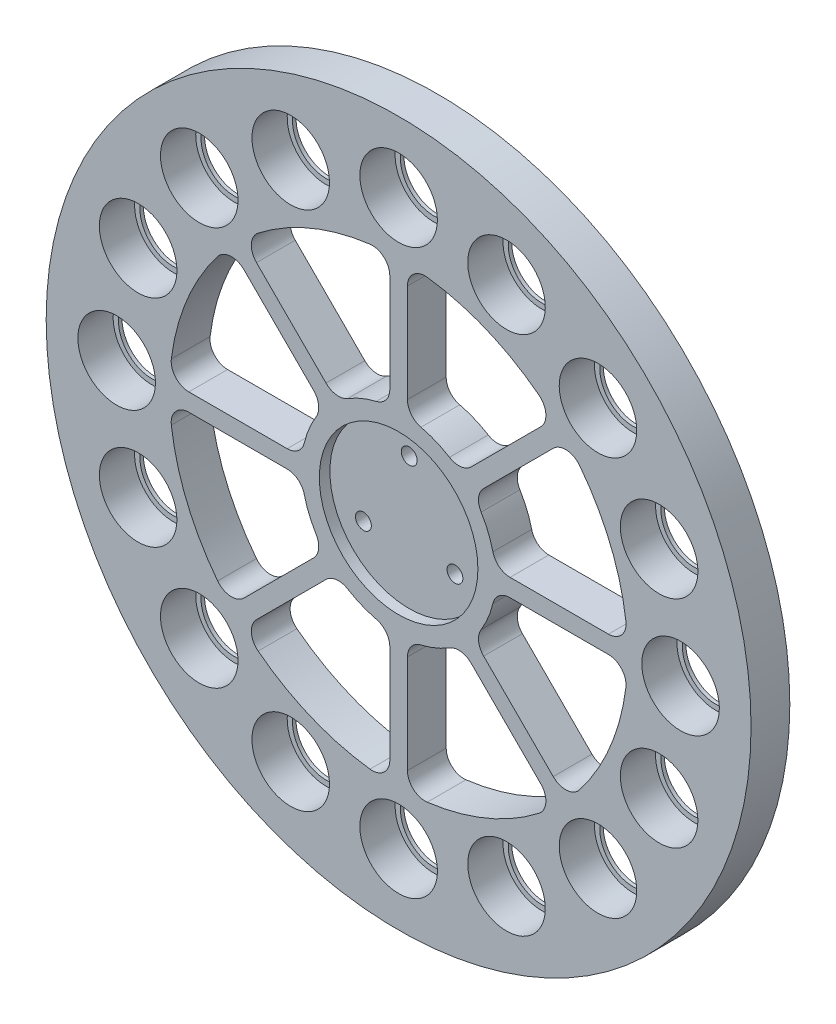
ISO-10303-21;
HEADER;
FILE_DESCRIPTION(('STEP AP214'),'2;1');
FILE_NAME('part.step','',(''),(''),'','','');
FILE_SCHEMA(('AUTOMOTIVE_DESIGN { 1 0 10303 214 1 1 1 1 }'));
ENDSEC;
DATA;
#1=APPLICATION_CONTEXT('core data for automotive mechanical design processes');
#2=APPLICATION_PROTOCOL_DEFINITION('international standard','automotive_design',2000,#1);
#3=PRODUCT_CONTEXT('',#1,'mechanical');
#4=PRODUCT('Part','Part','',(#3));
#5=PRODUCT_RELATED_PRODUCT_CATEGORY('part','',(#4));
#6=PRODUCT_DEFINITION_FORMATION('','',#4);
#7=PRODUCT_DEFINITION_CONTEXT('part definition',#1,'design');
#8=PRODUCT_DEFINITION('design','',#6,#7);
#9=PRODUCT_DEFINITION_SHAPE('','',#8);
#10=(LENGTH_UNIT() NAMED_UNIT(*) SI_UNIT(.MILLI.,.METRE.));
#11=(NAMED_UNIT(*) PLANE_ANGLE_UNIT() SI_UNIT($,.RADIAN.));
#12=(NAMED_UNIT(*) SI_UNIT($,.STERADIAN.) SOLID_ANGLE_UNIT());
#13=UNCERTAINTY_MEASURE_WITH_UNIT(LENGTH_MEASURE(1.E-05),#10,'distance_accuracy_value','');
#14=(GEOMETRIC_REPRESENTATION_CONTEXT(3) GLOBAL_UNCERTAINTY_ASSIGNED_CONTEXT((#13)) GLOBAL_UNIT_ASSIGNED_CONTEXT((#10,
#11,#12)) REPRESENTATION_CONTEXT('',''));
#15=CARTESIAN_POINT('',(0.,0.,0.));
#16=DIRECTION('',(0.,0.,1.));
#17=DIRECTION('',(1.,0.,0.));
#18=AXIS2_PLACEMENT_3D('',#15,#16,#17);
#19=CARTESIAN_POINT('',(0.,0.,0.));
#20=DIRECTION('',(0.,0.,1.));
#21=DIRECTION('',(1.,0.,0.));
#22=AXIS2_PLACEMENT_3D('',#19,#20,#21);
#23=PLANE('',#22);
#24=CARTESIAN_POINT('',(0.,0.,0.));
#25=DIRECTION('',(0.,0.,1.));
#26=DIRECTION('',(0.707106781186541,0.707106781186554,0.));
#27=AXIS2_PLACEMENT_3D('',#24,#25,#26);
#28=CIRCLE('',#27,65.);
#29=CARTESIAN_POINT('',(8.12500000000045,-64.4901882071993,0.));
#30=VERTEX_POINT('',#29);
#31=CARTESIAN_POINT('',(39.8562068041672,-51.3466919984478,0.));
#32=VERTEX_POINT('',#31);
#33=EDGE_CURVE('E1058',#30,#32,#28,.T.);
#34=ORIENTED_EDGE('',*,*,#33,.T.);
#35=CARTESIAN_POINT('',(36.7903447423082,-47.3969464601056,0.));
#36=DIRECTION('',(0.,0.,1.));
#37=DIRECTION('',(1.,0.,0.));
#38=AXIS2_PLACEMENT_3D('',#35,#36,#37);
#39=CIRCLE('',#38,5.);
#40=CARTESIAN_POINT('',(40.3258786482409,-43.8614125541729,0.));
#41=VERTEX_POINT('',#40);
#42=EDGE_CURVE('E918',#32,#41,#39,.T.);
#43=ORIENTED_EDGE('',*,*,#42,.T.);
#44=DIRECTION('',(-0.707106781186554,0.707106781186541,0.));
#45=VECTOR('',#44,1.);
#46=CARTESIAN_POINT('',(17.5971497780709,-21.1326836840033,0.));
#47=LINE('',#46,#45);
#48=CARTESIAN_POINT('',(20.5929128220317,-24.1284467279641,0.));
#49=VERTEX_POINT('',#48);
#50=EDGE_CURVE('E1043',#41,#49,#47,.T.);
#51=ORIENTED_EDGE('',*,*,#50,.T.);
#52=CARTESIAN_POINT('',(17.057378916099,-27.6639806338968,0.));
#53=DIRECTION('',(0.,0.,1.));
#54=DIRECTION('',(1.,0.,0.));
#55=AXIS2_PLACEMENT_3D('',#52,#53,#54);
#56=CIRCLE('',#55,5.);
#57=CARTESIAN_POINT('',(14.4331667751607,-23.4079836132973,0.));
#58=VERTEX_POINT('',#57);
#59=EDGE_CURVE('E906',#49,#58,#56,.T.);
#60=ORIENTED_EDGE('',*,*,#59,.T.);
#61=CARTESIAN_POINT('',(0.,0.,0.));
#62=DIRECTION('',(0.,0.,-1.));
#63=DIRECTION('',(0.707106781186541,0.707106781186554,0.));
#64=AXIS2_PLACEMENT_3D('',#61,#62,#63);
#65=CIRCLE('',#64,27.5);
#66=CARTESIAN_POINT('',(6.34615384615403,-26.7577340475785,0.));
#67=VERTEX_POINT('',#66);
#68=EDGE_CURVE('E1051',#58,#67,#65,.T.);
#69=ORIENTED_EDGE('',*,*,#68,.T.);
#70=CARTESIAN_POINT('',(7.50000000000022,-31.6227766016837,0.));
#71=DIRECTION('',(0.,0.,1.));
#72=DIRECTION('',(1.,0.,0.));
#73=AXIS2_PLACEMENT_3D('',#70,#71,#72);
#74=CIRCLE('',#73,5.);
#75=CARTESIAN_POINT('',(2.50000000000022,-31.6227766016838,0.));
#76=VERTEX_POINT('',#75);
#77=EDGE_CURVE('E910',#67,#76,#74,.T.);
#78=ORIENTED_EDGE('',*,*,#77,.T.);
#79=DIRECTION('',(0.,-1.,0.));
#80=VECTOR('',#79,1.);
#81=CARTESIAN_POINT('',(2.50000000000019,-27.3861278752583,0.));
#82=LINE('',#81,#80);
#83=CARTESIAN_POINT('',(2.50000000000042,-59.5294044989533,0.));
#84=VERTEX_POINT('',#83);
#85=EDGE_CURVE('E1054',#76,#84,#82,.T.);
#86=ORIENTED_EDGE('',*,*,#85,.T.);
#87=CARTESIAN_POINT('',(7.50000000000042,-59.5294044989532,0.));
#88=DIRECTION('',(0.,0.,1.));
#89=DIRECTION('',(1.,0.,0.));
#90=AXIS2_PLACEMENT_3D('',#87,#88,#89);
#91=CIRCLE('',#90,5.);
#92=EDGE_CURVE('E914',#84,#30,#91,.T.);
#93=ORIENTED_EDGE('',*,*,#92,.T.);
#94=EDGE_LOOP('',(#34,#43,#51,#60,#69,#78,#86,#93));
#95=FACE_BOUND('',#94,.T.);
#96=CARTESIAN_POINT('',(0.,0.,0.));
#97=DIRECTION('',(0.,0.,1.));
#98=DIRECTION('',(1.,0.,0.));
#99=AXIS2_PLACEMENT_3D('',#96,#97,#98);
#100=CIRCLE('',#99,65.);
#101=CARTESIAN_POINT('',(-39.8562068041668,-51.346691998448,0.));
#102=VERTEX_POINT('',#101);
#103=CARTESIAN_POINT('',(-8.125,-64.4901882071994,0.));
#104=VERTEX_POINT('',#103);
#105=EDGE_CURVE('E1032',#102,#104,#100,.T.);
#106=ORIENTED_EDGE('',*,*,#105,.T.);
#107=CARTESIAN_POINT('',(-7.5,-59.5294044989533,0.));
#108=DIRECTION('',(0.,0.,1.));
#109=DIRECTION('',(1.,0.,0.));
#110=AXIS2_PLACEMENT_3D('',#107,#108,#109);
#111=CIRCLE('',#110,5.);
#112=CARTESIAN_POINT('',(-2.5,-59.5294044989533,0.));
#113=VERTEX_POINT('',#112);
#114=EDGE_CURVE('E882',#104,#113,#111,.T.);
#115=ORIENTED_EDGE('',*,*,#114,.T.);
#116=DIRECTION('',(0.,1.,0.));
#117=VECTOR('',#116,1.);
#118=CARTESIAN_POINT('',(-2.5,-27.3861278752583,0.));
#119=LINE('',#118,#117);
#120=CARTESIAN_POINT('',(-2.5,-31.6227766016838,0.));
#121=VERTEX_POINT('',#120);
#122=EDGE_CURVE('E1035',#113,#121,#119,.T.);
#123=ORIENTED_EDGE('',*,*,#122,.T.);
#124=CARTESIAN_POINT('',(-7.5,-31.6227766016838,0.));
#125=DIRECTION('',(0.,0.,1.));
#126=DIRECTION('',(1.,0.,0.));
#127=AXIS2_PLACEMENT_3D('',#124,#125,#126);
#128=CIRCLE('',#127,5.);
#129=CARTESIAN_POINT('',(-6.34615384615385,-26.7577340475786,0.));
#130=VERTEX_POINT('',#129);
#131=EDGE_CURVE('E870',#121,#130,#128,.T.);
#132=ORIENTED_EDGE('',*,*,#131,.T.);
#133=CARTESIAN_POINT('',(0.,0.,0.));
#134=DIRECTION('',(0.,0.,-1.));
#135=DIRECTION('',(1.,0.,0.));
#136=AXIS2_PLACEMENT_3D('',#133,#134,#135);
#137=CIRCLE('',#136,27.5);
#138=CARTESIAN_POINT('',(-14.4331667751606,-23.4079836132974,0.));
#139=VERTEX_POINT('',#138);
#140=EDGE_CURVE('E1025',#130,#139,#137,.T.);
#141=ORIENTED_EDGE('',*,*,#140,.T.);
#142=CARTESIAN_POINT('',(-17.0573789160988,-27.663980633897,0.));
#143=DIRECTION('',(0.,0.,1.));
#144=DIRECTION('',(1.,0.,0.));
#145=AXIS2_PLACEMENT_3D('',#142,#143,#144);
#146=CIRCLE('',#145,5.);
#147=CARTESIAN_POINT('',(-20.5929128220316,-24.1284467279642,0.));
#148=VERTEX_POINT('',#147);
#149=EDGE_CURVE('E874',#139,#148,#146,.T.);
#150=ORIENTED_EDGE('',*,*,#149,.T.);
#151=DIRECTION('',(-0.707106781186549,-0.707106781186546,0.));
#152=VECTOR('',#151,1.);
#153=CARTESIAN_POINT('',(-17.5971497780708,-21.1326836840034,0.));
#154=LINE('',#153,#152);
#155=CARTESIAN_POINT('',(-40.3258786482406,-43.8614125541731,0.));
#156=VERTEX_POINT('',#155);
#157=EDGE_CURVE('E1028',#148,#156,#154,.T.);
#158=ORIENTED_EDGE('',*,*,#157,.T.);
#159=CARTESIAN_POINT('',(-36.7903447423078,-47.3969464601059,0.));
#160=DIRECTION('',(0.,0.,1.));
#161=DIRECTION('',(1.,0.,0.));
#162=AXIS2_PLACEMENT_3D('',#159,#160,#161);
#163=CIRCLE('',#162,5.);
#164=EDGE_CURVE('E878',#156,#102,#163,.T.);
#165=ORIENTED_EDGE('',*,*,#164,.T.);
#166=EDGE_LOOP('',(#106,#115,#123,#132,#141,#150,#158,#165));
#167=FACE_BOUND('',#166,.T.);
#168=CARTESIAN_POINT('',(0.,0.,0.));
#169=DIRECTION('',(0.,0.,1.));
#170=DIRECTION('',(0.707106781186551,-0.707106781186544,0.));
#171=AXIS2_PLACEMENT_3D('',#168,#169,#170);
#172=CIRCLE('',#171,65.);
#173=CARTESIAN_POINT('',(-64.4901882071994,-8.12500000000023,0.));
#174=VERTEX_POINT('',#173);
#175=CARTESIAN_POINT('',(-51.3466919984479,-39.856206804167,0.));
#176=VERTEX_POINT('',#175);
#177=EDGE_CURVE('E1108',#174,#176,#172,.T.);
#178=ORIENTED_EDGE('',*,*,#177,.T.);
#179=CARTESIAN_POINT('',(-47.3969464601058,-36.790344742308,0.));
#180=DIRECTION('',(0.,0.,1.));
#181=DIRECTION('',(1.,0.,0.));
#182=AXIS2_PLACEMENT_3D('',#179,#180,#181);
#183=CIRCLE('',#182,5.);
#184=CARTESIAN_POINT('',(-43.861412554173,-40.3258786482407,0.));
#185=VERTEX_POINT('',#184);
#186=EDGE_CURVE('E846',#176,#185,#183,.T.);
#187=ORIENTED_EDGE('',*,*,#186,.T.);
#188=DIRECTION('',(0.707106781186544,0.707106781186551,0.));
#189=VECTOR('',#188,1.);
#190=CARTESIAN_POINT('',(-21.1326836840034,-17.5971497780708,0.));
#191=LINE('',#190,#189);
#192=CARTESIAN_POINT('',(-24.1284467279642,-20.5929128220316,0.));
#193=VERTEX_POINT('',#192);
#194=EDGE_CURVE('E1093',#185,#193,#191,.T.);
#195=ORIENTED_EDGE('',*,*,#194,.T.);
#196=CARTESIAN_POINT('',(-27.6639806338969,-17.0573789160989,0.));
#197=DIRECTION('',(0.,0.,1.));
#198=DIRECTION('',(1.,0.,0.));
#199=AXIS2_PLACEMENT_3D('',#196,#197,#198);
#200=CIRCLE('',#199,5.);
#201=CARTESIAN_POINT('',(-23.4079836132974,-14.4331667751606,0.));
#202=VERTEX_POINT('',#201);
#203=EDGE_CURVE('E834',#193,#202,#200,.T.);
#204=ORIENTED_EDGE('',*,*,#203,.T.);
#205=CARTESIAN_POINT('',(0.,0.,0.));
#206=DIRECTION('',(0.,0.,-1.));
#207=DIRECTION('',(0.707106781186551,-0.707106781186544,0.));
#208=AXIS2_PLACEMENT_3D('',#205,#206,#207);
#209=CIRCLE('',#208,27.5);
#210=CARTESIAN_POINT('',(-26.7577340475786,-6.34615384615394,0.));
#211=VERTEX_POINT('',#210);
#212=EDGE_CURVE('E1101',#202,#211,#209,.T.);
#213=ORIENTED_EDGE('',*,*,#212,.T.);
#214=CARTESIAN_POINT('',(-31.6227766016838,-7.50000000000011,0.));
#215=DIRECTION('',(0.,0.,1.));
#216=DIRECTION('',(1.,0.,0.));
#217=AXIS2_PLACEMENT_3D('',#214,#215,#216);
#218=CIRCLE('',#217,5.);
#219=CARTESIAN_POINT('',(-31.6227766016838,-2.50000000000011,0.));
#220=VERTEX_POINT('',#219);
#221=EDGE_CURVE('E838',#211,#220,#218,.T.);
#222=ORIENTED_EDGE('',*,*,#221,.T.);
#223=DIRECTION('',(-1.,0.,0.));
#224=VECTOR('',#223,1.);
#225=CARTESIAN_POINT('',(-27.3861278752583,-2.5000000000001,0.));
#226=LINE('',#225,#224);
#227=CARTESIAN_POINT('',(-59.5294044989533,-2.50000000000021,0.));
#228=VERTEX_POINT('',#227);
#229=EDGE_CURVE('E1104',#220,#228,#226,.T.);
#230=ORIENTED_EDGE('',*,*,#229,.T.);
#231=CARTESIAN_POINT('',(-59.5294044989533,-7.50000000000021,0.));
#232=DIRECTION('',(0.,0.,1.));
#233=DIRECTION('',(1.,0.,0.));
#234=AXIS2_PLACEMENT_3D('',#231,#232,#233);
#235=CIRCLE('',#234,5.);
#236=EDGE_CURVE('E842',#228,#174,#235,.T.);
#237=ORIENTED_EDGE('',*,*,#236,.T.);
#238=EDGE_LOOP('',(#178,#187,#195,#204,#213,#222,#230,#237));
#239=FACE_BOUND('',#238,.T.);
#240=CARTESIAN_POINT('',(0.,0.,0.));
#241=DIRECTION('',(0.,0.,1.));
#242=DIRECTION('',(0.,-1.,0.));
#243=AXIS2_PLACEMENT_3D('',#240,#241,#242);
#244=CIRCLE('',#243,65.);
#245=CARTESIAN_POINT('',(-51.3466919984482,39.8562068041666,0.));
#246=VERTEX_POINT('',#245);
#247=CARTESIAN_POINT('',(-64.4901882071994,8.12499999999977,0.));
#248=VERTEX_POINT('',#247);
#249=EDGE_CURVE('E1082',#246,#248,#244,.T.);
#250=ORIENTED_EDGE('',*,*,#249,.T.);
#251=CARTESIAN_POINT('',(-59.5294044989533,7.49999999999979,0.));
#252=DIRECTION('',(0.,0.,1.));
#253=DIRECTION('',(1.,0.,0.));
#254=AXIS2_PLACEMENT_3D('',#251,#252,#253);
#255=CIRCLE('',#254,5.);
#256=CARTESIAN_POINT('',(-59.5294044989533,2.49999999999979,0.));
#257=VERTEX_POINT('',#256);
#258=EDGE_CURVE('E810',#248,#257,#255,.T.);
#259=ORIENTED_EDGE('',*,*,#258,.T.);
#260=DIRECTION('',(1.,0.,0.));
#261=VECTOR('',#260,1.);
#262=CARTESIAN_POINT('',(-27.3861278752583,2.4999999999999,0.));
#263=LINE('',#262,#261);
#264=CARTESIAN_POINT('',(-31.6227766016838,2.49999999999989,0.));
#265=VERTEX_POINT('',#264);
#266=EDGE_CURVE('E1085',#257,#265,#263,.T.);
#267=ORIENTED_EDGE('',*,*,#266,.T.);
#268=CARTESIAN_POINT('',(-31.6227766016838,7.49999999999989,0.));
#269=DIRECTION('',(0.,0.,1.));
#270=DIRECTION('',(1.,0.,0.));
#271=AXIS2_PLACEMENT_3D('',#268,#269,#270);
#272=CIRCLE('',#271,5.);
#273=CARTESIAN_POINT('',(-26.7577340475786,6.34615384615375,0.));
#274=VERTEX_POINT('',#273);
#275=EDGE_CURVE('E798',#265,#274,#272,.T.);
#276=ORIENTED_EDGE('',*,*,#275,.T.);
#277=CARTESIAN_POINT('',(0.,0.,0.));
#278=DIRECTION('',(0.,0.,-1.));
#279=DIRECTION('',(0.,-1.,0.));
#280=AXIS2_PLACEMENT_3D('',#277,#278,#279);
#281=CIRCLE('',#280,27.5);
#282=CARTESIAN_POINT('',(-23.4079836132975,14.4331667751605,0.));
#283=VERTEX_POINT('',#282);
#284=EDGE_CURVE('E1075',#274,#283,#281,.T.);
#285=ORIENTED_EDGE('',*,*,#284,.T.);
#286=CARTESIAN_POINT('',(-27.663980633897,17.0573789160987,0.));
#287=DIRECTION('',(0.,0.,1.));
#288=DIRECTION('',(1.,0.,0.));
#289=AXIS2_PLACEMENT_3D('',#286,#287,#288);
#290=CIRCLE('',#289,5.);
#291=CARTESIAN_POINT('',(-24.1284467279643,20.5929128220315,0.));
#292=VERTEX_POINT('',#291);
#293=EDGE_CURVE('E802',#283,#292,#290,.T.);
#294=ORIENTED_EDGE('',*,*,#293,.T.);
#295=DIRECTION('',(-0.707106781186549,0.707106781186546,0.));
#296=VECTOR('',#295,1.);
#297=CARTESIAN_POINT('',(-21.1326836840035,17.5971497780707,0.));
#298=LINE('',#297,#296);
#299=CARTESIAN_POINT('',(-43.8614125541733,40.3258786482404,0.));
#300=VERTEX_POINT('',#299);
#301=EDGE_CURVE('E1078',#292,#300,#298,.T.);
#302=ORIENTED_EDGE('',*,*,#301,.T.);
#303=CARTESIAN_POINT('',(-47.396946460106,36.7903447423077,0.));
#304=DIRECTION('',(0.,0.,1.));
#305=DIRECTION('',(1.,0.,0.));
#306=AXIS2_PLACEMENT_3D('',#303,#304,#305);
#307=CIRCLE('',#306,5.);
#308=EDGE_CURVE('E806',#300,#246,#307,.T.);
#309=ORIENTED_EDGE('',*,*,#308,.T.);
#310=EDGE_LOOP('',(#250,#259,#267,#276,#285,#294,#302,#309));
#311=FACE_BOUND('',#310,.T.);
#312=CARTESIAN_POINT('',(0.,0.,0.));
#313=DIRECTION('',(0.,0.,1.));
#314=DIRECTION('',(0.,1.,0.));
#315=AXIS2_PLACEMENT_3D('',#312,#313,#314);
#316=CIRCLE('',#315,65.);
#317=CARTESIAN_POINT('',(51.3466919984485,-39.8562068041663,0.));
#318=VERTEX_POINT('',#317);
#319=CARTESIAN_POINT('',(64.4901882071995,-8.12499999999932,0.));
#320=VERTEX_POINT('',#319);
#321=EDGE_CURVE('E2298',#318,#320,#316,.T.);
#322=ORIENTED_EDGE('',*,*,#321,.T.);
#323=CARTESIAN_POINT('',(59.5294044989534,-7.49999999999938,0.));
#324=DIRECTION('',(0.,0.,1.));
#325=DIRECTION('',(1.,0.,0.));
#326=AXIS2_PLACEMENT_3D('',#323,#324,#325);
#327=CIRCLE('',#326,5.);
#328=CARTESIAN_POINT('',(59.5294044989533,-2.49999999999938,0.));
#329=VERTEX_POINT('',#328);
#330=EDGE_CURVE('E954',#320,#329,#327,.T.);
#331=ORIENTED_EDGE('',*,*,#330,.T.);
#332=DIRECTION('',(-1.,0.,0.));
#333=VECTOR('',#332,1.);
#334=CARTESIAN_POINT('',(27.3861278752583,-2.49999999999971,0.));
#335=LINE('',#334,#333);
#336=CARTESIAN_POINT('',(31.6227766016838,-2.49999999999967,0.));
#337=VERTEX_POINT('',#336);
#338=EDGE_CURVE('E1067',#329,#337,#335,.T.);
#339=ORIENTED_EDGE('',*,*,#338,.T.);
#340=CARTESIAN_POINT('',(31.6227766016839,-7.49999999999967,0.));
#341=DIRECTION('',(0.,0.,1.));
#342=DIRECTION('',(1.,0.,0.));
#343=AXIS2_PLACEMENT_3D('',#340,#341,#342);
#344=CIRCLE('',#343,5.);
#345=CARTESIAN_POINT('',(26.7577340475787,-6.34615384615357,0.));
#346=VERTEX_POINT('',#345);
#347=EDGE_CURVE('E942',#337,#346,#344,.T.);
#348=ORIENTED_EDGE('',*,*,#347,.T.);
#349=CARTESIAN_POINT('',(0.,0.,0.));
#350=DIRECTION('',(0.,0.,-1.));
#351=DIRECTION('',(0.,1.,0.));
#352=AXIS2_PLACEMENT_3D('',#349,#350,#351);
#353=CIRCLE('',#352,27.5);
#354=CARTESIAN_POINT('',(23.4079836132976,-14.4331667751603,0.));
#355=VERTEX_POINT('',#354);
#356=EDGE_CURVE('E2290',#346,#355,#353,.T.);
#357=ORIENTED_EDGE('',*,*,#356,.T.);
#358=CARTESIAN_POINT('',(27.6639806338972,-17.0573789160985,0.));
#359=DIRECTION('',(0.,0.,1.));
#360=DIRECTION('',(1.,0.,0.));
#361=AXIS2_PLACEMENT_3D('',#358,#359,#360);
#362=CIRCLE('',#361,5.);
#363=CARTESIAN_POINT('',(24.1284467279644,-20.5929128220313,0.));
#364=VERTEX_POINT('',#363);
#365=EDGE_CURVE('E946',#355,#364,#362,.T.);
#366=ORIENTED_EDGE('',*,*,#365,.T.);
#367=DIRECTION('',(0.707106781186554,-0.707106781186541,0.));
#368=VECTOR('',#367,1.);
#369=CARTESIAN_POINT('',(21.1326836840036,-17.5971497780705,0.));
#370=LINE('',#369,#368);
#371=CARTESIAN_POINT('',(43.8614125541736,-40.3258786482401,0.));
#372=VERTEX_POINT('',#371);
#373=EDGE_CURVE('E2301',#364,#372,#370,.T.);
#374=ORIENTED_EDGE('',*,*,#373,.T.);
#375=CARTESIAN_POINT('',(47.3969464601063,-36.7903447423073,0.));
#376=DIRECTION('',(0.,0.,1.));
#377=DIRECTION('',(1.,0.,0.));
#378=AXIS2_PLACEMENT_3D('',#375,#376,#377);
#379=CIRCLE('',#378,5.);
#380=EDGE_CURVE('E950',#372,#318,#379,.T.);
#381=ORIENTED_EDGE('',*,*,#380,.T.);
#382=EDGE_LOOP('',(#322,#331,#339,#348,#357,#366,#374,#381));
#383=FACE_BOUND('',#382,.T.);
#384=CARTESIAN_POINT('',(0.,0.,0.));
#385=DIRECTION('',(0.,0.,1.));
#386=DIRECTION('',(-0.707106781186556,0.707106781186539,0.));
#387=AXIS2_PLACEMENT_3D('',#384,#385,#386);
#388=CIRCLE('',#387,65.);
#389=CARTESIAN_POINT('',(64.4901882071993,8.12500000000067,0.));
#390=VERTEX_POINT('',#389);
#391=CARTESIAN_POINT('',(51.3466919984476,39.8562068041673,0.));
#392=VERTEX_POINT('',#391);
#393=EDGE_CURVE('E1005',#390,#392,#388,.T.);
#394=ORIENTED_EDGE('',*,*,#393,.T.);
#395=CARTESIAN_POINT('',(47.3969464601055,36.7903447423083,0.));
#396=DIRECTION('',(0.,0.,1.));
#397=DIRECTION('',(1.,0.,0.));
#398=AXIS2_PLACEMENT_3D('',#395,#396,#397);
#399=CIRCLE('',#398,5.);
#400=CARTESIAN_POINT('',(43.8614125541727,40.325878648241,0.));
#401=VERTEX_POINT('',#400);
#402=EDGE_CURVE('E11',#392,#401,#399,.T.);
#403=ORIENTED_EDGE('',*,*,#402,.T.);
#404=DIRECTION('',(-0.707106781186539,-0.707106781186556,0.));
#405=VECTOR('',#404,1.);
#406=CARTESIAN_POINT('',(21.1326836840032,17.597149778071,0.));
#407=LINE('',#406,#405);
#408=CARTESIAN_POINT('',(24.128446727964,20.5929128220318,0.));
#409=VERTEX_POINT('',#408);
#410=EDGE_CURVE('E1003',#401,#409,#407,.T.);
#411=ORIENTED_EDGE('',*,*,#410,.T.);
#412=CARTESIAN_POINT('',(27.6639806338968,17.0573789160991,0.));
#413=DIRECTION('',(0.,0.,1.));
#414=DIRECTION('',(1.,0.,0.));
#415=AXIS2_PLACEMENT_3D('',#412,#413,#414);
#416=CIRCLE('',#415,5.);
#417=CARTESIAN_POINT('',(23.4079836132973,14.4331667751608,0.));
#418=VERTEX_POINT('',#417);
#419=EDGE_CURVE('E977',#409,#418,#416,.T.);
#420=ORIENTED_EDGE('',*,*,#419,.T.);
#421=CARTESIAN_POINT('',(0.,0.,0.));
#422=DIRECTION('',(0.,0.,-1.));
#423=DIRECTION('',(-0.707106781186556,0.707106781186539,0.));
#424=AXIS2_PLACEMENT_3D('',#421,#422,#423);
#425=CIRCLE('',#424,27.5);
#426=CARTESIAN_POINT('',(26.7577340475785,6.34615384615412,0.));
#427=VERTEX_POINT('',#426);
#428=EDGE_CURVE('E1024',#418,#427,#425,.T.);
#429=ORIENTED_EDGE('',*,*,#428,.T.);
#430=CARTESIAN_POINT('',(31.6227766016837,7.50000000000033,0.));
#431=DIRECTION('',(0.,0.,1.));
#432=DIRECTION('',(1.,0.,0.));
#433=AXIS2_PLACEMENT_3D('',#430,#431,#432);
#434=CIRCLE('',#433,5.);
#435=CARTESIAN_POINT('',(31.6227766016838,2.50000000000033,0.));
#436=VERTEX_POINT('',#435);
#437=EDGE_CURVE('E981',#427,#436,#434,.T.);
#438=ORIENTED_EDGE('',*,*,#437,.T.);
#439=DIRECTION('',(1.,0.,0.));
#440=VECTOR('',#439,1.);
#441=CARTESIAN_POINT('',(27.3861278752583,2.50000000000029,0.));
#442=LINE('',#441,#440);
#443=CARTESIAN_POINT('',(59.5294044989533,2.50000000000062,0.));
#444=VERTEX_POINT('',#443);
#445=EDGE_CURVE('E1014',#436,#444,#442,.T.);
#446=ORIENTED_EDGE('',*,*,#445,.T.);
#447=CARTESIAN_POINT('',(59.5294044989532,7.50000000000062,0.));
#448=DIRECTION('',(0.,0.,1.));
#449=DIRECTION('',(1.,0.,0.));
#450=AXIS2_PLACEMENT_3D('',#447,#448,#449);
#451=CIRCLE('',#450,5.);
#452=EDGE_CURVE('E59',#444,#390,#451,.T.);
#453=ORIENTED_EDGE('',*,*,#452,.T.);
#454=EDGE_LOOP('',(#394,#403,#411,#420,#429,#438,#446,#453));
#455=FACE_BOUND('',#454,.T.);
#456=CARTESIAN_POINT('',(0.,0.,0.));
#457=DIRECTION('',(0.,0.,1.));
#458=DIRECTION('',(-0.707106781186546,-0.707106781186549,0.));
#459=AXIS2_PLACEMENT_3D('',#456,#457,#458);
#460=CIRCLE('',#459,65.);
#461=CARTESIAN_POINT('',(-8.125,64.4901882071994,0.));
#462=VERTEX_POINT('',#461);
#463=CARTESIAN_POINT('',(-39.8562068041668,51.346691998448,0.));
#464=VERTEX_POINT('',#463);
#465=EDGE_CURVE('E474',#462,#464,#460,.T.);
#466=ORIENTED_EDGE('',*,*,#465,.T.);
#467=CARTESIAN_POINT('',(-36.7903447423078,47.3969464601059,0.));
#468=DIRECTION('',(0.,0.,1.));
#469=DIRECTION('',(1.,0.,0.));
#470=AXIS2_PLACEMENT_3D('',#467,#468,#469);
#471=CIRCLE('',#470,5.);
#472=CARTESIAN_POINT('',(-40.3258786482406,43.8614125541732,0.));
#473=VERTEX_POINT('',#472);
#474=EDGE_CURVE('E774',#464,#473,#471,.T.);
#475=ORIENTED_EDGE('',*,*,#474,.T.);
#476=DIRECTION('',(0.707106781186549,-0.707106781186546,0.));
#477=VECTOR('',#476,1.);
#478=CARTESIAN_POINT('',(-17.5971497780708,21.1326836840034,0.));
#479=LINE('',#478,#477);
#480=CARTESIAN_POINT('',(-20.5929128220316,24.1284467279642,0.));
#481=VERTEX_POINT('',#480);
#482=EDGE_CURVE('E468',#473,#481,#479,.T.);
#483=ORIENTED_EDGE('',*,*,#482,.T.);
#484=CARTESIAN_POINT('',(-17.0573789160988,27.663980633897,0.));
#485=DIRECTION('',(0.,0.,1.));
#486=DIRECTION('',(1.,0.,0.));
#487=AXIS2_PLACEMENT_3D('',#484,#485,#486);
#488=CIRCLE('',#487,5.);
#489=CARTESIAN_POINT('',(-14.4331667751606,23.4079836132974,0.));
#490=VERTEX_POINT('',#489);
#491=EDGE_CURVE('E762',#481,#490,#488,.T.);
#492=ORIENTED_EDGE('',*,*,#491,.T.);
#493=CARTESIAN_POINT('',(0.,0.,0.));
#494=DIRECTION('',(0.,0.,-1.));
#495=DIRECTION('',(-0.707106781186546,-0.707106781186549,0.));
#496=AXIS2_PLACEMENT_3D('',#493,#494,#495);
#497=CIRCLE('',#496,27.5);
#498=CARTESIAN_POINT('',(-6.34615384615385,26.7577340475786,0.));
#499=VERTEX_POINT('',#498);
#500=EDGE_CURVE('E1123',#490,#499,#497,.T.);
#501=ORIENTED_EDGE('',*,*,#500,.T.);
#502=CARTESIAN_POINT('',(-7.5,31.6227766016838,0.));
#503=DIRECTION('',(0.,0.,1.));
#504=DIRECTION('',(1.,0.,0.));
#505=AXIS2_PLACEMENT_3D('',#502,#503,#504);
#506=CIRCLE('',#505,5.);
#507=CARTESIAN_POINT('',(-2.5,31.6227766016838,0.));
#508=VERTEX_POINT('',#507);
#509=EDGE_CURVE('E766',#499,#508,#506,.T.);
#510=ORIENTED_EDGE('',*,*,#509,.T.);
#511=DIRECTION('',(0.,1.,0.));
#512=VECTOR('',#511,1.);
#513=CARTESIAN_POINT('',(-2.5,27.3861278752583,0.));
#514=LINE('',#513,#512);
#515=CARTESIAN_POINT('',(-2.5,59.5294044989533,0.));
#516=VERTEX_POINT('',#515);
#517=EDGE_CURVE('E1126',#508,#516,#514,.T.);
#518=ORIENTED_EDGE('',*,*,#517,.T.);
#519=CARTESIAN_POINT('',(-7.5,59.5294044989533,0.));
#520=DIRECTION('',(0.,0.,1.));
#521=DIRECTION('',(1.,0.,0.));
#522=AXIS2_PLACEMENT_3D('',#519,#520,#521);
#523=CIRCLE('',#522,5.);
#524=EDGE_CURVE('E770',#516,#462,#523,.T.);
#525=ORIENTED_EDGE('',*,*,#524,.T.);
#526=EDGE_LOOP('',(#466,#475,#483,#492,#501,#510,#518,#525));
#527=FACE_BOUND('',#526,.T.);
#528=CARTESIAN_POINT('',(0.,0.,0.));
#529=DIRECTION('',(0.,0.,1.));
#530=DIRECTION('',(-1.,0.,0.));
#531=AXIS2_PLACEMENT_3D('',#528,#529,#530);
#532=CIRCLE('',#531,65.);
#533=CARTESIAN_POINT('',(39.8562068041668,51.346691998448,0.));
#534=VERTEX_POINT('',#533);
#535=CARTESIAN_POINT('',(8.125,64.4901882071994,0.));
#536=VERTEX_POINT('',#535);
#537=EDGE_CURVE('E1145',#534,#536,#532,.T.);
#538=ORIENTED_EDGE('',*,*,#537,.T.);
#539=CARTESIAN_POINT('',(7.5,59.5294044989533,0.));
#540=DIRECTION('',(0.,0.,1.));
#541=DIRECTION('',(1.,0.,0.));
#542=AXIS2_PLACEMENT_3D('',#539,#540,#541);
#543=CIRCLE('',#542,5.);
#544=CARTESIAN_POINT('',(2.5,59.5294044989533,0.));
#545=VERTEX_POINT('',#544);
#546=EDGE_CURVE('E738',#536,#545,#543,.T.);
#547=ORIENTED_EDGE('',*,*,#546,.T.);
#548=DIRECTION('',(0.,-1.,0.));
#549=VECTOR('',#548,1.);
#550=CARTESIAN_POINT('',(2.5,27.3861278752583,0.));
#551=LINE('',#550,#549);
#552=CARTESIAN_POINT('',(2.5,31.6227766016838,0.));
#553=VERTEX_POINT('',#552);
#554=EDGE_CURVE('E477',#545,#553,#551,.T.);
#555=ORIENTED_EDGE('',*,*,#554,.T.);
#556=CARTESIAN_POINT('',(7.5,31.6227766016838,0.));
#557=DIRECTION('',(0.,0.,1.));
#558=DIRECTION('',(1.,0.,0.));
#559=AXIS2_PLACEMENT_3D('',#556,#557,#558);
#560=CIRCLE('',#559,5.);
#561=CARTESIAN_POINT('',(6.34615384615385,26.7577340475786,0.));
#562=VERTEX_POINT('',#561);
#563=EDGE_CURVE('E449',#553,#562,#560,.T.);
#564=ORIENTED_EDGE('',*,*,#563,.T.);
#565=CARTESIAN_POINT('',(0.,0.,0.));
#566=DIRECTION('',(0.,0.,-1.));
#567=DIRECTION('',(-1.,0.,0.));
#568=AXIS2_PLACEMENT_3D('',#565,#566,#567);
#569=CIRCLE('',#568,27.5);
#570=CARTESIAN_POINT('',(14.4331667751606,23.4079836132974,0.));
#571=VERTEX_POINT('',#570);
#572=EDGE_CURVE('E459',#562,#571,#569,.T.);
#573=ORIENTED_EDGE('',*,*,#572,.T.);
#574=CARTESIAN_POINT('',(17.0573789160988,27.663980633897,0.));
#575=DIRECTION('',(0.,0.,1.));
#576=DIRECTION('',(1.,0.,0.));
#577=AXIS2_PLACEMENT_3D('',#574,#575,#576);
#578=CIRCLE('',#577,5.);
#579=CARTESIAN_POINT('',(20.5929128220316,24.1284467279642,0.));
#580=VERTEX_POINT('',#579);
#581=EDGE_CURVE('E730',#571,#580,#578,.T.);
#582=ORIENTED_EDGE('',*,*,#581,.T.);
#583=DIRECTION('',(0.707106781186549,0.707106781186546,0.));
#584=VECTOR('',#583,1.);
#585=CARTESIAN_POINT('',(17.5971497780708,21.1326836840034,0.));
#586=LINE('',#585,#584);
#587=CARTESIAN_POINT('',(40.3258786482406,43.8614125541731,0.));
#588=VERTEX_POINT('',#587);
#589=EDGE_CURVE('E1143',#580,#588,#586,.T.);
#590=ORIENTED_EDGE('',*,*,#589,.T.);
#591=CARTESIAN_POINT('',(36.7903447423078,47.3969464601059,0.));
#592=DIRECTION('',(0.,0.,1.));
#593=DIRECTION('',(1.,0.,0.));
#594=AXIS2_PLACEMENT_3D('',#591,#592,#593);
#595=CIRCLE('',#594,5.);
#596=EDGE_CURVE('E734',#588,#534,#595,.T.);
#597=ORIENTED_EDGE('',*,*,#596,.T.);
#598=EDGE_LOOP('',(#538,#547,#555,#564,#573,#582,#590,#597));
#599=FACE_BOUND('',#598,.T.);
#600=CARTESIAN_POINT('',(-12.9903810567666,-7.49999999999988,0.));
#601=DIRECTION('',(0.,0.,-1.));
#602=DIRECTION('',(-1.,0.,0.));
#603=AXIS2_PLACEMENT_3D('',#600,#601,#602);
#604=CIRCLE('',#603,4.7);
#605=CARTESIAN_POINT('',(-17.6903810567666,-7.49999999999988,0.));
#606=VERTEX_POINT('',#605);
#607=EDGE_CURVE('E484',#606,#606,#604,.T.);
#608=ORIENTED_EDGE('',*,*,#607,.F.);
#609=EDGE_LOOP('',(#608));
#610=FACE_BOUND('',#609,.T.);
#611=CARTESIAN_POINT('',(0.,15.,0.));
#612=DIRECTION('',(0.,0.,-1.));
#613=DIRECTION('',(-1.,0.,0.));
#614=AXIS2_PLACEMENT_3D('',#611,#612,#613);
#615=CIRCLE('',#614,4.7);
#616=CARTESIAN_POINT('',(-4.7,15.,0.));
#617=VERTEX_POINT('',#616);
#618=EDGE_CURVE('E505',#617,#617,#615,.T.);
#619=ORIENTED_EDGE('',*,*,#618,.F.);
#620=EDGE_LOOP('',(#619));
#621=FACE_BOUND('',#620,.T.);
#622=CARTESIAN_POINT('',(-56.5685424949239,56.5685424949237,0.));
#623=DIRECTION('',(0.,0.,1.));
#624=DIRECTION('',(0.707106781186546,0.707106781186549,0.));
#625=AXIS2_PLACEMENT_3D('',#622,#623,#624);
#626=CIRCLE('',#625,9.5);
#627=CARTESIAN_POINT('',(-49.8510280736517,63.2860569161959,0.));
#628=VERTEX_POINT('',#627);
#629=EDGE_CURVE('E530',#628,#628,#626,.T.);
#630=ORIENTED_EDGE('',*,*,#629,.T.);
#631=EDGE_LOOP('',(#630));
#632=FACE_BOUND('',#631,.T.);
#633=CARTESIAN_POINT('',(-73.910362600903,30.614674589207,0.));
#634=DIRECTION('',(0.,0.,1.));
#635=DIRECTION('',(0.382683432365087,0.923879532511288,0.));
#636=AXIS2_PLACEMENT_3D('',#633,#634,#635);
#637=CIRCLE('',#636,9.5);
#638=CARTESIAN_POINT('',(-70.2748699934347,39.3915301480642,0.));
#639=VERTEX_POINT('',#638);
#640=EDGE_CURVE('E534',#639,#639,#637,.T.);
#641=ORIENTED_EDGE('',*,*,#640,.T.);
#642=EDGE_LOOP('',(#641));
#643=FACE_BOUND('',#642,.T.);
#644=CARTESIAN_POINT('',(-80.,-2.81767800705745E-13,0.));
#645=DIRECTION('',(0.,0.,1.));
#646=DIRECTION('',(0.,1.,0.));
#647=AXIS2_PLACEMENT_3D('',#644,#645,#646);
#648=CIRCLE('',#647,9.5);
#649=CARTESIAN_POINT('',(-80.,9.49999999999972,0.));
#650=VERTEX_POINT('',#649);
#651=EDGE_CURVE('E537',#650,#650,#648,.T.);
#652=ORIENTED_EDGE('',*,*,#651,.T.);
#653=EDGE_LOOP('',(#652));
#654=FACE_BOUND('',#653,.T.);
#655=CARTESIAN_POINT('',(-73.9103626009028,-30.6146745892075,0.));
#656=DIRECTION('',(0.,0.,1.));
#657=DIRECTION('',(-0.382683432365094,0.923879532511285,0.));
#658=AXIS2_PLACEMENT_3D('',#655,#656,#657);
#659=CIRCLE('',#658,9.5);
#660=CARTESIAN_POINT('',(-77.5458552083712,-21.8378190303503,0.));
#661=VERTEX_POINT('',#660);
#662=EDGE_CURVE('E540',#661,#661,#659,.T.);
#663=ORIENTED_EDGE('',*,*,#662,.T.);
#664=EDGE_LOOP('',(#663));
#665=FACE_BOUND('',#664,.T.);
#666=CARTESIAN_POINT('',(-56.5685424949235,-56.5685424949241,0.));
#667=DIRECTION('',(0.,0.,1.));
#668=DIRECTION('',(-0.707106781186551,0.707106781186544,0.));
#669=AXIS2_PLACEMENT_3D('',#666,#667,#668);
#670=CIRCLE('',#669,9.5);
#671=CARTESIAN_POINT('',(-63.2860569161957,-49.8510280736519,0.));
#672=VERTEX_POINT('',#671);
#673=EDGE_CURVE('E543',#672,#672,#670,.T.);
#674=ORIENTED_EDGE('',*,*,#673,.T.);
#675=EDGE_LOOP('',(#674));
#676=FACE_BOUND('',#675,.T.);
#677=CARTESIAN_POINT('',(-30.6146745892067,-73.9103626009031,0.));
#678=DIRECTION('',(0.,0.,1.));
#679=DIRECTION('',(-0.923879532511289,0.382683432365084,0.));
#680=AXIS2_PLACEMENT_3D('',#677,#678,#679);
#681=CIRCLE('',#680,9.5);
#682=CARTESIAN_POINT('',(-39.391530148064,-70.2748699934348,0.));
#683=VERTEX_POINT('',#682);
#684=EDGE_CURVE('E546',#683,#683,#681,.T.);
#685=ORIENTED_EDGE('',*,*,#684,.T.);
#686=EDGE_LOOP('',(#685));
#687=FACE_BOUND('',#686,.T.);
#688=CARTESIAN_POINT('',(0.,-80.,0.));
#689=DIRECTION('',(0.,0.,1.));
#690=DIRECTION('',(-1.,0.,0.));
#691=AXIS2_PLACEMENT_3D('',#688,#689,#690);
#692=CIRCLE('',#691,9.5);
#693=CARTESIAN_POINT('',(-9.49999999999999,-80.,0.));
#694=VERTEX_POINT('',#693);
#695=EDGE_CURVE('E549',#694,#694,#692,.T.);
#696=ORIENTED_EDGE('',*,*,#695,.T.);
#697=EDGE_LOOP('',(#696));
#698=FACE_BOUND('',#697,.T.);
#699=CARTESIAN_POINT('',(30.6146745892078,-73.9103626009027,0.));
#700=DIRECTION('',(0.,0.,1.));
#701=DIRECTION('',(-0.923879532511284,-0.382683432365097,0.));
#702=AXIS2_PLACEMENT_3D('',#699,#700,#701);
#703=CIRCLE('',#702,9.5);
#704=CARTESIAN_POINT('',(21.8378190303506,-77.5458552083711,0.));
#705=VERTEX_POINT('',#704);
#706=EDGE_CURVE('E515',#705,#705,#703,.T.);
#707=ORIENTED_EDGE('',*,*,#706,.T.);
#708=EDGE_LOOP('',(#707));
#709=FACE_BOUND('',#708,.T.);
#710=CARTESIAN_POINT('',(56.5685424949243,-56.5685424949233,0.));
#711=DIRECTION('',(0.,0.,1.));
#712=DIRECTION('',(-0.707106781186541,-0.707106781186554,0.));
#713=AXIS2_PLACEMENT_3D('',#710,#711,#712);
#714=CIRCLE('',#713,9.5);
#715=CARTESIAN_POINT('',(49.8510280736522,-63.2860569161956,0.));
#716=VERTEX_POINT('',#715);
#717=EDGE_CURVE('E512',#716,#716,#714,.T.);
#718=ORIENTED_EDGE('',*,*,#717,.T.);
#719=EDGE_LOOP('',(#718));
#720=FACE_BOUND('',#719,.T.);
#721=CARTESIAN_POINT('',(73.9103626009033,-30.6146745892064,0.));
#722=DIRECTION('',(0.,0.,1.));
#723=DIRECTION('',(-0.382683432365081,-0.923879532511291,0.));
#724=AXIS2_PLACEMENT_3D('',#721,#722,#723);
#725=CIRCLE('',#724,9.5);
#726=CARTESIAN_POINT('',(70.274869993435,-39.3915301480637,0.));
#727=VERTEX_POINT('',#726);
#728=EDGE_CURVE('E516',#727,#727,#725,.T.);
#729=ORIENTED_EDGE('',*,*,#728,.T.);
#730=EDGE_LOOP('',(#729));
#731=FACE_BOUND('',#730,.T.);
#732=CARTESIAN_POINT('',(80.,8.40404814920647E-13,0.));
#733=DIRECTION('',(0.,0.,1.));
#734=DIRECTION('',(0.,-1.,0.));
#735=AXIS2_PLACEMENT_3D('',#732,#733,#734);
#736=CIRCLE('',#735,9.5);
#737=CARTESIAN_POINT('',(80.0000000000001,-9.49999999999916,0.));
#738=VERTEX_POINT('',#737);
#739=EDGE_CURVE('E519',#738,#738,#736,.T.);
#740=ORIENTED_EDGE('',*,*,#739,.T.);
#741=EDGE_LOOP('',(#740));
#742=FACE_BOUND('',#741,.T.);
#743=CARTESIAN_POINT('',(73.9103626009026,30.614674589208,0.));
#744=DIRECTION('',(0.,0.,1.));
#745=DIRECTION('',(0.3826834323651,-0.923879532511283,0.));
#746=AXIS2_PLACEMENT_3D('',#743,#744,#745);
#747=CIRCLE('',#746,9.5);
#748=CARTESIAN_POINT('',(77.5458552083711,21.8378190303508,0.));
#749=VERTEX_POINT('',#748);
#750=EDGE_CURVE('E522',#749,#749,#747,.T.);
#751=ORIENTED_EDGE('',*,*,#750,.T.);
#752=EDGE_LOOP('',(#751));
#753=FACE_BOUND('',#752,.T.);
#754=CARTESIAN_POINT('',(56.5685424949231,56.5685424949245,0.));
#755=DIRECTION('',(0.,0.,1.));
#756=DIRECTION('',(0.707106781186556,-0.707106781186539,0.));
#757=AXIS2_PLACEMENT_3D('',#754,#755,#756);
#758=CIRCLE('',#757,9.5);
#759=CARTESIAN_POINT('',(63.2860569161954,49.8510280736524,0.));
#760=VERTEX_POINT('',#759);
#761=EDGE_CURVE('E525',#760,#760,#758,.T.);
#762=ORIENTED_EDGE('',*,*,#761,.T.);
#763=EDGE_LOOP('',(#762));
#764=FACE_BOUND('',#763,.T.);
#765=CARTESIAN_POINT('',(30.6146745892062,73.9103626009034,0.));
#766=DIRECTION('',(0.,0.,1.));
#767=DIRECTION('',(0.923879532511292,-0.382683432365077,0.));
#768=AXIS2_PLACEMENT_3D('',#765,#766,#767);
#769=CIRCLE('',#768,9.5);
#770=CARTESIAN_POINT('',(39.3915301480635,70.2748699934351,0.));
#771=VERTEX_POINT('',#770);
#772=EDGE_CURVE('E511',#771,#771,#769,.T.);
#773=ORIENTED_EDGE('',*,*,#772,.T.);
#774=EDGE_LOOP('',(#773));
#775=FACE_BOUND('',#774,.T.);
#776=CARTESIAN_POINT('',(-30.6146745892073,73.9103626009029,0.));
#777=DIRECTION('',(0.,0.,1.));
#778=DIRECTION('',(0.923879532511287,0.382683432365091,0.));
#779=AXIS2_PLACEMENT_3D('',#776,#777,#778);
#780=CIRCLE('',#779,9.5);
#781=CARTESIAN_POINT('',(-21.83781903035,77.5458552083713,0.));
#782=VERTEX_POINT('',#781);
#783=EDGE_CURVE('E533',#782,#782,#780,.T.);
#784=ORIENTED_EDGE('',*,*,#783,.T.);
#785=EDGE_LOOP('',(#784));
#786=FACE_BOUND('',#785,.T.);
#787=CARTESIAN_POINT('',(0.,80.,0.));
#788=DIRECTION('',(0.,0.,1.));
#789=DIRECTION('',(1.,0.,0.));
#790=AXIS2_PLACEMENT_3D('',#787,#788,#789);
#791=CIRCLE('',#790,9.5);
#792=CARTESIAN_POINT('',(9.49999999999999,80.,0.));
#793=VERTEX_POINT('',#792);
#794=EDGE_CURVE('E557',#793,#793,#791,.T.);
#795=ORIENTED_EDGE('',*,*,#794,.T.);
#796=EDGE_LOOP('',(#795));
#797=FACE_BOUND('',#796,.T.);
#798=CARTESIAN_POINT('',(0.,0.,0.));
#799=DIRECTION('',(0.,0.,1.));
#800=DIRECTION('',(1.,0.,0.));
#801=AXIS2_PLACEMENT_3D('',#798,#799,#800);
#802=CIRCLE('',#801,100.);
#803=CARTESIAN_POINT('',(100.,0.,0.));
#804=VERTEX_POINT('',#803);
#805=EDGE_CURVE('E656',#804,#804,#802,.T.);
#806=ORIENTED_EDGE('',*,*,#805,.F.);
#807=EDGE_LOOP('',(#806));
#808=FACE_BOUND('',#807,.T.);
#809=CARTESIAN_POINT('',(12.9903810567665,-7.50000000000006,0.));
#810=DIRECTION('',(0.,0.,-1.));
#811=DIRECTION('',(-1.,0.,0.));
#812=AXIS2_PLACEMENT_3D('',#809,#810,#811);
#813=CIRCLE('',#812,4.7);
#814=CARTESIAN_POINT('',(8.29038105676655,-7.50000000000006,0.));
#815=VERTEX_POINT('',#814);
#816=EDGE_CURVE('E491',#815,#815,#813,.T.);
#817=ORIENTED_EDGE('',*,*,#816,.F.);
#818=EDGE_LOOP('',(#817));
#819=FACE_BOUND('',#818,.T.);
#820=ADVANCED_FACE('F37',(#95,#167,#239,#311,#383,#455,#527,#599,#610,#621,#632,#643,#654,#665,
#676,#687,#698,#709,#720,#731,#742,#753,#764,#775,#786,#797,#808,#819),#23,.F.);
#821=CARTESIAN_POINT('',(0.,15.,0.));
#822=DIRECTION('',(0.,0.,-1.));
#823=DIRECTION('',(-1.,0.,0.));
#824=AXIS2_PLACEMENT_3D('',#821,#822,#823);
#825=CYLINDRICAL_SURFACE('',#824,2.25);
#826=CARTESIAN_POINT('',(0.,15.,2.45));
#827=DIRECTION('',(0.,0.,-1.));
#828=DIRECTION('',(-1.,0.,0.));
#829=AXIS2_PLACEMENT_3D('',#826,#827,#828);
#830=CIRCLE('',#829,2.25);
#831=CARTESIAN_POINT('',(-2.25,15.,2.45));
#832=VERTEX_POINT('',#831);
#833=EDGE_CURVE('E508',#832,#832,#830,.T.);
#834=ORIENTED_EDGE('',*,*,#833,.T.);
#835=EDGE_LOOP('',(#834));
#836=FACE_BOUND('',#835,.T.);
#837=CARTESIAN_POINT('',(0.,15.,8.));
#838=DIRECTION('',(0.,0.,1.));
#839=DIRECTION('',(1.,0.,0.));
#840=AXIS2_PLACEMENT_3D('',#837,#838,#839);
#841=CIRCLE('',#840,2.25);
#842=CARTESIAN_POINT('',(2.25,15.,8.));
#843=VERTEX_POINT('',#842);
#844=EDGE_CURVE('E501',#843,#843,#841,.F.);
#845=ORIENTED_EDGE('',*,*,#844,.F.);
#846=EDGE_LOOP('',(#845));
#847=FACE_BOUND('',#846,.T.);
#848=ADVANCED_FACE('F1183',(#836,#847),#825,.F.);
#849=CARTESIAN_POINT('',(0.,0.,11.));
#850=DIRECTION('',(0.,0.,-1.));
#851=DIRECTION('',(-1.,0.,0.));
#852=AXIS2_PLACEMENT_3D('',#849,#850,#851);
#853=CYLINDRICAL_SURFACE('',#852,100.);
#854=CARTESIAN_POINT('',(0.,0.,11.));
#855=DIRECTION('',(0.,0.,1.));
#856=DIRECTION('',(1.,0.,0.));
#857=AXIS2_PLACEMENT_3D('',#854,#855,#856);
#858=CIRCLE('',#857,100.);
#859=CARTESIAN_POINT('',(100.,0.,11.));
#860=VERTEX_POINT('',#859);
#861=EDGE_CURVE('E659',#860,#860,#858,.T.);
#862=ORIENTED_EDGE('',*,*,#861,.F.);
#863=EDGE_LOOP('',(#862));
#864=FACE_BOUND('',#863,.T.);
#865=ORIENTED_EDGE('',*,*,#805,.T.);
#866=EDGE_LOOP('',(#865));
#867=FACE_BOUND('',#866,.T.);
#868=ADVANCED_FACE('F1191',(#864,#867),#853,.T.);
#869=CARTESIAN_POINT('',(0.,0.,11.));
#870=DIRECTION('',(0.,0.,1.));
#871=DIRECTION('',(1.,0.,0.));
#872=AXIS2_PLACEMENT_3D('',#869,#870,#871);
#873=PLANE('',#872);
#874=CARTESIAN_POINT('',(0.,0.,11.));
#875=DIRECTION('',(0.,0.,-1.));
#876=DIRECTION('',(0.707106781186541,0.707106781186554,0.));
#877=AXIS2_PLACEMENT_3D('',#874,#875,#876);
#878=CIRCLE('',#877,27.5);
#879=CARTESIAN_POINT('',(14.4331667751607,-23.4079836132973,11.));
#880=VERTEX_POINT('',#879);
#881=CARTESIAN_POINT('',(6.34615384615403,-26.7577340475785,11.));
#882=VERTEX_POINT('',#881);
#883=EDGE_CURVE('E1063',#880,#882,#878,.T.);
#884=ORIENTED_EDGE('',*,*,#883,.F.);
#885=CARTESIAN_POINT('',(17.057378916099,-27.6639806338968,11.));
#886=DIRECTION('',(0.,0.,1.));
#887=DIRECTION('',(1.,0.,0.));
#888=AXIS2_PLACEMENT_3D('',#885,#886,#887);
#889=CIRCLE('',#888,5.);
#890=CARTESIAN_POINT('',(20.5929128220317,-24.1284467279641,11.));
#891=VERTEX_POINT('',#890);
#892=EDGE_CURVE('E904',#880,#891,#889,.F.);
#893=ORIENTED_EDGE('',*,*,#892,.T.);
#894=DIRECTION('',(-0.707106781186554,0.707106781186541,0.));
#895=VECTOR('',#894,1.);
#896=CARTESIAN_POINT('',(17.5971497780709,-21.1326836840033,11.));
#897=LINE('',#896,#895);
#898=CARTESIAN_POINT('',(40.3258786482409,-43.8614125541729,11.));
#899=VERTEX_POINT('',#898);
#900=EDGE_CURVE('E1055',#899,#891,#897,.T.);
#901=ORIENTED_EDGE('',*,*,#900,.F.);
#902=CARTESIAN_POINT('',(36.7903447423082,-47.3969464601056,11.));
#903=DIRECTION('',(0.,0.,1.));
#904=DIRECTION('',(1.,0.,0.));
#905=AXIS2_PLACEMENT_3D('',#902,#903,#904);
#906=CIRCLE('',#905,5.);
#907=CARTESIAN_POINT('',(39.8562068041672,-51.3466919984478,11.));
#908=VERTEX_POINT('',#907);
#909=EDGE_CURVE('E916',#899,#908,#906,.F.);
#910=ORIENTED_EDGE('',*,*,#909,.T.);
#911=CARTESIAN_POINT('',(0.,0.,11.));
#912=DIRECTION('',(0.,0.,1.));
#913=DIRECTION('',(0.707106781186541,0.707106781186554,0.));
#914=AXIS2_PLACEMENT_3D('',#911,#912,#913);
#915=CIRCLE('',#914,65.);
#916=CARTESIAN_POINT('',(8.12500000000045,-64.4901882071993,11.));
#917=VERTEX_POINT('',#916);
#918=EDGE_CURVE('E1070',#917,#908,#915,.T.);
#919=ORIENTED_EDGE('',*,*,#918,.F.);
#920=CARTESIAN_POINT('',(7.50000000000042,-59.5294044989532,11.));
#921=DIRECTION('',(0.,0.,1.));
#922=DIRECTION('',(1.,0.,0.));
#923=AXIS2_PLACEMENT_3D('',#920,#921,#922);
#924=CIRCLE('',#923,5.);
#925=CARTESIAN_POINT('',(2.50000000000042,-59.5294044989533,11.));
#926=VERTEX_POINT('',#925);
#927=EDGE_CURVE('E912',#917,#926,#924,.F.);
#928=ORIENTED_EDGE('',*,*,#927,.T.);
#929=DIRECTION('',(0.,-1.,0.));
#930=VECTOR('',#929,1.);
#931=CARTESIAN_POINT('',(2.50000000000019,-27.3861278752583,11.));
#932=LINE('',#931,#930);
#933=CARTESIAN_POINT('',(2.50000000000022,-31.6227766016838,11.));
#934=VERTEX_POINT('',#933);
#935=EDGE_CURVE('E1066',#934,#926,#932,.T.);
#936=ORIENTED_EDGE('',*,*,#935,.F.);
#937=CARTESIAN_POINT('',(7.50000000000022,-31.6227766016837,11.));
#938=DIRECTION('',(0.,0.,1.));
#939=DIRECTION('',(1.,0.,0.));
#940=AXIS2_PLACEMENT_3D('',#937,#938,#939);
#941=CIRCLE('',#940,5.);
#942=EDGE_CURVE('E908',#934,#882,#941,.F.);
#943=ORIENTED_EDGE('',*,*,#942,.T.);
#944=EDGE_LOOP('',(#884,#893,#901,#910,#919,#928,#936,#943));
#945=FACE_BOUND('',#944,.T.);
#946=CARTESIAN_POINT('',(0.,0.,11.));
#947=DIRECTION('',(0.,0.,-1.));
#948=DIRECTION('',(1.,0.,0.));
#949=AXIS2_PLACEMENT_3D('',#946,#947,#948);
#950=CIRCLE('',#949,27.5);
#951=CARTESIAN_POINT('',(-6.34615384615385,-26.7577340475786,11.));
#952=VERTEX_POINT('',#951);
#953=CARTESIAN_POINT('',(-14.4331667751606,-23.4079836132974,11.));
#954=VERTEX_POINT('',#953);
#955=EDGE_CURVE('E1039',#952,#954,#950,.T.);
#956=ORIENTED_EDGE('',*,*,#955,.F.);
#957=CARTESIAN_POINT('',(-7.5,-31.6227766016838,11.));
#958=DIRECTION('',(0.,0.,1.));
#959=DIRECTION('',(1.,0.,0.));
#960=AXIS2_PLACEMENT_3D('',#957,#958,#959);
#961=CIRCLE('',#960,5.);
#962=CARTESIAN_POINT('',(-2.5,-31.6227766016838,11.));
#963=VERTEX_POINT('',#962);
#964=EDGE_CURVE('E868',#952,#963,#961,.F.);
#965=ORIENTED_EDGE('',*,*,#964,.T.);
#966=DIRECTION('',(0.,1.,0.));
#967=VECTOR('',#966,1.);
#968=CARTESIAN_POINT('',(-2.5,-27.3861278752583,11.));
#969=LINE('',#968,#967);
#970=CARTESIAN_POINT('',(-2.5,-59.5294044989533,11.));
#971=VERTEX_POINT('',#970);
#972=EDGE_CURVE('E1029',#971,#963,#969,.T.);
#973=ORIENTED_EDGE('',*,*,#972,.F.);
#974=CARTESIAN_POINT('',(-7.5,-59.5294044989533,11.));
#975=DIRECTION('',(0.,0.,1.));
#976=DIRECTION('',(1.,0.,0.));
#977=AXIS2_PLACEMENT_3D('',#974,#975,#976);
#978=CIRCLE('',#977,5.);
#979=CARTESIAN_POINT('',(-8.125,-64.4901882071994,11.));
#980=VERTEX_POINT('',#979);
#981=EDGE_CURVE('E880',#971,#980,#978,.F.);
#982=ORIENTED_EDGE('',*,*,#981,.T.);
#983=CARTESIAN_POINT('',(0.,0.,11.));
#984=DIRECTION('',(0.,0.,1.));
#985=DIRECTION('',(1.,0.,0.));
#986=AXIS2_PLACEMENT_3D('',#983,#984,#985);
#987=CIRCLE('',#986,65.);
#988=CARTESIAN_POINT('',(-39.8562068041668,-51.346691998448,11.));
#989=VERTEX_POINT('',#988);
#990=EDGE_CURVE('E1046',#989,#980,#987,.T.);
#991=ORIENTED_EDGE('',*,*,#990,.F.);
#992=CARTESIAN_POINT('',(-36.7903447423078,-47.3969464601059,11.));
#993=DIRECTION('',(0.,0.,1.));
#994=DIRECTION('',(1.,0.,0.));
#995=AXIS2_PLACEMENT_3D('',#992,#993,#994);
#996=CIRCLE('',#995,5.);
#997=CARTESIAN_POINT('',(-40.3258786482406,-43.8614125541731,11.));
#998=VERTEX_POINT('',#997);
#999=EDGE_CURVE('E876',#989,#998,#996,.F.);
#1000=ORIENTED_EDGE('',*,*,#999,.T.);
#1001=DIRECTION('',(-0.707106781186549,-0.707106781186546,0.));
#1002=VECTOR('',#1001,1.);
#1003=CARTESIAN_POINT('',(-17.5971497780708,-21.1326836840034,11.));
#1004=LINE('',#1003,#1002);
#1005=CARTESIAN_POINT('',(-20.5929128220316,-24.1284467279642,11.));
#1006=VERTEX_POINT('',#1005);
#1007=EDGE_CURVE('E1042',#1006,#998,#1004,.T.);
#1008=ORIENTED_EDGE('',*,*,#1007,.F.);
#1009=CARTESIAN_POINT('',(-17.0573789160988,-27.663980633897,11.));
#1010=DIRECTION('',(0.,0.,1.));
#1011=DIRECTION('',(1.,0.,0.));
#1012=AXIS2_PLACEMENT_3D('',#1009,#1010,#1011);
#1013=CIRCLE('',#1012,5.);
#1014=EDGE_CURVE('E872',#1006,#954,#1013,.F.);
#1015=ORIENTED_EDGE('',*,*,#1014,.T.);
#1016=EDGE_LOOP('',(#956,#965,#973,#982,#991,#1000,#1008,#1015));
#1017=FACE_BOUND('',#1016,.T.);
#1018=CARTESIAN_POINT('',(0.,0.,11.));
#1019=DIRECTION('',(0.,0.,-1.));
#1020=DIRECTION('',(0.707106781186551,-0.707106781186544,0.));
#1021=AXIS2_PLACEMENT_3D('',#1018,#1019,#1020);
#1022=CIRCLE('',#1021,27.5);
#1023=CARTESIAN_POINT('',(-23.4079836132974,-14.4331667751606,11.));
#1024=VERTEX_POINT('',#1023);
#1025=CARTESIAN_POINT('',(-26.7577340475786,-6.34615384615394,11.));
#1026=VERTEX_POINT('',#1025);
#1027=EDGE_CURVE('E1038',#1024,#1026,#1022,.T.);
#1028=ORIENTED_EDGE('',*,*,#1027,.F.);
#1029=CARTESIAN_POINT('',(-27.6639806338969,-17.0573789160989,11.));
#1030=DIRECTION('',(0.,0.,1.));
#1031=DIRECTION('',(1.,0.,0.));
#1032=AXIS2_PLACEMENT_3D('',#1029,#1030,#1031);
#1033=CIRCLE('',#1032,5.);
#1034=CARTESIAN_POINT('',(-24.1284467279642,-20.5929128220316,11.));
#1035=VERTEX_POINT('',#1034);
#1036=EDGE_CURVE('E832',#1024,#1035,#1033,.F.);
#1037=ORIENTED_EDGE('',*,*,#1036,.T.);
#1038=DIRECTION('',(0.707106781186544,0.707106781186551,0.));
#1039=VECTOR('',#1038,1.);
#1040=CARTESIAN_POINT('',(-21.1326836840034,-17.5971497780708,11.));
#1041=LINE('',#1040,#1039);
#1042=CARTESIAN_POINT('',(-43.861412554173,-40.3258786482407,11.));
#1043=VERTEX_POINT('',#1042);
#1044=EDGE_CURVE('E1105',#1043,#1035,#1041,.T.);
#1045=ORIENTED_EDGE('',*,*,#1044,.F.);
#1046=CARTESIAN_POINT('',(-47.3969464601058,-36.790344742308,11.));
#1047=DIRECTION('',(0.,0.,1.));
#1048=DIRECTION('',(1.,0.,0.));
#1049=AXIS2_PLACEMENT_3D('',#1046,#1047,#1048);
#1050=CIRCLE('',#1049,5.);
#1051=CARTESIAN_POINT('',(-51.3466919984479,-39.856206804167,11.));
#1052=VERTEX_POINT('',#1051);
#1053=EDGE_CURVE('E844',#1043,#1052,#1050,.F.);
#1054=ORIENTED_EDGE('',*,*,#1053,.T.);
#1055=CARTESIAN_POINT('',(0.,0.,11.));
#1056=DIRECTION('',(0.,0.,1.));
#1057=DIRECTION('',(0.707106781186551,-0.707106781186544,0.));
#1058=AXIS2_PLACEMENT_3D('',#1055,#1056,#1057);
#1059=CIRCLE('',#1058,65.);
#1060=CARTESIAN_POINT('',(-64.4901882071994,-8.12500000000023,11.));
#1061=VERTEX_POINT('',#1060);
#1062=EDGE_CURVE('E1118',#1061,#1052,#1059,.T.);
#1063=ORIENTED_EDGE('',*,*,#1062,.F.);
#1064=CARTESIAN_POINT('',(-59.5294044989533,-7.50000000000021,11.));
#1065=DIRECTION('',(0.,0.,1.));
#1066=DIRECTION('',(1.,0.,0.));
#1067=AXIS2_PLACEMENT_3D('',#1064,#1065,#1066);
#1068=CIRCLE('',#1067,5.);
#1069=CARTESIAN_POINT('',(-59.5294044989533,-2.50000000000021,11.));
#1070=VERTEX_POINT('',#1069);
#1071=EDGE_CURVE('E840',#1061,#1070,#1068,.F.);
#1072=ORIENTED_EDGE('',*,*,#1071,.T.);
#1073=DIRECTION('',(-1.,0.,0.));
#1074=VECTOR('',#1073,1.);
#1075=CARTESIAN_POINT('',(-27.3861278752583,-2.5000000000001,11.));
#1076=LINE('',#1075,#1074);
#1077=CARTESIAN_POINT('',(-31.6227766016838,-2.50000000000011,11.));
#1078=VERTEX_POINT('',#1077);
#1079=EDGE_CURVE('E1115',#1078,#1070,#1076,.T.);
#1080=ORIENTED_EDGE('',*,*,#1079,.F.);
#1081=CARTESIAN_POINT('',(-31.6227766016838,-7.50000000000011,11.));
#1082=DIRECTION('',(0.,0.,1.));
#1083=DIRECTION('',(1.,0.,0.));
#1084=AXIS2_PLACEMENT_3D('',#1081,#1082,#1083);
#1085=CIRCLE('',#1084,5.);
#1086=EDGE_CURVE('E836',#1078,#1026,#1085,.F.);
#1087=ORIENTED_EDGE('',*,*,#1086,.T.);
#1088=EDGE_LOOP('',(#1028,#1037,#1045,#1054,#1063,#1072,#1080,#1087));
#1089=FACE_BOUND('',#1088,.T.);
#1090=CARTESIAN_POINT('',(0.,0.,11.));
#1091=DIRECTION('',(0.,0.,-1.));
#1092=DIRECTION('',(0.,-1.,0.));
#1093=AXIS2_PLACEMENT_3D('',#1090,#1091,#1092);
#1094=CIRCLE('',#1093,27.5);
#1095=CARTESIAN_POINT('',(-26.7577340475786,6.34615384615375,11.));
#1096=VERTEX_POINT('',#1095);
#1097=CARTESIAN_POINT('',(-23.4079836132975,14.4331667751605,11.));
#1098=VERTEX_POINT('',#1097);
#1099=EDGE_CURVE('E1089',#1096,#1098,#1094,.T.);
#1100=ORIENTED_EDGE('',*,*,#1099,.F.);
#1101=CARTESIAN_POINT('',(-31.6227766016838,7.49999999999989,11.));
#1102=DIRECTION('',(0.,0.,1.));
#1103=DIRECTION('',(1.,0.,0.));
#1104=AXIS2_PLACEMENT_3D('',#1101,#1102,#1103);
#1105=CIRCLE('',#1104,5.);
#1106=CARTESIAN_POINT('',(-31.6227766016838,2.49999999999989,11.));
#1107=VERTEX_POINT('',#1106);
#1108=EDGE_CURVE('E796',#1096,#1107,#1105,.F.);
#1109=ORIENTED_EDGE('',*,*,#1108,.T.);
#1110=DIRECTION('',(1.,0.,0.));
#1111=VECTOR('',#1110,1.);
#1112=CARTESIAN_POINT('',(-27.3861278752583,2.4999999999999,11.));
#1113=LINE('',#1112,#1111);
#1114=CARTESIAN_POINT('',(-59.5294044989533,2.49999999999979,11.));
#1115=VERTEX_POINT('',#1114);
#1116=EDGE_CURVE('E1079',#1115,#1107,#1113,.T.);
#1117=ORIENTED_EDGE('',*,*,#1116,.F.);
#1118=CARTESIAN_POINT('',(-59.5294044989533,7.49999999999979,11.));
#1119=DIRECTION('',(0.,0.,1.));
#1120=DIRECTION('',(1.,0.,0.));
#1121=AXIS2_PLACEMENT_3D('',#1118,#1119,#1120);
#1122=CIRCLE('',#1121,5.);
#1123=CARTESIAN_POINT('',(-64.4901882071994,8.12499999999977,11.));
#1124=VERTEX_POINT('',#1123);
#1125=EDGE_CURVE('E808',#1115,#1124,#1122,.F.);
#1126=ORIENTED_EDGE('',*,*,#1125,.T.);
#1127=CARTESIAN_POINT('',(0.,0.,11.));
#1128=DIRECTION('',(0.,0.,1.));
#1129=DIRECTION('',(0.,-1.,0.));
#1130=AXIS2_PLACEMENT_3D('',#1127,#1128,#1129);
#1131=CIRCLE('',#1130,65.);
#1132=CARTESIAN_POINT('',(-51.3466919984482,39.8562068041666,11.));
#1133=VERTEX_POINT('',#1132);
#1134=EDGE_CURVE('E1096',#1133,#1124,#1131,.T.);
#1135=ORIENTED_EDGE('',*,*,#1134,.F.);
#1136=CARTESIAN_POINT('',(-47.396946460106,36.7903447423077,11.));
#1137=DIRECTION('',(0.,0.,1.));
#1138=DIRECTION('',(1.,0.,0.));
#1139=AXIS2_PLACEMENT_3D('',#1136,#1137,#1138);
#1140=CIRCLE('',#1139,5.);
#1141=CARTESIAN_POINT('',(-43.8614125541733,40.3258786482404,11.));
#1142=VERTEX_POINT('',#1141);
#1143=EDGE_CURVE('E804',#1133,#1142,#1140,.F.);
#1144=ORIENTED_EDGE('',*,*,#1143,.T.);
#1145=DIRECTION('',(-0.707106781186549,0.707106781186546,0.));
#1146=VECTOR('',#1145,1.);
#1147=CARTESIAN_POINT('',(-21.1326836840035,17.5971497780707,11.));
#1148=LINE('',#1147,#1146);
#1149=CARTESIAN_POINT('',(-24.1284467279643,20.5929128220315,11.));
#1150=VERTEX_POINT('',#1149);
#1151=EDGE_CURVE('E1092',#1150,#1142,#1148,.T.);
#1152=ORIENTED_EDGE('',*,*,#1151,.F.);
#1153=CARTESIAN_POINT('',(-27.663980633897,17.0573789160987,11.));
#1154=DIRECTION('',(0.,0.,1.));
#1155=DIRECTION('',(1.,0.,0.));
#1156=AXIS2_PLACEMENT_3D('',#1153,#1154,#1155);
#1157=CIRCLE('',#1156,5.);
#1158=EDGE_CURVE('E800',#1150,#1098,#1157,.F.);
#1159=ORIENTED_EDGE('',*,*,#1158,.T.);
#1160=EDGE_LOOP('',(#1100,#1109,#1117,#1126,#1135,#1144,#1152,#1159));
#1161=FACE_BOUND('',#1160,.T.);
#1162=CARTESIAN_POINT('',(0.,0.,11.));
#1163=DIRECTION('',(0.,0.,-1.));
#1164=DIRECTION('',(0.,1.,0.));
#1165=AXIS2_PLACEMENT_3D('',#1162,#1163,#1164);
#1166=CIRCLE('',#1165,27.5);
#1167=CARTESIAN_POINT('',(26.7577340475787,-6.34615384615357,11.));
#1168=VERTEX_POINT('',#1167);
#1169=CARTESIAN_POINT('',(23.4079836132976,-14.4331667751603,11.));
#1170=VERTEX_POINT('',#1169);
#1171=EDGE_CURVE('E1009',#1168,#1170,#1166,.T.);
#1172=ORIENTED_EDGE('',*,*,#1171,.F.);
#1173=CARTESIAN_POINT('',(31.6227766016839,-7.49999999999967,11.));
#1174=DIRECTION('',(0.,0.,1.));
#1175=DIRECTION('',(1.,0.,0.));
#1176=AXIS2_PLACEMENT_3D('',#1173,#1174,#1175);
#1177=CIRCLE('',#1176,5.);
#1178=CARTESIAN_POINT('',(31.6227766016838,-2.49999999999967,11.));
#1179=VERTEX_POINT('',#1178);
#1180=EDGE_CURVE('E940',#1168,#1179,#1177,.F.);
#1181=ORIENTED_EDGE('',*,*,#1180,.T.);
#1182=DIRECTION('',(-1.,0.,0.));
#1183=VECTOR('',#1182,1.);
#1184=CARTESIAN_POINT('',(27.3861278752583,-2.49999999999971,11.));
#1185=LINE('',#1184,#1183);
#1186=CARTESIAN_POINT('',(59.5294044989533,-2.49999999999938,11.));
#1187=VERTEX_POINT('',#1186);
#1188=EDGE_CURVE('E2287',#1187,#1179,#1185,.T.);
#1189=ORIENTED_EDGE('',*,*,#1188,.F.);
#1190=CARTESIAN_POINT('',(59.5294044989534,-7.49999999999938,11.));
#1191=DIRECTION('',(0.,0.,1.));
#1192=DIRECTION('',(1.,0.,0.));
#1193=AXIS2_PLACEMENT_3D('',#1190,#1191,#1192);
#1194=CIRCLE('',#1193,5.);
#1195=CARTESIAN_POINT('',(64.4901882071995,-8.12499999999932,11.));
#1196=VERTEX_POINT('',#1195);
#1197=EDGE_CURVE('E952',#1187,#1196,#1194,.F.);
#1198=ORIENTED_EDGE('',*,*,#1197,.T.);
#1199=CARTESIAN_POINT('',(0.,0.,11.));
#1200=DIRECTION('',(0.,0.,1.));
#1201=DIRECTION('',(0.,1.,0.));
#1202=AXIS2_PLACEMENT_3D('',#1199,#1200,#1201);
#1203=CIRCLE('',#1202,65.);
#1204=CARTESIAN_POINT('',(51.3466919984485,-39.8562068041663,11.));
#1205=VERTEX_POINT('',#1204);
#1206=EDGE_CURVE('E2291',#1205,#1196,#1203,.T.);
#1207=ORIENTED_EDGE('',*,*,#1206,.F.);
#1208=CARTESIAN_POINT('',(47.3969464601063,-36.7903447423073,11.));
#1209=DIRECTION('',(0.,0.,1.));
#1210=DIRECTION('',(1.,0.,0.));
#1211=AXIS2_PLACEMENT_3D('',#1208,#1209,#1210);
#1212=CIRCLE('',#1211,5.);
#1213=CARTESIAN_POINT('',(43.8614125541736,-40.3258786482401,11.));
#1214=VERTEX_POINT('',#1213);
#1215=EDGE_CURVE('E948',#1205,#1214,#1212,.F.);
#1216=ORIENTED_EDGE('',*,*,#1215,.T.);
#1217=DIRECTION('',(0.707106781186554,-0.707106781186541,0.));
#1218=VECTOR('',#1217,1.);
#1219=CARTESIAN_POINT('',(21.1326836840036,-17.5971497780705,11.));
#1220=LINE('',#1219,#1218);
#1221=CARTESIAN_POINT('',(24.1284467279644,-20.5929128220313,11.));
#1222=VERTEX_POINT('',#1221);
#1223=EDGE_CURVE('E1012',#1222,#1214,#1220,.T.);
#1224=ORIENTED_EDGE('',*,*,#1223,.F.);
#1225=CARTESIAN_POINT('',(27.6639806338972,-17.0573789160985,11.));
#1226=DIRECTION('',(0.,0.,1.));
#1227=DIRECTION('',(1.,0.,0.));
#1228=AXIS2_PLACEMENT_3D('',#1225,#1226,#1227);
#1229=CIRCLE('',#1228,5.);
#1230=EDGE_CURVE('E944',#1222,#1170,#1229,.F.);
#1231=ORIENTED_EDGE('',*,*,#1230,.T.);
#1232=EDGE_LOOP('',(#1172,#1181,#1189,#1198,#1207,#1216,#1224,#1231));
#1233=FACE_BOUND('',#1232,.T.);
#1234=CARTESIAN_POINT('',(0.,0.,11.));
#1235=DIRECTION('',(0.,0.,-1.));
#1236=DIRECTION('',(-0.707106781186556,0.707106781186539,0.));
#1237=AXIS2_PLACEMENT_3D('',#1234,#1235,#1236);
#1238=CIRCLE('',#1237,27.5);
#1239=CARTESIAN_POINT('',(23.4079836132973,14.4331667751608,11.));
#1240=VERTEX_POINT('',#1239);
#1241=CARTESIAN_POINT('',(26.7577340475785,6.34615384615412,11.));
#1242=VERTEX_POINT('',#1241);
#1243=EDGE_CURVE('E1018',#1240,#1242,#1238,.T.);
#1244=ORIENTED_EDGE('',*,*,#1243,.F.);
#1245=CARTESIAN_POINT('',(27.6639806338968,17.0573789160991,11.));
#1246=DIRECTION('',(0.,0.,1.));
#1247=DIRECTION('',(1.,0.,0.));
#1248=AXIS2_PLACEMENT_3D('',#1245,#1246,#1247);
#1249=CIRCLE('',#1248,5.);
#1250=CARTESIAN_POINT('',(24.128446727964,20.5929128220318,11.));
#1251=VERTEX_POINT('',#1250);
#1252=EDGE_CURVE('E975',#1240,#1251,#1249,.F.);
#1253=ORIENTED_EDGE('',*,*,#1252,.T.);
#1254=DIRECTION('',(-0.707106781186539,-0.707106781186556,0.));
#1255=VECTOR('',#1254,1.);
#1256=CARTESIAN_POINT('',(21.1326836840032,17.597149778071,11.));
#1257=LINE('',#1256,#1255);
#1258=CARTESIAN_POINT('',(43.8614125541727,40.325878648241,11.));
#1259=VERTEX_POINT('',#1258);
#1260=EDGE_CURVE('E992',#1259,#1251,#1257,.T.);
#1261=ORIENTED_EDGE('',*,*,#1260,.F.);
#1262=CARTESIAN_POINT('',(47.3969464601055,36.7903447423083,11.));
#1263=DIRECTION('',(0.,0.,1.));
#1264=DIRECTION('',(1.,0.,0.));
#1265=AXIS2_PLACEMENT_3D('',#1262,#1263,#1264);
#1266=CIRCLE('',#1265,5.);
#1267=CARTESIAN_POINT('',(51.3466919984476,39.8562068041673,11.));
#1268=VERTEX_POINT('',#1267);
#1269=EDGE_CURVE('E45',#1259,#1268,#1266,.F.);
#1270=ORIENTED_EDGE('',*,*,#1269,.T.);
#1271=CARTESIAN_POINT('',(0.,0.,11.));
#1272=DIRECTION('',(0.,0.,1.));
#1273=DIRECTION('',(-0.707106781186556,0.707106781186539,0.));
#1274=AXIS2_PLACEMENT_3D('',#1271,#1272,#1273);
#1275=CIRCLE('',#1274,65.);
#1276=CARTESIAN_POINT('',(64.4901882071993,8.12500000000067,11.));
#1277=VERTEX_POINT('',#1276);
#1278=EDGE_CURVE('E990',#1277,#1268,#1275,.T.);
#1279=ORIENTED_EDGE('',*,*,#1278,.F.);
#1280=CARTESIAN_POINT('',(59.5294044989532,7.50000000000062,11.));
#1281=DIRECTION('',(0.,0.,1.));
#1282=DIRECTION('',(1.,0.,0.));
#1283=AXIS2_PLACEMENT_3D('',#1280,#1281,#1282);
#1284=CIRCLE('',#1283,5.);
#1285=CARTESIAN_POINT('',(59.5294044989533,2.50000000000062,11.));
#1286=VERTEX_POINT('',#1285);
#1287=EDGE_CURVE('E983',#1277,#1286,#1284,.F.);
#1288=ORIENTED_EDGE('',*,*,#1287,.T.);
#1289=DIRECTION('',(1.,0.,0.));
#1290=VECTOR('',#1289,1.);
#1291=CARTESIAN_POINT('',(27.3861278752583,2.50000000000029,11.));
#1292=LINE('',#1291,#1290);
#1293=CARTESIAN_POINT('',(31.6227766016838,2.50000000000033,11.));
#1294=VERTEX_POINT('',#1293);
#1295=EDGE_CURVE('E997',#1294,#1286,#1292,.T.);
#1296=ORIENTED_EDGE('',*,*,#1295,.F.);
#1297=CARTESIAN_POINT('',(31.6227766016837,7.50000000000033,11.));
#1298=DIRECTION('',(0.,0.,1.));
#1299=DIRECTION('',(1.,0.,0.));
#1300=AXIS2_PLACEMENT_3D('',#1297,#1298,#1299);
#1301=CIRCLE('',#1300,5.);
#1302=EDGE_CURVE('E979',#1294,#1242,#1301,.F.);
#1303=ORIENTED_EDGE('',*,*,#1302,.T.);
#1304=EDGE_LOOP('',(#1244,#1253,#1261,#1270,#1279,#1288,#1296,#1303));
#1305=FACE_BOUND('',#1304,.T.);
#1306=CARTESIAN_POINT('',(0.,0.,11.));
#1307=DIRECTION('',(0.,0.,-1.));
#1308=DIRECTION('',(-0.707106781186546,-0.707106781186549,0.));
#1309=AXIS2_PLACEMENT_3D('',#1306,#1307,#1308);
#1310=CIRCLE('',#1309,27.5);
#1311=CARTESIAN_POINT('',(-14.4331667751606,23.4079836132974,11.));
#1312=VERTEX_POINT('',#1311);
#1313=CARTESIAN_POINT('',(-6.34615384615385,26.7577340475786,11.));
#1314=VERTEX_POINT('',#1313);
#1315=EDGE_CURVE('E1088',#1312,#1314,#1310,.T.);
#1316=ORIENTED_EDGE('',*,*,#1315,.F.);
#1317=CARTESIAN_POINT('',(-17.0573789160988,27.663980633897,11.));
#1318=DIRECTION('',(0.,0.,1.));
#1319=DIRECTION('',(1.,0.,0.));
#1320=AXIS2_PLACEMENT_3D('',#1317,#1318,#1319);
#1321=CIRCLE('',#1320,5.);
#1322=CARTESIAN_POINT('',(-20.5929128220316,24.1284467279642,11.));
#1323=VERTEX_POINT('',#1322);
#1324=EDGE_CURVE('E760',#1312,#1323,#1321,.F.);
#1325=ORIENTED_EDGE('',*,*,#1324,.T.);
#1326=DIRECTION('',(0.707106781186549,-0.707106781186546,0.));
#1327=VECTOR('',#1326,1.);
#1328=CARTESIAN_POINT('',(-17.5971497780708,21.1326836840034,11.));
#1329=LINE('',#1328,#1327);
#1330=CARTESIAN_POINT('',(-40.3258786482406,43.8614125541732,11.));
#1331=VERTEX_POINT('',#1330);
#1332=EDGE_CURVE('E1127',#1331,#1323,#1329,.T.);
#1333=ORIENTED_EDGE('',*,*,#1332,.F.);
#1334=CARTESIAN_POINT('',(-36.7903447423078,47.3969464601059,11.));
#1335=DIRECTION('',(0.,0.,1.));
#1336=DIRECTION('',(1.,0.,0.));
#1337=AXIS2_PLACEMENT_3D('',#1334,#1335,#1336);
#1338=CIRCLE('',#1337,5.);
#1339=CARTESIAN_POINT('',(-39.8562068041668,51.346691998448,11.));
#1340=VERTEX_POINT('',#1339);
#1341=EDGE_CURVE('E772',#1331,#1340,#1338,.F.);
#1342=ORIENTED_EDGE('',*,*,#1341,.T.);
#1343=CARTESIAN_POINT('',(0.,0.,11.));
#1344=DIRECTION('',(0.,0.,1.));
#1345=DIRECTION('',(-0.707106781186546,-0.707106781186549,0.));
#1346=AXIS2_PLACEMENT_3D('',#1343,#1344,#1345);
#1347=CIRCLE('',#1346,65.);
#1348=CARTESIAN_POINT('',(-8.125,64.4901882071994,11.));
#1349=VERTEX_POINT('',#1348);
#1350=EDGE_CURVE('E1137',#1349,#1340,#1347,.T.);
#1351=ORIENTED_EDGE('',*,*,#1350,.F.);
#1352=CARTESIAN_POINT('',(-7.5,59.5294044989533,11.));
#1353=DIRECTION('',(0.,0.,1.));
#1354=DIRECTION('',(1.,0.,0.));
#1355=AXIS2_PLACEMENT_3D('',#1352,#1353,#1354);
#1356=CIRCLE('',#1355,5.);
#1357=CARTESIAN_POINT('',(-2.5,59.5294044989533,11.));
#1358=VERTEX_POINT('',#1357);
#1359=EDGE_CURVE('E768',#1349,#1358,#1356,.F.);
#1360=ORIENTED_EDGE('',*,*,#1359,.T.);
#1361=DIRECTION('',(0.,1.,0.));
#1362=VECTOR('',#1361,1.);
#1363=CARTESIAN_POINT('',(-2.5,27.3861278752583,11.));
#1364=LINE('',#1363,#1362);
#1365=CARTESIAN_POINT('',(-2.5,31.6227766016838,11.));
#1366=VERTEX_POINT('',#1365);
#1367=EDGE_CURVE('E1134',#1366,#1358,#1364,.T.);
#1368=ORIENTED_EDGE('',*,*,#1367,.F.);
#1369=CARTESIAN_POINT('',(-7.5,31.6227766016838,11.));
#1370=DIRECTION('',(0.,0.,1.));
#1371=DIRECTION('',(1.,0.,0.));
#1372=AXIS2_PLACEMENT_3D('',#1369,#1370,#1371);
#1373=CIRCLE('',#1372,5.);
#1374=EDGE_CURVE('E764',#1366,#1314,#1373,.F.);
#1375=ORIENTED_EDGE('',*,*,#1374,.T.);
#1376=EDGE_LOOP('',(#1316,#1325,#1333,#1342,#1351,#1360,#1368,#1375));
#1377=FACE_BOUND('',#1376,.T.);
#1378=CARTESIAN_POINT('',(0.,0.,11.));
#1379=DIRECTION('',(0.,0.,-1.));
#1380=DIRECTION('',(-1.,0.,0.));
#1381=AXIS2_PLACEMENT_3D('',#1378,#1379,#1380);
#1382=CIRCLE('',#1381,27.5);
#1383=CARTESIAN_POINT('',(6.34615384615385,26.7577340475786,11.));
#1384=VERTEX_POINT('',#1383);
#1385=CARTESIAN_POINT('',(14.4331667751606,23.4079836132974,11.));
#1386=VERTEX_POINT('',#1385);
#1387=EDGE_CURVE('E456',#1384,#1386,#1382,.T.);
#1388=ORIENTED_EDGE('',*,*,#1387,.F.);
#1389=CARTESIAN_POINT('',(7.5,31.6227766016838,11.));
#1390=DIRECTION('',(0.,0.,1.));
#1391=DIRECTION('',(1.,0.,0.));
#1392=AXIS2_PLACEMENT_3D('',#1389,#1390,#1391);
#1393=CIRCLE('',#1392,5.);
#1394=CARTESIAN_POINT('',(2.5,31.6227766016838,11.));
#1395=VERTEX_POINT('',#1394);
#1396=EDGE_CURVE('E439',#1384,#1395,#1393,.F.);
#1397=ORIENTED_EDGE('',*,*,#1396,.T.);
#1398=DIRECTION('',(0.,-1.,0.));
#1399=VECTOR('',#1398,1.);
#1400=CARTESIAN_POINT('',(2.5,27.3861278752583,11.));
#1401=LINE('',#1400,#1399);
#1402=CARTESIAN_POINT('',(2.5,59.5294044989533,11.));
#1403=VERTEX_POINT('',#1402);
#1404=EDGE_CURVE('E482',#1403,#1395,#1401,.T.);
#1405=ORIENTED_EDGE('',*,*,#1404,.F.);
#1406=CARTESIAN_POINT('',(7.5,59.5294044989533,11.));
#1407=DIRECTION('',(0.,0.,1.));
#1408=DIRECTION('',(1.,0.,0.));
#1409=AXIS2_PLACEMENT_3D('',#1406,#1407,#1408);
#1410=CIRCLE('',#1409,5.);
#1411=CARTESIAN_POINT('',(8.125,64.4901882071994,11.));
#1412=VERTEX_POINT('',#1411);
#1413=EDGE_CURVE('E736',#1403,#1412,#1410,.F.);
#1414=ORIENTED_EDGE('',*,*,#1413,.T.);
#1415=CARTESIAN_POINT('',(0.,0.,11.));
#1416=DIRECTION('',(0.,0.,1.));
#1417=DIRECTION('',(-1.,0.,0.));
#1418=AXIS2_PLACEMENT_3D('',#1415,#1416,#1417);
#1419=CIRCLE('',#1418,65.);
#1420=CARTESIAN_POINT('',(39.8562068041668,51.346691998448,11.));
#1421=VERTEX_POINT('',#1420);
#1422=EDGE_CURVE('E471',#1421,#1412,#1419,.T.);
#1423=ORIENTED_EDGE('',*,*,#1422,.F.);
#1424=CARTESIAN_POINT('',(36.7903447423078,47.3969464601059,11.));
#1425=DIRECTION('',(0.,0.,1.));
#1426=DIRECTION('',(1.,0.,0.));
#1427=AXIS2_PLACEMENT_3D('',#1424,#1425,#1426);
#1428=CIRCLE('',#1427,5.);
#1429=CARTESIAN_POINT('',(40.3258786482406,43.8614125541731,11.));
#1430=VERTEX_POINT('',#1429);
#1431=EDGE_CURVE('E732',#1421,#1430,#1428,.F.);
#1432=ORIENTED_EDGE('',*,*,#1431,.T.);
#1433=DIRECTION('',(0.707106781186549,0.707106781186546,0.));
#1434=VECTOR('',#1433,1.);
#1435=CARTESIAN_POINT('',(17.5971497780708,21.1326836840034,11.));
#1436=LINE('',#1435,#1434);
#1437=CARTESIAN_POINT('',(20.5929128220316,24.1284467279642,11.));
#1438=VERTEX_POINT('',#1437);
#1439=EDGE_CURVE('E467',#1438,#1430,#1436,.T.);
#1440=ORIENTED_EDGE('',*,*,#1439,.F.);
#1441=CARTESIAN_POINT('',(17.0573789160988,27.663980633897,11.));
#1442=DIRECTION('',(0.,0.,1.));
#1443=DIRECTION('',(1.,0.,0.));
#1444=AXIS2_PLACEMENT_3D('',#1441,#1442,#1443);
#1445=CIRCLE('',#1444,5.);
#1446=EDGE_CURVE('E466',#1438,#1386,#1445,.F.);
#1447=ORIENTED_EDGE('',*,*,#1446,.T.);
#1448=EDGE_LOOP('',(#1388,#1397,#1405,#1414,#1423,#1432,#1440,#1447));
#1449=FACE_BOUND('',#1448,.T.);
#1450=CARTESIAN_POINT('',(0.,0.,11.));
#1451=DIRECTION('',(0.,0.,1.));
#1452=DIRECTION('',(1.,0.,0.));
#1453=AXIS2_PLACEMENT_3D('',#1450,#1451,#1452);
#1454=CIRCLE('',#1453,22.5);
#1455=CARTESIAN_POINT('',(22.5,0.,11.));
#1456=VERTEX_POINT('',#1455);
#1457=EDGE_CURVE('E502',#1456,#1456,#1454,.T.);
#1458=ORIENTED_EDGE('',*,*,#1457,.F.);
#1459=EDGE_LOOP('',(#1458));
#1460=FACE_BOUND('',#1459,.T.);
#1461=CARTESIAN_POINT('',(-56.5685424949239,56.5685424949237,11.));
#1462=DIRECTION('',(0.,0.,1.));
#1463=DIRECTION('',(0.707106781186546,0.707106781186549,0.));
#1464=AXIS2_PLACEMENT_3D('',#1461,#1462,#1463);
#1465=CIRCLE('',#1464,11.);
#1466=CARTESIAN_POINT('',(-48.7903679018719,64.3467170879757,11.));
#1467=VERTEX_POINT('',#1466);
#1468=EDGE_CURVE('E603',#1467,#1467,#1465,.T.);
#1469=ORIENTED_EDGE('',*,*,#1468,.F.);
#1470=EDGE_LOOP('',(#1469));
#1471=FACE_BOUND('',#1470,.T.);
#1472=CARTESIAN_POINT('',(-73.910362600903,30.614674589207,11.));
#1473=DIRECTION('',(0.,0.,1.));
#1474=DIRECTION('',(0.382683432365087,0.923879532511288,0.));
#1475=AXIS2_PLACEMENT_3D('',#1472,#1473,#1474);
#1476=CIRCLE('',#1475,11.);
#1477=CARTESIAN_POINT('',(-69.7008448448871,40.7773494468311,11.));
#1478=VERTEX_POINT('',#1477);
#1479=EDGE_CURVE('E609',#1478,#1478,#1476,.T.);
#1480=ORIENTED_EDGE('',*,*,#1479,.F.);
#1481=EDGE_LOOP('',(#1480));
#1482=FACE_BOUND('',#1481,.T.);
#1483=CARTESIAN_POINT('',(-80.,-2.81767800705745E-13,11.));
#1484=DIRECTION('',(0.,0.,1.));
#1485=DIRECTION('',(0.,1.,0.));
#1486=AXIS2_PLACEMENT_3D('',#1483,#1484,#1485);
#1487=CIRCLE('',#1486,11.);
#1488=CARTESIAN_POINT('',(-80.,10.9999999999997,11.));
#1489=VERTEX_POINT('',#1488);
#1490=EDGE_CURVE('E615',#1489,#1489,#1487,.T.);
#1491=ORIENTED_EDGE('',*,*,#1490,.F.);
#1492=EDGE_LOOP('',(#1491));
#1493=FACE_BOUND('',#1492,.T.);
#1494=CARTESIAN_POINT('',(-73.9103626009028,-30.6146745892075,11.));
#1495=DIRECTION('',(0.,0.,1.));
#1496=DIRECTION('',(-0.382683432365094,0.923879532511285,0.));
#1497=AXIS2_PLACEMENT_3D('',#1494,#1495,#1496);
#1498=CIRCLE('',#1497,11.);
#1499=CARTESIAN_POINT('',(-78.1198803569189,-20.4519997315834,11.));
#1500=VERTEX_POINT('',#1499);
#1501=EDGE_CURVE('E621',#1500,#1500,#1498,.T.);
#1502=ORIENTED_EDGE('',*,*,#1501,.F.);
#1503=EDGE_LOOP('',(#1502));
#1504=FACE_BOUND('',#1503,.T.);
#1505=CARTESIAN_POINT('',(-56.5685424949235,-56.5685424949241,11.));
#1506=DIRECTION('',(0.,0.,1.));
#1507=DIRECTION('',(-0.707106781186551,0.707106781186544,0.));
#1508=AXIS2_PLACEMENT_3D('',#1505,#1506,#1507);
#1509=CIRCLE('',#1508,11.);
#1510=CARTESIAN_POINT('',(-64.3467170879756,-48.7903679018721,11.));
#1511=VERTEX_POINT('',#1510);
#1512=EDGE_CURVE('E627',#1511,#1511,#1509,.T.);
#1513=ORIENTED_EDGE('',*,*,#1512,.F.);
#1514=EDGE_LOOP('',(#1513));
#1515=FACE_BOUND('',#1514,.T.);
#1516=CARTESIAN_POINT('',(-30.6146745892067,-73.9103626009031,11.));
#1517=DIRECTION('',(0.,0.,1.));
#1518=DIRECTION('',(-0.923879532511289,0.382683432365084,0.));
#1519=AXIS2_PLACEMENT_3D('',#1516,#1517,#1518);
#1520=CIRCLE('',#1519,11.);
#1521=CARTESIAN_POINT('',(-40.7773494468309,-69.7008448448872,11.));
#1522=VERTEX_POINT('',#1521);
#1523=EDGE_CURVE('E633',#1522,#1522,#1520,.T.);
#1524=ORIENTED_EDGE('',*,*,#1523,.F.);
#1525=EDGE_LOOP('',(#1524));
#1526=FACE_BOUND('',#1525,.T.);
#1527=CARTESIAN_POINT('',(0.,-80.,11.));
#1528=DIRECTION('',(0.,0.,1.));
#1529=DIRECTION('',(-1.,0.,0.));
#1530=AXIS2_PLACEMENT_3D('',#1527,#1528,#1529);
#1531=CIRCLE('',#1530,11.);
#1532=CARTESIAN_POINT('',(-11.,-80.,11.));
#1533=VERTEX_POINT('',#1532);
#1534=EDGE_CURVE('E639',#1533,#1533,#1531,.T.);
#1535=ORIENTED_EDGE('',*,*,#1534,.F.);
#1536=EDGE_LOOP('',(#1535));
#1537=FACE_BOUND('',#1536,.T.);
#1538=CARTESIAN_POINT('',(30.6146745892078,-73.9103626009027,11.));
#1539=DIRECTION('',(0.,0.,1.));
#1540=DIRECTION('',(-0.923879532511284,-0.382683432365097,0.));
#1541=AXIS2_PLACEMENT_3D('',#1538,#1539,#1540);
#1542=CIRCLE('',#1541,11.);
#1543=CARTESIAN_POINT('',(20.4519997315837,-78.1198803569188,11.));
#1544=VERTEX_POINT('',#1543);
#1545=EDGE_CURVE('E565',#1544,#1544,#1542,.T.);
#1546=ORIENTED_EDGE('',*,*,#1545,.F.);
#1547=EDGE_LOOP('',(#1546));
#1548=FACE_BOUND('',#1547,.T.);
#1549=CARTESIAN_POINT('',(56.5685424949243,-56.5685424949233,11.));
#1550=DIRECTION('',(0.,0.,1.));
#1551=DIRECTION('',(-0.707106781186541,-0.707106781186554,0.));
#1552=AXIS2_PLACEMENT_3D('',#1549,#1550,#1551);
#1553=CIRCLE('',#1552,11.);
#1554=CARTESIAN_POINT('',(48.7903679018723,-64.3467170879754,11.));
#1555=VERTEX_POINT('',#1554);
#1556=EDGE_CURVE('E566',#1555,#1555,#1553,.T.);
#1557=ORIENTED_EDGE('',*,*,#1556,.F.);
#1558=EDGE_LOOP('',(#1557));
#1559=FACE_BOUND('',#1558,.T.);
#1560=CARTESIAN_POINT('',(73.9103626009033,-30.6146745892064,11.));
#1561=DIRECTION('',(0.,0.,1.));
#1562=DIRECTION('',(-0.382683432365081,-0.923879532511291,0.));
#1563=AXIS2_PLACEMENT_3D('',#1560,#1561,#1562);
#1564=CIRCLE('',#1563,11.);
#1565=CARTESIAN_POINT('',(69.7008448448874,-40.7773494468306,11.));
#1566=VERTEX_POINT('',#1565);
#1567=EDGE_CURVE('E572',#1566,#1566,#1564,.T.);
#1568=ORIENTED_EDGE('',*,*,#1567,.F.);
#1569=EDGE_LOOP('',(#1568));
#1570=FACE_BOUND('',#1569,.T.);
#1571=CARTESIAN_POINT('',(80.,8.40404814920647E-13,11.));
#1572=DIRECTION('',(0.,0.,1.));
#1573=DIRECTION('',(0.,-1.,0.));
#1574=AXIS2_PLACEMENT_3D('',#1571,#1572,#1573);
#1575=CIRCLE('',#1574,11.);
#1576=CARTESIAN_POINT('',(80.0000000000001,-10.9999999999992,11.));
#1577=VERTEX_POINT('',#1576);
#1578=EDGE_CURVE('E578',#1577,#1577,#1575,.T.);
#1579=ORIENTED_EDGE('',*,*,#1578,.F.);
#1580=EDGE_LOOP('',(#1579));
#1581=FACE_BOUND('',#1580,.T.);
#1582=CARTESIAN_POINT('',(73.9103626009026,30.614674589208,11.));
#1583=DIRECTION('',(0.,0.,1.));
#1584=DIRECTION('',(0.3826834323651,-0.923879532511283,0.));
#1585=AXIS2_PLACEMENT_3D('',#1582,#1583,#1584);
#1586=CIRCLE('',#1585,11.);
#1587=CARTESIAN_POINT('',(78.1198803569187,20.4519997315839,11.));
#1588=VERTEX_POINT('',#1587);
#1589=EDGE_CURVE('E584',#1588,#1588,#1586,.T.);
#1590=ORIENTED_EDGE('',*,*,#1589,.F.);
#1591=EDGE_LOOP('',(#1590));
#1592=FACE_BOUND('',#1591,.T.);
#1593=CARTESIAN_POINT('',(56.5685424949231,56.5685424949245,11.));
#1594=DIRECTION('',(0.,0.,1.));
#1595=DIRECTION('',(0.707106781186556,-0.707106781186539,0.));
#1596=AXIS2_PLACEMENT_3D('',#1593,#1594,#1595);
#1597=CIRCLE('',#1596,11.);
#1598=CARTESIAN_POINT('',(64.3467170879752,48.7903679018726,11.));
#1599=VERTEX_POINT('',#1598);
#1600=EDGE_CURVE('E590',#1599,#1599,#1597,.T.);
#1601=ORIENTED_EDGE('',*,*,#1600,.F.);
#1602=EDGE_LOOP('',(#1601));
#1603=FACE_BOUND('',#1602,.T.);
#1604=CARTESIAN_POINT('',(30.6146745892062,73.9103626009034,11.));
#1605=DIRECTION('',(0.,0.,1.));
#1606=DIRECTION('',(0.923879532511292,-0.382683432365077,0.));
#1607=AXIS2_PLACEMENT_3D('',#1604,#1605,#1606);
#1608=CIRCLE('',#1607,11.);
#1609=CARTESIAN_POINT('',(40.7773494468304,69.7008448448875,11.));
#1610=VERTEX_POINT('',#1609);
#1611=EDGE_CURVE('E596',#1610,#1610,#1608,.T.);
#1612=ORIENTED_EDGE('',*,*,#1611,.F.);
#1613=EDGE_LOOP('',(#1612));
#1614=FACE_BOUND('',#1613,.T.);
#1615=CARTESIAN_POINT('',(-30.6146745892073,73.9103626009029,11.));
#1616=DIRECTION('',(0.,0.,1.));
#1617=DIRECTION('',(0.923879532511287,0.382683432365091,0.));
#1618=AXIS2_PLACEMENT_3D('',#1615,#1616,#1617);
#1619=CIRCLE('',#1618,11.);
#1620=CARTESIAN_POINT('',(-20.4519997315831,78.1198803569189,11.));
#1621=VERTEX_POINT('',#1620);
#1622=EDGE_CURVE('E602',#1621,#1621,#1619,.T.);
#1623=ORIENTED_EDGE('',*,*,#1622,.F.);
#1624=EDGE_LOOP('',(#1623));
#1625=FACE_BOUND('',#1624,.T.);
#1626=CARTESIAN_POINT('',(0.,80.,11.));
#1627=DIRECTION('',(0.,0.,1.));
#1628=DIRECTION('',(1.,0.,0.));
#1629=AXIS2_PLACEMENT_3D('',#1626,#1627,#1628);
#1630=CIRCLE('',#1629,11.);
#1631=CARTESIAN_POINT('',(11.,80.,11.));
#1632=VERTEX_POINT('',#1631);
#1633=EDGE_CURVE('E650',#1632,#1632,#1630,.T.);
#1634=ORIENTED_EDGE('',*,*,#1633,.F.);
#1635=EDGE_LOOP('',(#1634));
#1636=FACE_BOUND('',#1635,.T.);
#1637=ORIENTED_EDGE('',*,*,#861,.T.);
#1638=EDGE_LOOP('',(#1637));
#1639=FACE_BOUND('',#1638,.T.);
#1640=ADVANCED_FACE('F463',(#945,#1017,#1089,#1161,#1233,#1305,#1377,#1449,#1460,#1471,#1482,
#1493,#1504,#1515,#1526,#1537,#1548,#1559,#1570,#1581,#1592,#1603,#1614,#1625,#1636,#1639),#873,.T.);
#1641=CARTESIAN_POINT('',(0.,80.,0.999999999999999));
#1642=DIRECTION('',(0.,0.,1.));
#1643=DIRECTION('',(1.,0.,0.));
#1644=AXIS2_PLACEMENT_3D('',#1641,#1642,#1643);
#1645=CYLINDRICAL_SURFACE('',#1644,11.);
#1646=CARTESIAN_POINT('',(0.,80.,0.999999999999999));
#1647=DIRECTION('',(0.,0.,1.));
#1648=DIRECTION('',(1.,0.,0.));
#1649=AXIS2_PLACEMENT_3D('',#1646,#1647,#1648);
#1650=CIRCLE('',#1649,11.);
#1651=CARTESIAN_POINT('',(11.,80.,0.999999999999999));
#1652=VERTEX_POINT('',#1651);
#1653=EDGE_CURVE('E653',#1652,#1652,#1650,.T.);
#1654=ORIENTED_EDGE('',*,*,#1653,.F.);
#1655=EDGE_LOOP('',(#1654));
#1656=FACE_BOUND('',#1655,.T.);
#1657=ORIENTED_EDGE('',*,*,#1633,.T.);
#1658=EDGE_LOOP('',(#1657));
#1659=FACE_BOUND('',#1658,.T.);
#1660=ADVANCED_FACE('F1203',(#1656,#1659),#1645,.F.);
#1661=CARTESIAN_POINT('',(0.,80.,0.999999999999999));
#1662=DIRECTION('',(0.,0.,1.));
#1663=DIRECTION('',(1.,0.,0.));
#1664=AXIS2_PLACEMENT_3D('',#1661,#1662,#1663);
#1665=PLANE('',#1664);
#1666=CARTESIAN_POINT('',(0.,80.,0.999999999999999));
#1667=DIRECTION('',(0.,0.,1.));
#1668=DIRECTION('',(1.,0.,0.));
#1669=AXIS2_PLACEMENT_3D('',#1666,#1667,#1668);
#1670=CIRCLE('',#1669,9.5);
#1671=CARTESIAN_POINT('',(9.49999999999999,80.,0.999999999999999));
#1672=VERTEX_POINT('',#1671);
#1673=EDGE_CURVE('E560',#1672,#1672,#1670,.T.);
#1674=ORIENTED_EDGE('',*,*,#1673,.F.);
#1675=EDGE_LOOP('',(#1674));
#1676=FACE_BOUND('',#1675,.T.);
#1677=ORIENTED_EDGE('',*,*,#1653,.T.);
#1678=EDGE_LOOP('',(#1677));
#1679=FACE_BOUND('',#1678,.T.);
#1680=ADVANCED_FACE('F1425',(#1676,#1679),#1665,.T.);
#1681=CARTESIAN_POINT('',(-30.6146745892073,73.9103626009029,0.999999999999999));
#1682=DIRECTION('',(0.,0.,1.));
#1683=DIRECTION('',(1.,0.,0.));
#1684=AXIS2_PLACEMENT_3D('',#1681,#1682,#1683);
#1685=CYLINDRICAL_SURFACE('',#1684,11.);
#1686=CARTESIAN_POINT('',(-30.6146745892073,73.9103626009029,0.999999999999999));
#1687=DIRECTION('',(0.,0.,1.));
#1688=DIRECTION('',(0.923879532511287,0.382683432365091,0.));
#1689=AXIS2_PLACEMENT_3D('',#1686,#1687,#1688);
#1690=CIRCLE('',#1689,11.);
#1691=CARTESIAN_POINT('',(-20.4519997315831,78.1198803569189,0.999999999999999));
#1692=VERTEX_POINT('',#1691);
#1693=EDGE_CURVE('E647',#1692,#1692,#1690,.T.);
#1694=ORIENTED_EDGE('',*,*,#1693,.F.);
#1695=EDGE_LOOP('',(#1694));
#1696=FACE_BOUND('',#1695,.T.);
#1697=ORIENTED_EDGE('',*,*,#1622,.T.);
#1698=EDGE_LOOP('',(#1697));
#1699=FACE_BOUND('',#1698,.T.);
#1700=ADVANCED_FACE('F1421',(#1696,#1699),#1685,.F.);
#1701=CARTESIAN_POINT('',(-30.6146745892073,73.9103626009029,0.999999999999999));
#1702=DIRECTION('',(0.,0.,1.));
#1703=DIRECTION('',(0.923879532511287,0.382683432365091,0.));
#1704=AXIS2_PLACEMENT_3D('',#1701,#1702,#1703);
#1705=PLANE('',#1704);
#1706=CARTESIAN_POINT('',(-30.6146745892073,73.9103626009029,0.999999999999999));
#1707=DIRECTION('',(0.,0.,1.));
#1708=DIRECTION('',(1.,0.,0.));
#1709=AXIS2_PLACEMENT_3D('',#1706,#1707,#1708);
#1710=CIRCLE('',#1709,9.5);
#1711=CARTESIAN_POINT('',(-21.1146745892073,73.9103626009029,0.999999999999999));
#1712=VERTEX_POINT('',#1711);
#1713=EDGE_CURVE('E561',#1712,#1712,#1710,.T.);
#1714=ORIENTED_EDGE('',*,*,#1713,.F.);
#1715=EDGE_LOOP('',(#1714));
#1716=FACE_BOUND('',#1715,.T.);
#1717=ORIENTED_EDGE('',*,*,#1693,.T.);
#1718=EDGE_LOOP('',(#1717));
#1719=FACE_BOUND('',#1718,.T.);
#1720=ADVANCED_FACE('F1355',(#1716,#1719),#1705,.T.);
#1721=CARTESIAN_POINT('',(30.6146745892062,73.9103626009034,0.999999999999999));
#1722=DIRECTION('',(0.,0.,1.));
#1723=DIRECTION('',(1.,0.,0.));
#1724=AXIS2_PLACEMENT_3D('',#1721,#1722,#1723);
#1725=CYLINDRICAL_SURFACE('',#1724,11.);
#1726=CARTESIAN_POINT('',(30.6146745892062,73.9103626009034,0.999999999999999));
#1727=DIRECTION('',(0.,0.,1.));
#1728=DIRECTION('',(0.923879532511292,-0.382683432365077,0.));
#1729=AXIS2_PLACEMENT_3D('',#1726,#1727,#1728);
#1730=CIRCLE('',#1729,11.);
#1731=CARTESIAN_POINT('',(40.7773494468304,69.7008448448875,0.999999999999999));
#1732=VERTEX_POINT('',#1731);
#1733=EDGE_CURVE('E593',#1732,#1732,#1730,.T.);
#1734=ORIENTED_EDGE('',*,*,#1733,.F.);
#1735=EDGE_LOOP('',(#1734));
#1736=FACE_BOUND('',#1735,.T.);
#1737=ORIENTED_EDGE('',*,*,#1611,.T.);
#1738=EDGE_LOOP('',(#1737));
#1739=FACE_BOUND('',#1738,.T.);
#1740=ADVANCED_FACE('F1351',(#1736,#1739),#1725,.F.);
#1741=CARTESIAN_POINT('',(30.6146745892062,73.9103626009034,0.999999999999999));
#1742=DIRECTION('',(0.,0.,1.));
#1743=DIRECTION('',(0.923879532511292,-0.382683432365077,0.));
#1744=AXIS2_PLACEMENT_3D('',#1741,#1742,#1743);
#1745=PLANE('',#1744);
#1746=CARTESIAN_POINT('',(30.6146745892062,73.9103626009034,0.999999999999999));
#1747=DIRECTION('',(0.,0.,1.));
#1748=DIRECTION('',(1.,0.,0.));
#1749=AXIS2_PLACEMENT_3D('',#1746,#1747,#1748);
#1750=CIRCLE('',#1749,9.5);
#1751=CARTESIAN_POINT('',(40.1146745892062,73.9103626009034,0.999999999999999));
#1752=VERTEX_POINT('',#1751);
#1753=EDGE_CURVE('E704',#1752,#1752,#1750,.T.);
#1754=ORIENTED_EDGE('',*,*,#1753,.F.);
#1755=EDGE_LOOP('',(#1754));
#1756=FACE_BOUND('',#1755,.T.);
#1757=ORIENTED_EDGE('',*,*,#1733,.T.);
#1758=EDGE_LOOP('',(#1757));
#1759=FACE_BOUND('',#1758,.T.);
#1760=ADVANCED_FACE('F1347',(#1756,#1759),#1745,.T.);
#1761=CARTESIAN_POINT('',(56.5685424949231,56.5685424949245,0.999999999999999));
#1762=DIRECTION('',(0.,0.,1.));
#1763=DIRECTION('',(1.,0.,0.));
#1764=AXIS2_PLACEMENT_3D('',#1761,#1762,#1763);
#1765=CYLINDRICAL_SURFACE('',#1764,11.);
#1766=CARTESIAN_POINT('',(56.5685424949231,56.5685424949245,0.999999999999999));
#1767=DIRECTION('',(0.,0.,1.));
#1768=DIRECTION('',(0.707106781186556,-0.707106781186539,0.));
#1769=AXIS2_PLACEMENT_3D('',#1766,#1767,#1768);
#1770=CIRCLE('',#1769,11.);
#1771=CARTESIAN_POINT('',(64.3467170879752,48.7903679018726,0.999999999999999));
#1772=VERTEX_POINT('',#1771);
#1773=EDGE_CURVE('E587',#1772,#1772,#1770,.T.);
#1774=ORIENTED_EDGE('',*,*,#1773,.F.);
#1775=EDGE_LOOP('',(#1774));
#1776=FACE_BOUND('',#1775,.T.);
#1777=ORIENTED_EDGE('',*,*,#1600,.T.);
#1778=EDGE_LOOP('',(#1777));
#1779=FACE_BOUND('',#1778,.T.);
#1780=ADVANCED_FACE('F1343',(#1776,#1779),#1765,.F.);
#1781=CARTESIAN_POINT('',(56.5685424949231,56.5685424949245,0.999999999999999));
#1782=DIRECTION('',(0.,0.,1.));
#1783=DIRECTION('',(0.707106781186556,-0.707106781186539,0.));
#1784=AXIS2_PLACEMENT_3D('',#1781,#1782,#1783);
#1785=PLANE('',#1784);
#1786=CARTESIAN_POINT('',(56.5685424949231,56.5685424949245,0.999999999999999));
#1787=DIRECTION('',(0.,0.,1.));
#1788=DIRECTION('',(1.,0.,0.));
#1789=AXIS2_PLACEMENT_3D('',#1786,#1787,#1788);
#1790=CIRCLE('',#1789,9.5);
#1791=CARTESIAN_POINT('',(66.0685424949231,56.5685424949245,0.999999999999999));
#1792=VERTEX_POINT('',#1791);
#1793=EDGE_CURVE('E701',#1792,#1792,#1790,.T.);
#1794=ORIENTED_EDGE('',*,*,#1793,.F.);
#1795=EDGE_LOOP('',(#1794));
#1796=FACE_BOUND('',#1795,.T.);
#1797=ORIENTED_EDGE('',*,*,#1773,.T.);
#1798=EDGE_LOOP('',(#1797));
#1799=FACE_BOUND('',#1798,.T.);
#1800=ADVANCED_FACE('F1339',(#1796,#1799),#1785,.T.);
#1801=CARTESIAN_POINT('',(73.9103626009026,30.614674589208,0.999999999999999));
#1802=DIRECTION('',(0.,0.,1.));
#1803=DIRECTION('',(1.,0.,0.));
#1804=AXIS2_PLACEMENT_3D('',#1801,#1802,#1803);
#1805=CYLINDRICAL_SURFACE('',#1804,11.);
#1806=CARTESIAN_POINT('',(73.9103626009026,30.614674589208,0.999999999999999));
#1807=DIRECTION('',(0.,0.,1.));
#1808=DIRECTION('',(0.3826834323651,-0.923879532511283,0.));
#1809=AXIS2_PLACEMENT_3D('',#1806,#1807,#1808);
#1810=CIRCLE('',#1809,11.);
#1811=CARTESIAN_POINT('',(78.1198803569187,20.4519997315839,0.999999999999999));
#1812=VERTEX_POINT('',#1811);
#1813=EDGE_CURVE('E581',#1812,#1812,#1810,.T.);
#1814=ORIENTED_EDGE('',*,*,#1813,.F.);
#1815=EDGE_LOOP('',(#1814));
#1816=FACE_BOUND('',#1815,.T.);
#1817=ORIENTED_EDGE('',*,*,#1589,.T.);
#1818=EDGE_LOOP('',(#1817));
#1819=FACE_BOUND('',#1818,.T.);
#1820=ADVANCED_FACE('F1335',(#1816,#1819),#1805,.F.);
#1821=CARTESIAN_POINT('',(73.9103626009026,30.614674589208,0.999999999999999));
#1822=DIRECTION('',(0.,0.,1.));
#1823=DIRECTION('',(0.3826834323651,-0.923879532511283,0.));
#1824=AXIS2_PLACEMENT_3D('',#1821,#1822,#1823);
#1825=PLANE('',#1824);
#1826=CARTESIAN_POINT('',(73.9103626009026,30.614674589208,0.999999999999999));
#1827=DIRECTION('',(0.,0.,1.));
#1828=DIRECTION('',(1.,0.,0.));
#1829=AXIS2_PLACEMENT_3D('',#1826,#1827,#1828);
#1830=CIRCLE('',#1829,9.5);
#1831=CARTESIAN_POINT('',(83.4103626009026,30.614674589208,0.999999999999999));
#1832=VERTEX_POINT('',#1831);
#1833=EDGE_CURVE('E698',#1832,#1832,#1830,.T.);
#1834=ORIENTED_EDGE('',*,*,#1833,.F.);
#1835=EDGE_LOOP('',(#1834));
#1836=FACE_BOUND('',#1835,.T.);
#1837=ORIENTED_EDGE('',*,*,#1813,.T.);
#1838=EDGE_LOOP('',(#1837));
#1839=FACE_BOUND('',#1838,.T.);
#1840=ADVANCED_FACE('F1331',(#1836,#1839),#1825,.T.);
#1841=CARTESIAN_POINT('',(80.,8.40404814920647E-13,0.999999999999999));
#1842=DIRECTION('',(0.,0.,1.));
#1843=DIRECTION('',(1.,0.,0.));
#1844=AXIS2_PLACEMENT_3D('',#1841,#1842,#1843);
#1845=CYLINDRICAL_SURFACE('',#1844,11.);
#1846=CARTESIAN_POINT('',(80.,8.40404814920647E-13,0.999999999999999));
#1847=DIRECTION('',(0.,0.,1.));
#1848=DIRECTION('',(0.,-1.,0.));
#1849=AXIS2_PLACEMENT_3D('',#1846,#1847,#1848);
#1850=CIRCLE('',#1849,11.);
#1851=CARTESIAN_POINT('',(80.0000000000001,-10.9999999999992,0.999999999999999));
#1852=VERTEX_POINT('',#1851);
#1853=EDGE_CURVE('E575',#1852,#1852,#1850,.T.);
#1854=ORIENTED_EDGE('',*,*,#1853,.F.);
#1855=EDGE_LOOP('',(#1854));
#1856=FACE_BOUND('',#1855,.T.);
#1857=ORIENTED_EDGE('',*,*,#1578,.T.);
#1858=EDGE_LOOP('',(#1857));
#1859=FACE_BOUND('',#1858,.T.);
#1860=ADVANCED_FACE('F1327',(#1856,#1859),#1845,.F.);
#1861=CARTESIAN_POINT('',(80.,8.40404814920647E-13,0.999999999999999));
#1862=DIRECTION('',(0.,0.,1.));
#1863=DIRECTION('',(0.,-1.,0.));
#1864=AXIS2_PLACEMENT_3D('',#1861,#1862,#1863);
#1865=PLANE('',#1864);
#1866=CARTESIAN_POINT('',(80.,8.40404814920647E-13,0.999999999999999));
#1867=DIRECTION('',(0.,0.,1.));
#1868=DIRECTION('',(1.,0.,0.));
#1869=AXIS2_PLACEMENT_3D('',#1866,#1867,#1868);
#1870=CIRCLE('',#1869,9.5);
#1871=CARTESIAN_POINT('',(89.5,8.40404814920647E-13,0.999999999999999));
#1872=VERTEX_POINT('',#1871);
#1873=EDGE_CURVE('E695',#1872,#1872,#1870,.T.);
#1874=ORIENTED_EDGE('',*,*,#1873,.F.);
#1875=EDGE_LOOP('',(#1874));
#1876=FACE_BOUND('',#1875,.T.);
#1877=ORIENTED_EDGE('',*,*,#1853,.T.);
#1878=EDGE_LOOP('',(#1877));
#1879=FACE_BOUND('',#1878,.T.);
#1880=ADVANCED_FACE('F1323',(#1876,#1879),#1865,.T.);
#1881=CARTESIAN_POINT('',(73.9103626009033,-30.6146745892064,0.999999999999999));
#1882=DIRECTION('',(0.,0.,1.));
#1883=DIRECTION('',(1.,0.,0.));
#1884=AXIS2_PLACEMENT_3D('',#1881,#1882,#1883);
#1885=CYLINDRICAL_SURFACE('',#1884,11.);
#1886=CARTESIAN_POINT('',(73.9103626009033,-30.6146745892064,0.999999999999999));
#1887=DIRECTION('',(0.,0.,1.));
#1888=DIRECTION('',(-0.382683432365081,-0.923879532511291,0.));
#1889=AXIS2_PLACEMENT_3D('',#1886,#1887,#1888);
#1890=CIRCLE('',#1889,11.);
#1891=CARTESIAN_POINT('',(69.7008448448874,-40.7773494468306,0.999999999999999));
#1892=VERTEX_POINT('',#1891);
#1893=EDGE_CURVE('E569',#1892,#1892,#1890,.T.);
#1894=ORIENTED_EDGE('',*,*,#1893,.F.);
#1895=EDGE_LOOP('',(#1894));
#1896=FACE_BOUND('',#1895,.T.);
#1897=ORIENTED_EDGE('',*,*,#1567,.T.);
#1898=EDGE_LOOP('',(#1897));
#1899=FACE_BOUND('',#1898,.T.);
#1900=ADVANCED_FACE('F1319',(#1896,#1899),#1885,.F.);
#1901=CARTESIAN_POINT('',(73.9103626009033,-30.6146745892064,0.999999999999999));
#1902=DIRECTION('',(0.,0.,1.));
#1903=DIRECTION('',(-0.382683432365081,-0.923879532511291,0.));
#1904=AXIS2_PLACEMENT_3D('',#1901,#1902,#1903);
#1905=PLANE('',#1904);
#1906=CARTESIAN_POINT('',(73.9103626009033,-30.6146745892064,0.999999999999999));
#1907=DIRECTION('',(0.,0.,1.));
#1908=DIRECTION('',(1.,0.,0.));
#1909=AXIS2_PLACEMENT_3D('',#1906,#1907,#1908);
#1910=CIRCLE('',#1909,9.5);
#1911=CARTESIAN_POINT('',(83.4103626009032,-30.6146745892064,0.999999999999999));
#1912=VERTEX_POINT('',#1911);
#1913=EDGE_CURVE('E692',#1912,#1912,#1910,.T.);
#1914=ORIENTED_EDGE('',*,*,#1913,.F.);
#1915=EDGE_LOOP('',(#1914));
#1916=FACE_BOUND('',#1915,.T.);
#1917=ORIENTED_EDGE('',*,*,#1893,.T.);
#1918=EDGE_LOOP('',(#1917));
#1919=FACE_BOUND('',#1918,.T.);
#1920=ADVANCED_FACE('F1315',(#1916,#1919),#1905,.T.);
#1921=CARTESIAN_POINT('',(56.5685424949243,-56.5685424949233,0.999999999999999));
#1922=DIRECTION('',(0.,0.,1.));
#1923=DIRECTION('',(1.,0.,0.));
#1924=AXIS2_PLACEMENT_3D('',#1921,#1922,#1923);
#1925=CYLINDRICAL_SURFACE('',#1924,11.);
#1926=CARTESIAN_POINT('',(56.5685424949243,-56.5685424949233,0.999999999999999));
#1927=DIRECTION('',(0.,0.,1.));
#1928=DIRECTION('',(-0.707106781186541,-0.707106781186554,0.));
#1929=AXIS2_PLACEMENT_3D('',#1926,#1927,#1928);
#1930=CIRCLE('',#1929,11.);
#1931=CARTESIAN_POINT('',(48.7903679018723,-64.3467170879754,0.999999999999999));
#1932=VERTEX_POINT('',#1931);
#1933=EDGE_CURVE('E562',#1932,#1932,#1930,.T.);
#1934=ORIENTED_EDGE('',*,*,#1933,.F.);
#1935=EDGE_LOOP('',(#1934));
#1936=FACE_BOUND('',#1935,.T.);
#1937=ORIENTED_EDGE('',*,*,#1556,.T.);
#1938=EDGE_LOOP('',(#1937));
#1939=FACE_BOUND('',#1938,.T.);
#1940=ADVANCED_FACE('F1311',(#1936,#1939),#1925,.F.);
#1941=CARTESIAN_POINT('',(56.5685424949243,-56.5685424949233,0.999999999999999));
#1942=DIRECTION('',(0.,0.,1.));
#1943=DIRECTION('',(-0.707106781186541,-0.707106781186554,0.));
#1944=AXIS2_PLACEMENT_3D('',#1941,#1942,#1943);
#1945=PLANE('',#1944);
#1946=CARTESIAN_POINT('',(56.5685424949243,-56.5685424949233,0.999999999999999));
#1947=DIRECTION('',(0.,0.,1.));
#1948=DIRECTION('',(1.,0.,0.));
#1949=AXIS2_PLACEMENT_3D('',#1946,#1947,#1948);
#1950=CIRCLE('',#1949,9.5);
#1951=CARTESIAN_POINT('',(66.0685424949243,-56.5685424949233,0.999999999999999));
#1952=VERTEX_POINT('',#1951);
#1953=EDGE_CURVE('E689',#1952,#1952,#1950,.T.);
#1954=ORIENTED_EDGE('',*,*,#1953,.F.);
#1955=EDGE_LOOP('',(#1954));
#1956=FACE_BOUND('',#1955,.T.);
#1957=ORIENTED_EDGE('',*,*,#1933,.T.);
#1958=EDGE_LOOP('',(#1957));
#1959=FACE_BOUND('',#1958,.T.);
#1960=ADVANCED_FACE('F1307',(#1956,#1959),#1945,.T.);
#1961=CARTESIAN_POINT('',(30.6146745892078,-73.9103626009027,0.999999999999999));
#1962=DIRECTION('',(0.,0.,1.));
#1963=DIRECTION('',(1.,0.,0.));
#1964=AXIS2_PLACEMENT_3D('',#1961,#1962,#1963);
#1965=CYLINDRICAL_SURFACE('',#1964,11.);
#1966=CARTESIAN_POINT('',(30.6146745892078,-73.9103626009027,0.999999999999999));
#1967=DIRECTION('',(0.,0.,1.));
#1968=DIRECTION('',(-0.923879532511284,-0.382683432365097,0.));
#1969=AXIS2_PLACEMENT_3D('',#1966,#1967,#1968);
#1970=CIRCLE('',#1969,11.);
#1971=CARTESIAN_POINT('',(20.4519997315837,-78.1198803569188,0.999999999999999));
#1972=VERTEX_POINT('',#1971);
#1973=EDGE_CURVE('E642',#1972,#1972,#1970,.T.);
#1974=ORIENTED_EDGE('',*,*,#1973,.F.);
#1975=EDGE_LOOP('',(#1974));
#1976=FACE_BOUND('',#1975,.T.);
#1977=ORIENTED_EDGE('',*,*,#1545,.T.);
#1978=EDGE_LOOP('',(#1977));
#1979=FACE_BOUND('',#1978,.T.);
#1980=ADVANCED_FACE('F1310',(#1976,#1979),#1965,.F.);
#1981=CARTESIAN_POINT('',(30.6146745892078,-73.9103626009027,0.999999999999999));
#1982=DIRECTION('',(0.,0.,1.));
#1983=DIRECTION('',(-0.923879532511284,-0.382683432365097,0.));
#1984=AXIS2_PLACEMENT_3D('',#1981,#1982,#1983);
#1985=PLANE('',#1984);
#1986=CARTESIAN_POINT('',(30.6146745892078,-73.9103626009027,0.999999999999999));
#1987=DIRECTION('',(0.,0.,1.));
#1988=DIRECTION('',(1.,0.,0.));
#1989=AXIS2_PLACEMENT_3D('',#1986,#1987,#1988);
#1990=CIRCLE('',#1989,9.5);
#1991=CARTESIAN_POINT('',(40.1146745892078,-73.9103626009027,0.999999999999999));
#1992=VERTEX_POINT('',#1991);
#1993=EDGE_CURVE('E686',#1992,#1992,#1990,.T.);
#1994=ORIENTED_EDGE('',*,*,#1993,.F.);
#1995=EDGE_LOOP('',(#1994));
#1996=FACE_BOUND('',#1995,.T.);
#1997=ORIENTED_EDGE('',*,*,#1973,.T.);
#1998=EDGE_LOOP('',(#1997));
#1999=FACE_BOUND('',#1998,.T.);
#2000=ADVANCED_FACE('F1411',(#1996,#1999),#1985,.T.);
#2001=CARTESIAN_POINT('',(0.,-80.,0.999999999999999));
#2002=DIRECTION('',(0.,0.,1.));
#2003=DIRECTION('',(1.,0.,0.));
#2004=AXIS2_PLACEMENT_3D('',#2001,#2002,#2003);
#2005=CYLINDRICAL_SURFACE('',#2004,11.);
#2006=CARTESIAN_POINT('',(0.,-80.,0.999999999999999));
#2007=DIRECTION('',(0.,0.,1.));
#2008=DIRECTION('',(-1.,0.,0.));
#2009=AXIS2_PLACEMENT_3D('',#2006,#2007,#2008);
#2010=CIRCLE('',#2009,11.);
#2011=CARTESIAN_POINT('',(-11.,-80.,0.999999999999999));
#2012=VERTEX_POINT('',#2011);
#2013=EDGE_CURVE('E636',#2012,#2012,#2010,.T.);
#2014=ORIENTED_EDGE('',*,*,#2013,.F.);
#2015=EDGE_LOOP('',(#2014));
#2016=FACE_BOUND('',#2015,.T.);
#2017=ORIENTED_EDGE('',*,*,#1534,.T.);
#2018=EDGE_LOOP('',(#2017));
#2019=FACE_BOUND('',#2018,.T.);
#2020=ADVANCED_FACE('F1407',(#2016,#2019),#2005,.F.);
#2021=CARTESIAN_POINT('',(0.,-80.,0.999999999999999));
#2022=DIRECTION('',(0.,0.,1.));
#2023=DIRECTION('',(-1.,0.,0.));
#2024=AXIS2_PLACEMENT_3D('',#2021,#2022,#2023);
#2025=PLANE('',#2024);
#2026=CARTESIAN_POINT('',(0.,-80.,0.999999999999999));
#2027=DIRECTION('',(0.,0.,1.));
#2028=DIRECTION('',(1.,0.,0.));
#2029=AXIS2_PLACEMENT_3D('',#2026,#2027,#2028);
#2030=CIRCLE('',#2029,9.5);
#2031=CARTESIAN_POINT('',(9.5,-80.,0.999999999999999));
#2032=VERTEX_POINT('',#2031);
#2033=EDGE_CURVE('E683',#2032,#2032,#2030,.T.);
#2034=ORIENTED_EDGE('',*,*,#2033,.F.);
#2035=EDGE_LOOP('',(#2034));
#2036=FACE_BOUND('',#2035,.T.);
#2037=ORIENTED_EDGE('',*,*,#2013,.T.);
#2038=EDGE_LOOP('',(#2037));
#2039=FACE_BOUND('',#2038,.T.);
#2040=ADVANCED_FACE('F1403',(#2036,#2039),#2025,.T.);
#2041=CARTESIAN_POINT('',(-30.6146745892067,-73.9103626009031,0.999999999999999));
#2042=DIRECTION('',(0.,0.,1.));
#2043=DIRECTION('',(1.,0.,0.));
#2044=AXIS2_PLACEMENT_3D('',#2041,#2042,#2043);
#2045=CYLINDRICAL_SURFACE('',#2044,11.);
#2046=CARTESIAN_POINT('',(-30.6146745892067,-73.9103626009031,0.999999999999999));
#2047=DIRECTION('',(0.,0.,1.));
#2048=DIRECTION('',(-0.923879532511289,0.382683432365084,0.));
#2049=AXIS2_PLACEMENT_3D('',#2046,#2047,#2048);
#2050=CIRCLE('',#2049,11.);
#2051=CARTESIAN_POINT('',(-40.7773494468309,-69.7008448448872,0.999999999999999));
#2052=VERTEX_POINT('',#2051);
#2053=EDGE_CURVE('E630',#2052,#2052,#2050,.T.);
#2054=ORIENTED_EDGE('',*,*,#2053,.F.);
#2055=EDGE_LOOP('',(#2054));
#2056=FACE_BOUND('',#2055,.T.);
#2057=ORIENTED_EDGE('',*,*,#1523,.T.);
#2058=EDGE_LOOP('',(#2057));
#2059=FACE_BOUND('',#2058,.T.);
#2060=ADVANCED_FACE('F1399',(#2056,#2059),#2045,.F.);
#2061=CARTESIAN_POINT('',(-30.6146745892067,-73.9103626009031,0.999999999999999));
#2062=DIRECTION('',(0.,0.,1.));
#2063=DIRECTION('',(-0.923879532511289,0.382683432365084,0.));
#2064=AXIS2_PLACEMENT_3D('',#2061,#2062,#2063);
#2065=PLANE('',#2064);
#2066=CARTESIAN_POINT('',(-30.6146745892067,-73.9103626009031,0.999999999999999));
#2067=DIRECTION('',(0.,0.,1.));
#2068=DIRECTION('',(1.,0.,0.));
#2069=AXIS2_PLACEMENT_3D('',#2066,#2067,#2068);
#2070=CIRCLE('',#2069,9.5);
#2071=CARTESIAN_POINT('',(-21.1146745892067,-73.9103626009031,0.999999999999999));
#2072=VERTEX_POINT('',#2071);
#2073=EDGE_CURVE('E680',#2072,#2072,#2070,.T.);
#2074=ORIENTED_EDGE('',*,*,#2073,.F.);
#2075=EDGE_LOOP('',(#2074));
#2076=FACE_BOUND('',#2075,.T.);
#2077=ORIENTED_EDGE('',*,*,#2053,.T.);
#2078=EDGE_LOOP('',(#2077));
#2079=FACE_BOUND('',#2078,.T.);
#2080=ADVANCED_FACE('F1395',(#2076,#2079),#2065,.T.);
#2081=CARTESIAN_POINT('',(-56.5685424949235,-56.5685424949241,0.999999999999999));
#2082=DIRECTION('',(0.,0.,1.));
#2083=DIRECTION('',(1.,0.,0.));
#2084=AXIS2_PLACEMENT_3D('',#2081,#2082,#2083);
#2085=CYLINDRICAL_SURFACE('',#2084,11.);
#2086=CARTESIAN_POINT('',(-56.5685424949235,-56.5685424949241,0.999999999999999));
#2087=DIRECTION('',(0.,0.,1.));
#2088=DIRECTION('',(-0.707106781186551,0.707106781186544,0.));
#2089=AXIS2_PLACEMENT_3D('',#2086,#2087,#2088);
#2090=CIRCLE('',#2089,11.);
#2091=CARTESIAN_POINT('',(-64.3467170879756,-48.7903679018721,0.999999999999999));
#2092=VERTEX_POINT('',#2091);
#2093=EDGE_CURVE('E624',#2092,#2092,#2090,.T.);
#2094=ORIENTED_EDGE('',*,*,#2093,.F.);
#2095=EDGE_LOOP('',(#2094));
#2096=FACE_BOUND('',#2095,.T.);
#2097=ORIENTED_EDGE('',*,*,#1512,.T.);
#2098=EDGE_LOOP('',(#2097));
#2099=FACE_BOUND('',#2098,.T.);
#2100=ADVANCED_FACE('F1391',(#2096,#2099),#2085,.F.);
#2101=CARTESIAN_POINT('',(-56.5685424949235,-56.5685424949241,0.999999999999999));
#2102=DIRECTION('',(0.,0.,1.));
#2103=DIRECTION('',(-0.707106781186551,0.707106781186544,0.));
#2104=AXIS2_PLACEMENT_3D('',#2101,#2102,#2103);
#2105=PLANE('',#2104);
#2106=CARTESIAN_POINT('',(-56.5685424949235,-56.5685424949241,0.999999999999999));
#2107=DIRECTION('',(0.,0.,1.));
#2108=DIRECTION('',(1.,0.,0.));
#2109=AXIS2_PLACEMENT_3D('',#2106,#2107,#2108);
#2110=CIRCLE('',#2109,9.5);
#2111=CARTESIAN_POINT('',(-47.0685424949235,-56.5685424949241,0.999999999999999));
#2112=VERTEX_POINT('',#2111);
#2113=EDGE_CURVE('E677',#2112,#2112,#2110,.T.);
#2114=ORIENTED_EDGE('',*,*,#2113,.F.);
#2115=EDGE_LOOP('',(#2114));
#2116=FACE_BOUND('',#2115,.T.);
#2117=ORIENTED_EDGE('',*,*,#2093,.T.);
#2118=EDGE_LOOP('',(#2117));
#2119=FACE_BOUND('',#2118,.T.);
#2120=ADVANCED_FACE('F1387',(#2116,#2119),#2105,.T.);
#2121=CARTESIAN_POINT('',(-73.9103626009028,-30.6146745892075,0.999999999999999));
#2122=DIRECTION('',(0.,0.,1.));
#2123=DIRECTION('',(1.,0.,0.));
#2124=AXIS2_PLACEMENT_3D('',#2121,#2122,#2123);
#2125=CYLINDRICAL_SURFACE('',#2124,11.);
#2126=CARTESIAN_POINT('',(-73.9103626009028,-30.6146745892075,0.999999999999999));
#2127=DIRECTION('',(0.,0.,1.));
#2128=DIRECTION('',(-0.382683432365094,0.923879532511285,0.));
#2129=AXIS2_PLACEMENT_3D('',#2126,#2127,#2128);
#2130=CIRCLE('',#2129,11.);
#2131=CARTESIAN_POINT('',(-78.1198803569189,-20.4519997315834,0.999999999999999));
#2132=VERTEX_POINT('',#2131);
#2133=EDGE_CURVE('E618',#2132,#2132,#2130,.T.);
#2134=ORIENTED_EDGE('',*,*,#2133,.F.);
#2135=EDGE_LOOP('',(#2134));
#2136=FACE_BOUND('',#2135,.T.);
#2137=ORIENTED_EDGE('',*,*,#1501,.T.);
#2138=EDGE_LOOP('',(#2137));
#2139=FACE_BOUND('',#2138,.T.);
#2140=ADVANCED_FACE('F1383',(#2136,#2139),#2125,.F.);
#2141=CARTESIAN_POINT('',(-73.9103626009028,-30.6146745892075,0.999999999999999));
#2142=DIRECTION('',(0.,0.,1.));
#2143=DIRECTION('',(-0.382683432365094,0.923879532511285,0.));
#2144=AXIS2_PLACEMENT_3D('',#2141,#2142,#2143);
#2145=PLANE('',#2144);
#2146=CARTESIAN_POINT('',(-73.9103626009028,-30.6146745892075,0.999999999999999));
#2147=DIRECTION('',(0.,0.,1.));
#2148=DIRECTION('',(1.,0.,0.));
#2149=AXIS2_PLACEMENT_3D('',#2146,#2147,#2148);
#2150=CIRCLE('',#2149,9.5);
#2151=CARTESIAN_POINT('',(-64.4103626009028,-30.6146745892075,0.999999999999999));
#2152=VERTEX_POINT('',#2151);
#2153=EDGE_CURVE('E674',#2152,#2152,#2150,.T.);
#2154=ORIENTED_EDGE('',*,*,#2153,.F.);
#2155=EDGE_LOOP('',(#2154));
#2156=FACE_BOUND('',#2155,.T.);
#2157=ORIENTED_EDGE('',*,*,#2133,.T.);
#2158=EDGE_LOOP('',(#2157));
#2159=FACE_BOUND('',#2158,.T.);
#2160=ADVANCED_FACE('F1379',(#2156,#2159),#2145,.T.);
#2161=CARTESIAN_POINT('',(-80.,-2.81767800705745E-13,0.999999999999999));
#2162=DIRECTION('',(0.,0.,1.));
#2163=DIRECTION('',(1.,0.,0.));
#2164=AXIS2_PLACEMENT_3D('',#2161,#2162,#2163);
#2165=CYLINDRICAL_SURFACE('',#2164,11.);
#2166=CARTESIAN_POINT('',(-80.,-2.81767800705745E-13,0.999999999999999));
#2167=DIRECTION('',(0.,0.,1.));
#2168=DIRECTION('',(0.,1.,0.));
#2169=AXIS2_PLACEMENT_3D('',#2166,#2167,#2168);
#2170=CIRCLE('',#2169,11.);
#2171=CARTESIAN_POINT('',(-80.,10.9999999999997,0.999999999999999));
#2172=VERTEX_POINT('',#2171);
#2173=EDGE_CURVE('E612',#2172,#2172,#2170,.T.);
#2174=ORIENTED_EDGE('',*,*,#2173,.F.);
#2175=EDGE_LOOP('',(#2174));
#2176=FACE_BOUND('',#2175,.T.);
#2177=ORIENTED_EDGE('',*,*,#1490,.T.);
#2178=EDGE_LOOP('',(#2177));
#2179=FACE_BOUND('',#2178,.T.);
#2180=ADVANCED_FACE('F1375',(#2176,#2179),#2165,.F.);
#2181=CARTESIAN_POINT('',(-80.,-2.81767800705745E-13,0.999999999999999));
#2182=DIRECTION('',(0.,0.,1.));
#2183=DIRECTION('',(0.,1.,0.));
#2184=AXIS2_PLACEMENT_3D('',#2181,#2182,#2183);
#2185=PLANE('',#2184);
#2186=CARTESIAN_POINT('',(-80.,-2.81767800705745E-13,0.999999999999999));
#2187=DIRECTION('',(0.,0.,1.));
#2188=DIRECTION('',(1.,0.,0.));
#2189=AXIS2_PLACEMENT_3D('',#2186,#2187,#2188);
#2190=CIRCLE('',#2189,9.5);
#2191=CARTESIAN_POINT('',(-70.5,-2.81767800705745E-13,0.999999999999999));
#2192=VERTEX_POINT('',#2191);
#2193=EDGE_CURVE('E671',#2192,#2192,#2190,.T.);
#2194=ORIENTED_EDGE('',*,*,#2193,.F.);
#2195=EDGE_LOOP('',(#2194));
#2196=FACE_BOUND('',#2195,.T.);
#2197=ORIENTED_EDGE('',*,*,#2173,.T.);
#2198=EDGE_LOOP('',(#2197));
#2199=FACE_BOUND('',#2198,.T.);
#2200=ADVANCED_FACE('F1371',(#2196,#2199),#2185,.T.);
#2201=CARTESIAN_POINT('',(-73.910362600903,30.614674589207,0.999999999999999));
#2202=DIRECTION('',(0.,0.,1.));
#2203=DIRECTION('',(1.,0.,0.));
#2204=AXIS2_PLACEMENT_3D('',#2201,#2202,#2203);
#2205=CYLINDRICAL_SURFACE('',#2204,11.);
#2206=CARTESIAN_POINT('',(-73.910362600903,30.614674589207,0.999999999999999));
#2207=DIRECTION('',(0.,0.,1.));
#2208=DIRECTION('',(0.382683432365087,0.923879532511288,0.));
#2209=AXIS2_PLACEMENT_3D('',#2206,#2207,#2208);
#2210=CIRCLE('',#2209,11.);
#2211=CARTESIAN_POINT('',(-69.7008448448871,40.7773494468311,0.999999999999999));
#2212=VERTEX_POINT('',#2211);
#2213=EDGE_CURVE('E606',#2212,#2212,#2210,.T.);
#2214=ORIENTED_EDGE('',*,*,#2213,.F.);
#2215=EDGE_LOOP('',(#2214));
#2216=FACE_BOUND('',#2215,.T.);
#2217=ORIENTED_EDGE('',*,*,#1479,.T.);
#2218=EDGE_LOOP('',(#2217));
#2219=FACE_BOUND('',#2218,.T.);
#2220=ADVANCED_FACE('F1367',(#2216,#2219),#2205,.F.);
#2221=CARTESIAN_POINT('',(-73.910362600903,30.614674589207,0.999999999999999));
#2222=DIRECTION('',(0.,0.,1.));
#2223=DIRECTION('',(0.382683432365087,0.923879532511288,0.));
#2224=AXIS2_PLACEMENT_3D('',#2221,#2222,#2223);
#2225=PLANE('',#2224);
#2226=CARTESIAN_POINT('',(-73.910362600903,30.614674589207,0.999999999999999));
#2227=DIRECTION('',(0.,0.,1.));
#2228=DIRECTION('',(1.,0.,0.));
#2229=AXIS2_PLACEMENT_3D('',#2226,#2227,#2228);
#2230=CIRCLE('',#2229,9.5);
#2231=CARTESIAN_POINT('',(-64.410362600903,30.614674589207,0.999999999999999));
#2232=VERTEX_POINT('',#2231);
#2233=EDGE_CURVE('E668',#2232,#2232,#2230,.T.);
#2234=ORIENTED_EDGE('',*,*,#2233,.F.);
#2235=EDGE_LOOP('',(#2234));
#2236=FACE_BOUND('',#2235,.T.);
#2237=ORIENTED_EDGE('',*,*,#2213,.T.);
#2238=EDGE_LOOP('',(#2237));
#2239=FACE_BOUND('',#2238,.T.);
#2240=ADVANCED_FACE('F1363',(#2236,#2239),#2225,.T.);
#2241=CARTESIAN_POINT('',(-56.5685424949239,56.5685424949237,0.999999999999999));
#2242=DIRECTION('',(0.,0.,1.));
#2243=DIRECTION('',(1.,0.,0.));
#2244=AXIS2_PLACEMENT_3D('',#2241,#2242,#2243);
#2245=CYLINDRICAL_SURFACE('',#2244,11.);
#2246=CARTESIAN_POINT('',(-56.5685424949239,56.5685424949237,0.999999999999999));
#2247=DIRECTION('',(0.,0.,1.));
#2248=DIRECTION('',(0.707106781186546,0.707106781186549,0.));
#2249=AXIS2_PLACEMENT_3D('',#2246,#2247,#2248);
#2250=CIRCLE('',#2249,11.);
#2251=CARTESIAN_POINT('',(-48.7903679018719,64.3467170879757,0.999999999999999));
#2252=VERTEX_POINT('',#2251);
#2253=EDGE_CURVE('E599',#2252,#2252,#2250,.T.);
#2254=ORIENTED_EDGE('',*,*,#2253,.F.);
#2255=EDGE_LOOP('',(#2254));
#2256=FACE_BOUND('',#2255,.T.);
#2257=ORIENTED_EDGE('',*,*,#1468,.T.);
#2258=EDGE_LOOP('',(#2257));
#2259=FACE_BOUND('',#2258,.T.);
#2260=ADVANCED_FACE('F1359',(#2256,#2259),#2245,.F.);
#2261=CARTESIAN_POINT('',(-56.5685424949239,56.5685424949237,0.999999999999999));
#2262=DIRECTION('',(0.,0.,1.));
#2263=DIRECTION('',(0.707106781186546,0.707106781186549,0.));
#2264=AXIS2_PLACEMENT_3D('',#2261,#2262,#2263);
#2265=PLANE('',#2264);
#2266=CARTESIAN_POINT('',(-56.5685424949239,56.5685424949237,0.999999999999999));
#2267=DIRECTION('',(0.,0.,1.));
#2268=DIRECTION('',(1.,0.,0.));
#2269=AXIS2_PLACEMENT_3D('',#2266,#2267,#2268);
#2270=CIRCLE('',#2269,9.5);
#2271=CARTESIAN_POINT('',(-47.0685424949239,56.5685424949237,0.999999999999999));
#2272=VERTEX_POINT('',#2271);
#2273=EDGE_CURVE('E556',#2272,#2272,#2270,.T.);
#2274=ORIENTED_EDGE('',*,*,#2273,.F.);
#2275=EDGE_LOOP('',(#2274));
#2276=FACE_BOUND('',#2275,.T.);
#2277=ORIENTED_EDGE('',*,*,#2253,.T.);
#2278=EDGE_LOOP('',(#2277));
#2279=FACE_BOUND('',#2278,.T.);
#2280=ADVANCED_FACE('F1305',(#2276,#2279),#2265,.T.);
#2281=CARTESIAN_POINT('',(0.,80.,0.));
#2282=DIRECTION('',(0.,0.,1.));
#2283=DIRECTION('',(1.,0.,0.));
#2284=AXIS2_PLACEMENT_3D('',#2281,#2282,#2283);
#2285=CYLINDRICAL_SURFACE('',#2284,9.5);
#2286=ORIENTED_EDGE('',*,*,#1673,.T.);
#2287=EDGE_LOOP('',(#2286));
#2288=FACE_BOUND('',#2287,.T.);
#2289=ORIENTED_EDGE('',*,*,#794,.F.);
#2290=EDGE_LOOP('',(#2289));
#2291=FACE_BOUND('',#2290,.T.);
#2292=ADVANCED_FACE('F1272',(#2288,#2291),#2285,.F.);
#2293=CARTESIAN_POINT('',(-56.5685424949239,56.5685424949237,0.));
#2294=DIRECTION('',(0.,0.,1.));
#2295=DIRECTION('',(1.,0.,0.));
#2296=AXIS2_PLACEMENT_3D('',#2293,#2294,#2295);
#2297=CYLINDRICAL_SURFACE('',#2296,9.5);
#2298=ORIENTED_EDGE('',*,*,#2273,.T.);
#2299=EDGE_LOOP('',(#2298));
#2300=FACE_BOUND('',#2299,.T.);
#2301=ORIENTED_EDGE('',*,*,#629,.F.);
#2302=EDGE_LOOP('',(#2301));
#2303=FACE_BOUND('',#2302,.T.);
#2304=ADVANCED_FACE('F1268',(#2300,#2303),#2297,.F.);
#2305=CARTESIAN_POINT('',(-73.910362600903,30.614674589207,0.));
#2306=DIRECTION('',(0.,0.,1.));
#2307=DIRECTION('',(1.,0.,0.));
#2308=AXIS2_PLACEMENT_3D('',#2305,#2306,#2307);
#2309=CYLINDRICAL_SURFACE('',#2308,9.5);
#2310=ORIENTED_EDGE('',*,*,#2233,.T.);
#2311=EDGE_LOOP('',(#2310));
#2312=FACE_BOUND('',#2311,.T.);
#2313=ORIENTED_EDGE('',*,*,#640,.F.);
#2314=EDGE_LOOP('',(#2313));
#2315=FACE_BOUND('',#2314,.T.);
#2316=ADVANCED_FACE('F1271',(#2312,#2315),#2309,.F.);
#2317=CARTESIAN_POINT('',(-80.,-2.81767800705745E-13,0.));
#2318=DIRECTION('',(0.,0.,1.));
#2319=DIRECTION('',(1.,0.,0.));
#2320=AXIS2_PLACEMENT_3D('',#2317,#2318,#2319);
#2321=CYLINDRICAL_SURFACE('',#2320,9.5);
#2322=ORIENTED_EDGE('',*,*,#2193,.T.);
#2323=EDGE_LOOP('',(#2322));
#2324=FACE_BOUND('',#2323,.T.);
#2325=ORIENTED_EDGE('',*,*,#651,.F.);
#2326=EDGE_LOOP('',(#2325));
#2327=FACE_BOUND('',#2326,.T.);
#2328=ADVANCED_FACE('F1276',(#2324,#2327),#2321,.F.);
#2329=CARTESIAN_POINT('',(-73.9103626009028,-30.6146745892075,0.));
#2330=DIRECTION('',(0.,0.,1.));
#2331=DIRECTION('',(1.,0.,0.));
#2332=AXIS2_PLACEMENT_3D('',#2329,#2330,#2331);
#2333=CYLINDRICAL_SURFACE('',#2332,9.5);
#2334=ORIENTED_EDGE('',*,*,#2153,.T.);
#2335=EDGE_LOOP('',(#2334));
#2336=FACE_BOUND('',#2335,.T.);
#2337=ORIENTED_EDGE('',*,*,#662,.F.);
#2338=EDGE_LOOP('',(#2337));
#2339=FACE_BOUND('',#2338,.T.);
#2340=ADVANCED_FACE('F1280',(#2336,#2339),#2333,.F.);
#2341=CARTESIAN_POINT('',(-56.5685424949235,-56.5685424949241,0.));
#2342=DIRECTION('',(0.,0.,1.));
#2343=DIRECTION('',(1.,0.,0.));
#2344=AXIS2_PLACEMENT_3D('',#2341,#2342,#2343);
#2345=CYLINDRICAL_SURFACE('',#2344,9.5);
#2346=ORIENTED_EDGE('',*,*,#2113,.T.);
#2347=EDGE_LOOP('',(#2346));
#2348=FACE_BOUND('',#2347,.T.);
#2349=ORIENTED_EDGE('',*,*,#673,.F.);
#2350=EDGE_LOOP('',(#2349));
#2351=FACE_BOUND('',#2350,.T.);
#2352=ADVANCED_FACE('F1284',(#2348,#2351),#2345,.F.);
#2353=CARTESIAN_POINT('',(-30.6146745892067,-73.9103626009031,0.));
#2354=DIRECTION('',(0.,0.,1.));
#2355=DIRECTION('',(1.,0.,0.));
#2356=AXIS2_PLACEMENT_3D('',#2353,#2354,#2355);
#2357=CYLINDRICAL_SURFACE('',#2356,9.5);
#2358=ORIENTED_EDGE('',*,*,#2073,.T.);
#2359=EDGE_LOOP('',(#2358));
#2360=FACE_BOUND('',#2359,.T.);
#2361=ORIENTED_EDGE('',*,*,#684,.F.);
#2362=EDGE_LOOP('',(#2361));
#2363=FACE_BOUND('',#2362,.T.);
#2364=ADVANCED_FACE('F1288',(#2360,#2363),#2357,.F.);
#2365=CARTESIAN_POINT('',(0.,-80.,0.));
#2366=DIRECTION('',(0.,0.,1.));
#2367=DIRECTION('',(1.,0.,0.));
#2368=AXIS2_PLACEMENT_3D('',#2365,#2366,#2367);
#2369=CYLINDRICAL_SURFACE('',#2368,9.5);
#2370=ORIENTED_EDGE('',*,*,#2033,.T.);
#2371=EDGE_LOOP('',(#2370));
#2372=FACE_BOUND('',#2371,.T.);
#2373=ORIENTED_EDGE('',*,*,#695,.F.);
#2374=EDGE_LOOP('',(#2373));
#2375=FACE_BOUND('',#2374,.T.);
#2376=ADVANCED_FACE('F1292',(#2372,#2375),#2369,.F.);
#2377=CARTESIAN_POINT('',(30.6146745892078,-73.9103626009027,0.));
#2378=DIRECTION('',(0.,0.,1.));
#2379=DIRECTION('',(1.,0.,0.));
#2380=AXIS2_PLACEMENT_3D('',#2377,#2378,#2379);
#2381=CYLINDRICAL_SURFACE('',#2380,9.5);
#2382=ORIENTED_EDGE('',*,*,#1993,.T.);
#2383=EDGE_LOOP('',(#2382));
#2384=FACE_BOUND('',#2383,.T.);
#2385=ORIENTED_EDGE('',*,*,#706,.F.);
#2386=EDGE_LOOP('',(#2385));
#2387=FACE_BOUND('',#2386,.T.);
#2388=ADVANCED_FACE('F1247',(#2384,#2387),#2381,.F.);
#2389=CARTESIAN_POINT('',(56.5685424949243,-56.5685424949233,0.));
#2390=DIRECTION('',(0.,0.,1.));
#2391=DIRECTION('',(1.,0.,0.));
#2392=AXIS2_PLACEMENT_3D('',#2389,#2390,#2391);
#2393=CYLINDRICAL_SURFACE('',#2392,9.5);
#2394=ORIENTED_EDGE('',*,*,#1953,.T.);
#2395=EDGE_LOOP('',(#2394));
#2396=FACE_BOUND('',#2395,.T.);
#2397=ORIENTED_EDGE('',*,*,#717,.F.);
#2398=EDGE_LOOP('',(#2397));
#2399=FACE_BOUND('',#2398,.T.);
#2400=ADVANCED_FACE('F1243',(#2396,#2399),#2393,.F.);
#2401=CARTESIAN_POINT('',(73.9103626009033,-30.6146745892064,0.));
#2402=DIRECTION('',(0.,0.,1.));
#2403=DIRECTION('',(1.,0.,0.));
#2404=AXIS2_PLACEMENT_3D('',#2401,#2402,#2403);
#2405=CYLINDRICAL_SURFACE('',#2404,9.5);
#2406=ORIENTED_EDGE('',*,*,#1913,.T.);
#2407=EDGE_LOOP('',(#2406));
#2408=FACE_BOUND('',#2407,.T.);
#2409=ORIENTED_EDGE('',*,*,#728,.F.);
#2410=EDGE_LOOP('',(#2409));
#2411=FACE_BOUND('',#2410,.T.);
#2412=ADVANCED_FACE('F1246',(#2408,#2411),#2405,.F.);
#2413=CARTESIAN_POINT('',(80.,8.40404814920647E-13,0.));
#2414=DIRECTION('',(0.,0.,1.));
#2415=DIRECTION('',(1.,0.,0.));
#2416=AXIS2_PLACEMENT_3D('',#2413,#2414,#2415);
#2417=CYLINDRICAL_SURFACE('',#2416,9.5);
#2418=ORIENTED_EDGE('',*,*,#1873,.T.);
#2419=EDGE_LOOP('',(#2418));
#2420=FACE_BOUND('',#2419,.T.);
#2421=ORIENTED_EDGE('',*,*,#739,.F.);
#2422=EDGE_LOOP('',(#2421));
#2423=FACE_BOUND('',#2422,.T.);
#2424=ADVANCED_FACE('F1251',(#2420,#2423),#2417,.F.);
#2425=CARTESIAN_POINT('',(73.9103626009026,30.614674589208,0.));
#2426=DIRECTION('',(0.,0.,1.));
#2427=DIRECTION('',(1.,0.,0.));
#2428=AXIS2_PLACEMENT_3D('',#2425,#2426,#2427);
#2429=CYLINDRICAL_SURFACE('',#2428,9.5);
#2430=ORIENTED_EDGE('',*,*,#1833,.T.);
#2431=EDGE_LOOP('',(#2430));
#2432=FACE_BOUND('',#2431,.T.);
#2433=ORIENTED_EDGE('',*,*,#750,.F.);
#2434=EDGE_LOOP('',(#2433));
#2435=FACE_BOUND('',#2434,.T.);
#2436=ADVANCED_FACE('F1255',(#2432,#2435),#2429,.F.);
#2437=CARTESIAN_POINT('',(56.5685424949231,56.5685424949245,0.));
#2438=DIRECTION('',(0.,0.,1.));
#2439=DIRECTION('',(1.,0.,0.));
#2440=AXIS2_PLACEMENT_3D('',#2437,#2438,#2439);
#2441=CYLINDRICAL_SURFACE('',#2440,9.5);
#2442=ORIENTED_EDGE('',*,*,#1793,.T.);
#2443=EDGE_LOOP('',(#2442));
#2444=FACE_BOUND('',#2443,.T.);
#2445=ORIENTED_EDGE('',*,*,#761,.F.);
#2446=EDGE_LOOP('',(#2445));
#2447=FACE_BOUND('',#2446,.T.);
#2448=ADVANCED_FACE('F1259',(#2444,#2447),#2441,.F.);
#2449=CARTESIAN_POINT('',(30.6146745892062,73.9103626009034,0.));
#2450=DIRECTION('',(0.,0.,1.));
#2451=DIRECTION('',(1.,0.,0.));
#2452=AXIS2_PLACEMENT_3D('',#2449,#2450,#2451);
#2453=CYLINDRICAL_SURFACE('',#2452,9.5);
#2454=ORIENTED_EDGE('',*,*,#1753,.T.);
#2455=EDGE_LOOP('',(#2454));
#2456=FACE_BOUND('',#2455,.T.);
#2457=ORIENTED_EDGE('',*,*,#772,.F.);
#2458=EDGE_LOOP('',(#2457));
#2459=FACE_BOUND('',#2458,.T.);
#2460=ADVANCED_FACE('F1263',(#2456,#2459),#2453,.F.);
#2461=CARTESIAN_POINT('',(-30.6146745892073,73.9103626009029,0.));
#2462=DIRECTION('',(0.,0.,1.));
#2463=DIRECTION('',(1.,0.,0.));
#2464=AXIS2_PLACEMENT_3D('',#2461,#2462,#2463);
#2465=CYLINDRICAL_SURFACE('',#2464,9.5);
#2466=ORIENTED_EDGE('',*,*,#1713,.T.);
#2467=EDGE_LOOP('',(#2466));
#2468=FACE_BOUND('',#2467,.T.);
#2469=ORIENTED_EDGE('',*,*,#783,.F.);
#2470=EDGE_LOOP('',(#2469));
#2471=FACE_BOUND('',#2470,.T.);
#2472=ADVANCED_FACE('F1240',(#2468,#2471),#2465,.F.);
#2473=CARTESIAN_POINT('',(0.,15.,0.));
#2474=DIRECTION('',(0.,0.,-1.));
#2475=DIRECTION('',(-1.,0.,0.));
#2476=AXIS2_PLACEMENT_3D('',#2473,#2474,#2475);
#2477=CONICAL_SURFACE('',#2476,4.7,0.785398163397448);
#2478=ORIENTED_EDGE('',*,*,#833,.F.);
#2479=EDGE_LOOP('',(#2478));
#2480=FACE_BOUND('',#2479,.T.);
#2481=ORIENTED_EDGE('',*,*,#618,.T.);
#2482=EDGE_LOOP('',(#2481));
#2483=FACE_BOUND('',#2482,.T.);
#2484=ADVANCED_FACE('F1234',(#2480,#2483),#2477,.F.);
#2485=CARTESIAN_POINT('',(0.,0.,8.));
#2486=DIRECTION('',(0.,0.,1.));
#2487=DIRECTION('',(1.,0.,0.));
#2488=AXIS2_PLACEMENT_3D('',#2485,#2486,#2487);
#2489=PLANE('',#2488);
#2490=CARTESIAN_POINT('',(-12.9903810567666,-7.49999999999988,8.));
#2491=DIRECTION('',(0.,0.,1.));
#2492=DIRECTION('',(1.,0.,0.));
#2493=AXIS2_PLACEMENT_3D('',#2490,#2491,#2492);
#2494=CIRCLE('',#2493,2.25);
#2495=CARTESIAN_POINT('',(-10.7403810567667,-7.49999999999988,8.));
#2496=VERTEX_POINT('',#2495);
#2497=EDGE_CURVE('E490',#2496,#2496,#2494,.T.);
#2498=ORIENTED_EDGE('',*,*,#2497,.F.);
#2499=EDGE_LOOP('',(#2498));
#2500=FACE_BOUND('',#2499,.T.);
#2501=CARTESIAN_POINT('',(12.9903810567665,-7.50000000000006,8.));
#2502=DIRECTION('',(0.,0.,1.));
#2503=DIRECTION('',(1.,0.,0.));
#2504=AXIS2_PLACEMENT_3D('',#2501,#2502,#2503);
#2505=CIRCLE('',#2504,2.25);
#2506=CARTESIAN_POINT('',(15.2403810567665,-7.50000000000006,8.));
#2507=VERTEX_POINT('',#2506);
#2508=EDGE_CURVE('E497',#2507,#2507,#2505,.T.);
#2509=ORIENTED_EDGE('',*,*,#2508,.F.);
#2510=EDGE_LOOP('',(#2509));
#2511=FACE_BOUND('',#2510,.T.);
#2512=CARTESIAN_POINT('',(0.,0.,8.));
#2513=DIRECTION('',(0.,0.,1.));
#2514=DIRECTION('',(1.,0.,0.));
#2515=AXIS2_PLACEMENT_3D('',#2512,#2513,#2514);
#2516=CIRCLE('',#2515,22.5);
#2517=CARTESIAN_POINT('',(22.5,0.,8.));
#2518=VERTEX_POINT('',#2517);
#2519=EDGE_CURVE('E498',#2518,#2518,#2516,.T.);
#2520=ORIENTED_EDGE('',*,*,#2519,.T.);
#2521=EDGE_LOOP('',(#2520));
#2522=FACE_BOUND('',#2521,.T.);
#2523=ORIENTED_EDGE('',*,*,#844,.T.);
#2524=EDGE_LOOP('',(#2523));
#2525=FACE_BOUND('',#2524,.T.);
#2526=ADVANCED_FACE('F1231',(#2500,#2511,#2522,#2525),#2489,.T.);
#2527=CARTESIAN_POINT('',(0.,0.,8.));
#2528=DIRECTION('',(0.,0.,1.));
#2529=DIRECTION('',(1.,0.,0.));
#2530=AXIS2_PLACEMENT_3D('',#2527,#2528,#2529);
#2531=CYLINDRICAL_SURFACE('',#2530,22.5);
#2532=ORIENTED_EDGE('',*,*,#2519,.F.);
#2533=EDGE_LOOP('',(#2532));
#2534=FACE_BOUND('',#2533,.T.);
#2535=ORIENTED_EDGE('',*,*,#1457,.T.);
#2536=EDGE_LOOP('',(#2535));
#2537=FACE_BOUND('',#2536,.T.);
#2538=ADVANCED_FACE('F1225',(#2534,#2537),#2531,.F.);
#2539=CARTESIAN_POINT('',(12.9903810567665,-7.50000000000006,0.));
#2540=DIRECTION('',(0.,0.,-1.));
#2541=DIRECTION('',(-1.,0.,0.));
#2542=AXIS2_PLACEMENT_3D('',#2539,#2540,#2541);
#2543=CYLINDRICAL_SURFACE('',#2542,2.25);
#2544=ORIENTED_EDGE('',*,*,#2508,.T.);
#2545=EDGE_LOOP('',(#2544));
#2546=FACE_BOUND('',#2545,.T.);
#2547=CARTESIAN_POINT('',(12.9903810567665,-7.50000000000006,2.45));
#2548=DIRECTION('',(0.,0.,-1.));
#2549=DIRECTION('',(-1.,0.,0.));
#2550=AXIS2_PLACEMENT_3D('',#2547,#2548,#2549);
#2551=CIRCLE('',#2550,2.25);
#2552=CARTESIAN_POINT('',(10.7403810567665,-7.50000000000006,2.45));
#2553=VERTEX_POINT('',#2552);
#2554=EDGE_CURVE('E494',#2553,#2553,#2551,.T.);
#2555=ORIENTED_EDGE('',*,*,#2554,.T.);
#2556=EDGE_LOOP('',(#2555));
#2557=FACE_BOUND('',#2556,.T.);
#2558=ADVANCED_FACE('F1215',(#2546,#2557),#2543,.F.);
#2559=CARTESIAN_POINT('',(12.9903810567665,-7.50000000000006,0.));
#2560=DIRECTION('',(0.,0.,-1.));
#2561=DIRECTION('',(-1.,0.,0.));
#2562=AXIS2_PLACEMENT_3D('',#2559,#2560,#2561);
#2563=CONICAL_SURFACE('',#2562,4.7,0.785398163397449);
#2564=ORIENTED_EDGE('',*,*,#2554,.F.);
#2565=EDGE_LOOP('',(#2564));
#2566=FACE_BOUND('',#2565,.T.);
#2567=ORIENTED_EDGE('',*,*,#816,.T.);
#2568=EDGE_LOOP('',(#2567));
#2569=FACE_BOUND('',#2568,.T.);
#2570=ADVANCED_FACE('F1212',(#2566,#2569),#2563,.F.);
#2571=CARTESIAN_POINT('',(-12.9903810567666,-7.49999999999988,0.));
#2572=DIRECTION('',(0.,0.,-1.));
#2573=DIRECTION('',(-1.,0.,0.));
#2574=AXIS2_PLACEMENT_3D('',#2571,#2572,#2573);
#2575=CYLINDRICAL_SURFACE('',#2574,2.25);
#2576=ORIENTED_EDGE('',*,*,#2497,.T.);
#2577=EDGE_LOOP('',(#2576));
#2578=FACE_BOUND('',#2577,.T.);
#2579=CARTESIAN_POINT('',(-12.9903810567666,-7.49999999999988,2.45));
#2580=DIRECTION('',(0.,0.,-1.));
#2581=DIRECTION('',(-1.,0.,0.));
#2582=AXIS2_PLACEMENT_3D('',#2579,#2580,#2581);
#2583=CIRCLE('',#2582,2.25);
#2584=CARTESIAN_POINT('',(-15.2403810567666,-7.49999999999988,2.45));
#2585=VERTEX_POINT('',#2584);
#2586=EDGE_CURVE('E487',#2585,#2585,#2583,.T.);
#2587=ORIENTED_EDGE('',*,*,#2586,.T.);
#2588=EDGE_LOOP('',(#2587));
#2589=FACE_BOUND('',#2588,.T.);
#2590=ADVANCED_FACE('F1214',(#2578,#2589),#2575,.F.);
#2591=CARTESIAN_POINT('',(-12.9903810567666,-7.49999999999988,0.));
#2592=DIRECTION('',(0.,0.,-1.));
#2593=DIRECTION('',(-1.,0.,0.));
#2594=AXIS2_PLACEMENT_3D('',#2591,#2592,#2593);
#2595=CONICAL_SURFACE('',#2594,4.7,0.785398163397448);
#2596=ORIENTED_EDGE('',*,*,#2586,.F.);
#2597=EDGE_LOOP('',(#2596));
#2598=FACE_BOUND('',#2597,.T.);
#2599=ORIENTED_EDGE('',*,*,#607,.T.);
#2600=EDGE_LOOP('',(#2599));
#2601=FACE_BOUND('',#2600,.T.);
#2602=ADVANCED_FACE('F1222',(#2598,#2601),#2595,.F.);
#2603=CARTESIAN_POINT('',(0.,0.,0.));
#2604=DIRECTION('',(0.,0.,1.));
#2605=DIRECTION('',(1.,0.,0.));
#2606=AXIS2_PLACEMENT_3D('',#2603,#2604,#2605);
#2607=CYLINDRICAL_SURFACE('',#2606,27.5);
#2608=ORIENTED_EDGE('',*,*,#572,.F.);
#2609=DIRECTION('',(0.,0.,1.));
#2610=VECTOR('',#2609,1.);
#2611=CARTESIAN_POINT('',(6.34615384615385,26.7577340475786,0.));
#2612=LINE('',#2611,#2610);
#2613=EDGE_CURVE('E443',#562,#1384,#2612,.T.);
#2614=ORIENTED_EDGE('',*,*,#2613,.T.);
#2615=ORIENTED_EDGE('',*,*,#1387,.T.);
#2616=DIRECTION('',(0.,0.,1.));
#2617=VECTOR('',#2616,1.);
#2618=CARTESIAN_POINT('',(14.4331667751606,23.4079836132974,0.));
#2619=LINE('',#2618,#2617);
#2620=EDGE_CURVE('E461',#1386,#571,#2619,.F.);
#2621=ORIENTED_EDGE('',*,*,#2620,.T.);
#2622=EDGE_LOOP('',(#2608,#2614,#2615,#2621));
#2623=FACE_BOUND('',#2622,.T.);
#2624=ADVANCED_FACE('F455',(#2623),#2607,.T.);
#2625=CARTESIAN_POINT('',(2.5,27.3861278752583,0.));
#2626=DIRECTION('',(-1.,0.,0.));
#2627=DIRECTION('',(0.,-1.,0.));
#2628=AXIS2_PLACEMENT_3D('',#2625,#2626,#2627);
#2629=PLANE('',#2628);
#2630=ORIENTED_EDGE('',*,*,#1404,.T.);
#2631=DIRECTION('',(0.,0.,-1.));
#2632=VECTOR('',#2631,1.);
#2633=CARTESIAN_POINT('',(2.5,31.6227766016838,0.));
#2634=LINE('',#2633,#2632);
#2635=EDGE_CURVE('E444',#1395,#553,#2634,.T.);
#2636=ORIENTED_EDGE('',*,*,#2635,.T.);
#2637=ORIENTED_EDGE('',*,*,#554,.F.);
#2638=DIRECTION('',(0.,0.,-1.));
#2639=VECTOR('',#2638,1.);
#2640=CARTESIAN_POINT('',(2.5,59.5294044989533,11.));
#2641=LINE('',#2640,#2639);
#2642=EDGE_CURVE('E460',#545,#1403,#2641,.F.);
#2643=ORIENTED_EDGE('',*,*,#2642,.T.);
#2644=EDGE_LOOP('',(#2630,#2636,#2637,#2643));
#2645=FACE_BOUND('',#2644,.T.);
#2646=ADVANCED_FACE('F1155',(#2645),#2629,.F.);
#2647=CARTESIAN_POINT('',(0.,0.,0.));
#2648=DIRECTION('',(0.,0.,1.));
#2649=DIRECTION('',(1.,0.,0.));
#2650=AXIS2_PLACEMENT_3D('',#2647,#2648,#2649);
#2651=CYLINDRICAL_SURFACE('',#2650,65.);
#2652=ORIENTED_EDGE('',*,*,#537,.F.);
#2653=DIRECTION('',(0.,0.,1.));
#2654=VECTOR('',#2653,1.);
#2655=CARTESIAN_POINT('',(39.8562068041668,51.3466919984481,0.));
#2656=LINE('',#2655,#2654);
#2657=EDGE_CURVE('E450',#534,#1421,#2656,.T.);
#2658=ORIENTED_EDGE('',*,*,#2657,.T.);
#2659=ORIENTED_EDGE('',*,*,#1422,.T.);
#2660=DIRECTION('',(0.,0.,1.));
#2661=VECTOR('',#2660,1.);
#2662=CARTESIAN_POINT('',(8.125,64.4901882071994,0.));
#2663=LINE('',#2662,#2661);
#2664=EDGE_CURVE('E724',#1412,#536,#2663,.F.);
#2665=ORIENTED_EDGE('',*,*,#2664,.T.);
#2666=EDGE_LOOP('',(#2652,#2658,#2659,#2665));
#2667=FACE_BOUND('',#2666,.T.);
#2668=ADVANCED_FACE('F1161',(#2667),#2651,.F.);
#2669=CARTESIAN_POINT('',(17.5971497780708,21.1326836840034,0.));
#2670=DIRECTION('',(0.707106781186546,-0.707106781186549,0.));
#2671=DIRECTION('',(0.707106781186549,0.707106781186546,0.));
#2672=AXIS2_PLACEMENT_3D('',#2669,#2670,#2671);
#2673=PLANE('',#2672);
#2674=ORIENTED_EDGE('',*,*,#589,.F.);
#2675=DIRECTION('',(0.,0.,-1.));
#2676=VECTOR('',#2675,1.);
#2677=CARTESIAN_POINT('',(20.5929128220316,24.1284467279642,11.));
#2678=LINE('',#2677,#2676);
#2679=EDGE_CURVE('E721',#580,#1438,#2678,.F.);
#2680=ORIENTED_EDGE('',*,*,#2679,.T.);
#2681=ORIENTED_EDGE('',*,*,#1439,.T.);
#2682=DIRECTION('',(0.,0.,-1.));
#2683=VECTOR('',#2682,1.);
#2684=CARTESIAN_POINT('',(40.3258786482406,43.8614125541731,0.));
#2685=LINE('',#2684,#2683);
#2686=EDGE_CURVE('E719',#1430,#588,#2685,.T.);
#2687=ORIENTED_EDGE('',*,*,#2686,.T.);
#2688=EDGE_LOOP('',(#2674,#2680,#2681,#2687));
#2689=FACE_BOUND('',#2688,.T.);
#2690=ADVANCED_FACE('F1169',(#2689),#2673,.F.);
#2691=CARTESIAN_POINT('',(7.5,31.6227766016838,0.));
#2692=DIRECTION('',(0.,0.,1.));
#2693=DIRECTION('',(1.,0.,0.));
#2694=AXIS2_PLACEMENT_3D('',#2691,#2692,#2693);
#2695=CYLINDRICAL_SURFACE('',#2694,5.);
#2696=ORIENTED_EDGE('',*,*,#563,.F.);
#2697=ORIENTED_EDGE('',*,*,#2635,.F.);
#2698=ORIENTED_EDGE('',*,*,#1396,.F.);
#2699=ORIENTED_EDGE('',*,*,#2613,.F.);
#2700=EDGE_LOOP('',(#2696,#2697,#2698,#2699));
#2701=FACE_BOUND('',#2700,.T.);
#2702=ADVANCED_FACE('F442',(#2701),#2695,.F.);
#2703=CARTESIAN_POINT('',(17.0573789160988,27.663980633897,0.));
#2704=DIRECTION('',(0.,0.,1.));
#2705=DIRECTION('',(1.,0.,0.));
#2706=AXIS2_PLACEMENT_3D('',#2703,#2704,#2705);
#2707=CYLINDRICAL_SURFACE('',#2706,5.);
#2708=ORIENTED_EDGE('',*,*,#581,.F.);
#2709=ORIENTED_EDGE('',*,*,#2620,.F.);
#2710=ORIENTED_EDGE('',*,*,#1446,.F.);
#2711=ORIENTED_EDGE('',*,*,#2679,.F.);
#2712=EDGE_LOOP('',(#2708,#2709,#2710,#2711));
#2713=FACE_BOUND('',#2712,.T.);
#2714=ADVANCED_FACE('F1173',(#2713),#2707,.F.);
#2715=CARTESIAN_POINT('',(36.7903447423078,47.3969464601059,0.));
#2716=DIRECTION('',(0.,0.,1.));
#2717=DIRECTION('',(1.,0.,0.));
#2718=AXIS2_PLACEMENT_3D('',#2715,#2716,#2717);
#2719=CYLINDRICAL_SURFACE('',#2718,5.);
#2720=ORIENTED_EDGE('',*,*,#596,.F.);
#2721=ORIENTED_EDGE('',*,*,#2686,.F.);
#2722=ORIENTED_EDGE('',*,*,#1431,.F.);
#2723=ORIENTED_EDGE('',*,*,#2657,.F.);
#2724=EDGE_LOOP('',(#2720,#2721,#2722,#2723));
#2725=FACE_BOUND('',#2724,.T.);
#2726=ADVANCED_FACE('F1165',(#2725),#2719,.F.);
#2727=CARTESIAN_POINT('',(7.5,59.5294044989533,0.));
#2728=DIRECTION('',(0.,0.,1.));
#2729=DIRECTION('',(1.,0.,0.));
#2730=AXIS2_PLACEMENT_3D('',#2727,#2728,#2729);
#2731=CYLINDRICAL_SURFACE('',#2730,5.);
#2732=ORIENTED_EDGE('',*,*,#546,.F.);
#2733=ORIENTED_EDGE('',*,*,#2664,.F.);
#2734=ORIENTED_EDGE('',*,*,#1413,.F.);
#2735=ORIENTED_EDGE('',*,*,#2642,.F.);
#2736=EDGE_LOOP('',(#2732,#2733,#2734,#2735));
#2737=FACE_BOUND('',#2736,.T.);
#2738=ADVANCED_FACE('F1157',(#2737),#2731,.F.);
#2739=CARTESIAN_POINT('',(0.,0.,0.));
#2740=DIRECTION('',(0.,0.,1.));
#2741=DIRECTION('',(1.,0.,0.));
#2742=AXIS2_PLACEMENT_3D('',#2739,#2740,#2741);
#2743=CYLINDRICAL_SURFACE('',#2742,27.5);
#2744=ORIENTED_EDGE('',*,*,#500,.F.);
#2745=DIRECTION('',(0.,0.,1.));
#2746=VECTOR('',#2745,1.);
#2747=CARTESIAN_POINT('',(-14.4331667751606,23.4079836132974,0.));
#2748=LINE('',#2747,#2746);
#2749=EDGE_CURVE('E742',#490,#1312,#2748,.T.);
#2750=ORIENTED_EDGE('',*,*,#2749,.T.);
#2751=ORIENTED_EDGE('',*,*,#1315,.T.);
#2752=DIRECTION('',(0.,0.,1.));
#2753=VECTOR('',#2752,1.);
#2754=CARTESIAN_POINT('',(-6.34615384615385,26.7577340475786,0.));
#2755=LINE('',#2754,#2753);
#2756=EDGE_CURVE('E740',#1314,#499,#2755,.F.);
#2757=ORIENTED_EDGE('',*,*,#2756,.T.);
#2758=EDGE_LOOP('',(#2744,#2750,#2751,#2757));
#2759=FACE_BOUND('',#2758,.T.);
#2760=ADVANCED_FACE('F1720',(#2759),#2743,.T.);
#2761=CARTESIAN_POINT('',(-17.5971497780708,21.1326836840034,0.));
#2762=DIRECTION('',(-0.707106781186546,-0.707106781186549,0.));
#2763=DIRECTION('',(0.707106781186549,-0.707106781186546,0.));
#2764=AXIS2_PLACEMENT_3D('',#2761,#2762,#2763);
#2765=PLANE('',#2764);
#2766=ORIENTED_EDGE('',*,*,#1332,.T.);
#2767=DIRECTION('',(0.,0.,-1.));
#2768=VECTOR('',#2767,1.);
#2769=CARTESIAN_POINT('',(-20.5929128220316,24.1284467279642,0.));
#2770=LINE('',#2769,#2768);
#2771=EDGE_CURVE('E748',#1323,#481,#2770,.T.);
#2772=ORIENTED_EDGE('',*,*,#2771,.T.);
#2773=ORIENTED_EDGE('',*,*,#482,.F.);
#2774=DIRECTION('',(0.,0.,-1.));
#2775=VECTOR('',#2774,1.);
#2776=CARTESIAN_POINT('',(-40.3258786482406,43.8614125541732,11.));
#2777=LINE('',#2776,#2775);
#2778=EDGE_CURVE('E745',#473,#1331,#2777,.F.);
#2779=ORIENTED_EDGE('',*,*,#2778,.T.);
#2780=EDGE_LOOP('',(#2766,#2772,#2773,#2779));
#2781=FACE_BOUND('',#2780,.T.);
#2782=ADVANCED_FACE('F1730',(#2781),#2765,.F.);
#2783=CARTESIAN_POINT('',(0.,0.,0.));
#2784=DIRECTION('',(0.,0.,1.));
#2785=DIRECTION('',(1.,0.,0.));
#2786=AXIS2_PLACEMENT_3D('',#2783,#2784,#2785);
#2787=CYLINDRICAL_SURFACE('',#2786,65.);
#2788=ORIENTED_EDGE('',*,*,#465,.F.);
#2789=DIRECTION('',(0.,0.,1.));
#2790=VECTOR('',#2789,1.);
#2791=CARTESIAN_POINT('',(-8.12500000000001,64.4901882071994,0.));
#2792=LINE('',#2791,#2790);
#2793=EDGE_CURVE('E757',#462,#1349,#2792,.T.);
#2794=ORIENTED_EDGE('',*,*,#2793,.T.);
#2795=ORIENTED_EDGE('',*,*,#1350,.T.);
#2796=DIRECTION('',(0.,0.,1.));
#2797=VECTOR('',#2796,1.);
#2798=CARTESIAN_POINT('',(-39.8562068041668,51.346691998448,0.));
#2799=LINE('',#2798,#2797);
#2800=EDGE_CURVE('E755',#1340,#464,#2799,.F.);
#2801=ORIENTED_EDGE('',*,*,#2800,.T.);
#2802=EDGE_LOOP('',(#2788,#2794,#2795,#2801));
#2803=FACE_BOUND('',#2802,.T.);
#2804=ADVANCED_FACE('F1737',(#2803),#2787,.F.);
#2805=CARTESIAN_POINT('',(-2.5,27.3861278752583,0.));
#2806=DIRECTION('',(1.,0.,0.));
#2807=DIRECTION('',(0.,1.,0.));
#2808=AXIS2_PLACEMENT_3D('',#2805,#2806,#2807);
#2809=PLANE('',#2808);
#2810=ORIENTED_EDGE('',*,*,#517,.F.);
#2811=DIRECTION('',(0.,0.,-1.));
#2812=VECTOR('',#2811,1.);
#2813=CARTESIAN_POINT('',(-2.5,31.6227766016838,11.));
#2814=LINE('',#2813,#2812);
#2815=EDGE_CURVE('E752',#508,#1366,#2814,.F.);
#2816=ORIENTED_EDGE('',*,*,#2815,.T.);
#2817=ORIENTED_EDGE('',*,*,#1367,.T.);
#2818=DIRECTION('',(0.,0.,-1.));
#2819=VECTOR('',#2818,1.);
#2820=CARTESIAN_POINT('',(-2.5,59.5294044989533,0.));
#2821=LINE('',#2820,#2819);
#2822=EDGE_CURVE('E750',#1358,#516,#2821,.T.);
#2823=ORIENTED_EDGE('',*,*,#2822,.T.);
#2824=EDGE_LOOP('',(#2810,#2816,#2817,#2823));
#2825=FACE_BOUND('',#2824,.T.);
#2826=ADVANCED_FACE('F1745',(#2825),#2809,.F.);
#2827=CARTESIAN_POINT('',(0.,0.,0.));
#2828=DIRECTION('',(0.,0.,1.));
#2829=DIRECTION('',(1.,0.,0.));
#2830=AXIS2_PLACEMENT_3D('',#2827,#2828,#2829);
#2831=CYLINDRICAL_SURFACE('',#2830,27.5);
#2832=ORIENTED_EDGE('',*,*,#428,.F.);
#2833=DIRECTION('',(0.,0.,1.));
#2834=VECTOR('',#2833,1.);
#2835=CARTESIAN_POINT('',(23.4079836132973,14.4331667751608,0.));
#2836=LINE('',#2835,#2834);
#2837=EDGE_CURVE('E958',#418,#1240,#2836,.T.);
#2838=ORIENTED_EDGE('',*,*,#2837,.T.);
#2839=ORIENTED_EDGE('',*,*,#1243,.T.);
#2840=DIRECTION('',(0.,0.,1.));
#2841=VECTOR('',#2840,1.);
#2842=CARTESIAN_POINT('',(26.7577340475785,6.34615384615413,0.));
#2843=LINE('',#2842,#2841);
#2844=EDGE_CURVE('E956',#1242,#427,#2843,.F.);
#2845=ORIENTED_EDGE('',*,*,#2844,.T.);
#2846=EDGE_LOOP('',(#2832,#2838,#2839,#2845));
#2847=FACE_BOUND('',#2846,.T.);
#2848=ADVANCED_FACE('F1753',(#2847),#2831,.T.);
#2849=CARTESIAN_POINT('',(21.1326836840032,17.597149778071,0.));
#2850=DIRECTION('',(-0.707106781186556,0.707106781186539,0.));
#2851=DIRECTION('',(-0.707106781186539,-0.707106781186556,0.));
#2852=AXIS2_PLACEMENT_3D('',#2849,#2850,#2851);
#2853=PLANE('',#2852);
#2854=ORIENTED_EDGE('',*,*,#1260,.T.);
#2855=DIRECTION('',(0.,0.,-1.));
#2856=VECTOR('',#2855,1.);
#2857=CARTESIAN_POINT('',(24.128446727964,20.5929128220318,0.));
#2858=LINE('',#2857,#2856);
#2859=EDGE_CURVE('E964',#1251,#409,#2858,.T.);
#2860=ORIENTED_EDGE('',*,*,#2859,.T.);
#2861=ORIENTED_EDGE('',*,*,#410,.F.);
#2862=DIRECTION('',(0.,0.,-1.));
#2863=VECTOR('',#2862,1.);
#2864=CARTESIAN_POINT('',(43.8614125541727,40.325878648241,11.));
#2865=LINE('',#2864,#2863);
#2866=EDGE_CURVE('E961',#401,#1259,#2865,.F.);
#2867=ORIENTED_EDGE('',*,*,#2866,.T.);
#2868=EDGE_LOOP('',(#2854,#2860,#2861,#2867));
#2869=FACE_BOUND('',#2868,.T.);
#2870=ADVANCED_FACE('F1007',(#2869),#2853,.F.);
#2871=CARTESIAN_POINT('',(0.,0.,0.));
#2872=DIRECTION('',(0.,0.,1.));
#2873=DIRECTION('',(1.,0.,0.));
#2874=AXIS2_PLACEMENT_3D('',#2871,#2872,#2873);
#2875=CYLINDRICAL_SURFACE('',#2874,65.);
#2876=ORIENTED_EDGE('',*,*,#393,.F.);
#2877=DIRECTION('',(0.,0.,1.));
#2878=VECTOR('',#2877,1.);
#2879=CARTESIAN_POINT('',(64.4901882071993,8.12500000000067,0.));
#2880=LINE('',#2879,#2878);
#2881=EDGE_CURVE('E972',#390,#1277,#2880,.T.);
#2882=ORIENTED_EDGE('',*,*,#2881,.T.);
#2883=ORIENTED_EDGE('',*,*,#1278,.T.);
#2884=DIRECTION('',(0.,0.,1.));
#2885=VECTOR('',#2884,1.);
#2886=CARTESIAN_POINT('',(51.3466919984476,39.8562068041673,0.));
#2887=LINE('',#2886,#2885);
#2888=EDGE_CURVE('E52',#1268,#392,#2887,.F.);
#2889=ORIENTED_EDGE('',*,*,#2888,.T.);
#2890=EDGE_LOOP('',(#2876,#2882,#2883,#2889));
#2891=FACE_BOUND('',#2890,.T.);
#2892=ADVANCED_FACE('F995',(#2891),#2875,.F.);
#2893=CARTESIAN_POINT('',(27.3861278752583,2.50000000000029,0.));
#2894=DIRECTION('',(0.,-1.,0.));
#2895=DIRECTION('',(1.,0.,0.));
#2896=AXIS2_PLACEMENT_3D('',#2893,#2894,#2895);
#2897=PLANE('',#2896);
#2898=ORIENTED_EDGE('',*,*,#445,.F.);
#2899=DIRECTION('',(0.,0.,-1.));
#2900=VECTOR('',#2899,1.);
#2901=CARTESIAN_POINT('',(31.6227766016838,2.50000000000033,11.));
#2902=LINE('',#2901,#2900);
#2903=EDGE_CURVE('E968',#436,#1294,#2902,.F.);
#2904=ORIENTED_EDGE('',*,*,#2903,.T.);
#2905=ORIENTED_EDGE('',*,*,#1295,.T.);
#2906=DIRECTION('',(0.,0.,-1.));
#2907=VECTOR('',#2906,1.);
#2908=CARTESIAN_POINT('',(59.5294044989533,2.50000000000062,0.));
#2909=LINE('',#2908,#2907);
#2910=EDGE_CURVE('E966',#1286,#444,#2909,.T.);
#2911=ORIENTED_EDGE('',*,*,#2910,.T.);
#2912=EDGE_LOOP('',(#2898,#2904,#2905,#2911));
#2913=FACE_BOUND('',#2912,.T.);
#2914=ADVANCED_FACE('F1774',(#2913),#2897,.F.);
#2915=CARTESIAN_POINT('',(0.,0.,0.));
#2916=DIRECTION('',(0.,0.,1.));
#2917=DIRECTION('',(1.,0.,0.));
#2918=AXIS2_PLACEMENT_3D('',#2915,#2916,#2917);
#2919=CYLINDRICAL_SURFACE('',#2918,27.5);
#2920=ORIENTED_EDGE('',*,*,#356,.F.);
#2921=DIRECTION('',(0.,0.,1.));
#2922=VECTOR('',#2921,1.);
#2923=CARTESIAN_POINT('',(26.7577340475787,-6.34615384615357,0.));
#2924=LINE('',#2923,#2922);
#2925=EDGE_CURVE('E922',#346,#1168,#2924,.T.);
#2926=ORIENTED_EDGE('',*,*,#2925,.T.);
#2927=ORIENTED_EDGE('',*,*,#1171,.T.);
#2928=DIRECTION('',(0.,0.,1.));
#2929=VECTOR('',#2928,1.);
#2930=CARTESIAN_POINT('',(23.4079836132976,-14.4331667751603,0.));
#2931=LINE('',#2930,#2929);
#2932=EDGE_CURVE('E920',#1170,#355,#2931,.F.);
#2933=ORIENTED_EDGE('',*,*,#2932,.T.);
#2934=EDGE_LOOP('',(#2920,#2926,#2927,#2933));
#2935=FACE_BOUND('',#2934,.T.);
#2936=ADVANCED_FACE('F1781',(#2935),#2919,.T.);
#2937=CARTESIAN_POINT('',(27.3861278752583,-2.49999999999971,0.));
#2938=DIRECTION('',(0.,1.,0.));
#2939=DIRECTION('',(-1.,0.,0.));
#2940=AXIS2_PLACEMENT_3D('',#2937,#2938,#2939);
#2941=PLANE('',#2940);
#2942=ORIENTED_EDGE('',*,*,#1188,.T.);
#2943=DIRECTION('',(0.,0.,-1.));
#2944=VECTOR('',#2943,1.);
#2945=CARTESIAN_POINT('',(31.6227766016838,-2.49999999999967,0.));
#2946=LINE('',#2945,#2944);
#2947=EDGE_CURVE('E928',#1179,#337,#2946,.T.);
#2948=ORIENTED_EDGE('',*,*,#2947,.T.);
#2949=ORIENTED_EDGE('',*,*,#338,.F.);
#2950=DIRECTION('',(0.,0.,-1.));
#2951=VECTOR('',#2950,1.);
#2952=CARTESIAN_POINT('',(59.5294044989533,-2.49999999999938,11.));
#2953=LINE('',#2952,#2951);
#2954=EDGE_CURVE('E925',#329,#1187,#2953,.F.);
#2955=ORIENTED_EDGE('',*,*,#2954,.T.);
#2956=EDGE_LOOP('',(#2942,#2948,#2949,#2955));
#2957=FACE_BOUND('',#2956,.T.);
#2958=ADVANCED_FACE('F1789',(#2957),#2941,.F.);
#2959=CARTESIAN_POINT('',(0.,0.,0.));
#2960=DIRECTION('',(0.,0.,1.));
#2961=DIRECTION('',(1.,0.,0.));
#2962=AXIS2_PLACEMENT_3D('',#2959,#2960,#2961);
#2963=CYLINDRICAL_SURFACE('',#2962,65.);
#2964=ORIENTED_EDGE('',*,*,#321,.F.);
#2965=DIRECTION('',(0.,0.,1.));
#2966=VECTOR('',#2965,1.);
#2967=CARTESIAN_POINT('',(51.3466919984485,-39.8562068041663,0.));
#2968=LINE('',#2967,#2966);
#2969=EDGE_CURVE('E937',#318,#1205,#2968,.T.);
#2970=ORIENTED_EDGE('',*,*,#2969,.T.);
#2971=ORIENTED_EDGE('',*,*,#1206,.T.);
#2972=DIRECTION('',(0.,0.,1.));
#2973=VECTOR('',#2972,1.);
#2974=CARTESIAN_POINT('',(64.4901882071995,-8.12499999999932,0.));
#2975=LINE('',#2974,#2973);
#2976=EDGE_CURVE('E935',#1196,#320,#2975,.F.);
#2977=ORIENTED_EDGE('',*,*,#2976,.T.);
#2978=EDGE_LOOP('',(#2964,#2970,#2971,#2977));
#2979=FACE_BOUND('',#2978,.T.);
#2980=ADVANCED_FACE('F1797',(#2979),#2963,.F.);
#2981=CARTESIAN_POINT('',(21.1326836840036,-17.5971497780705,0.));
#2982=DIRECTION('',(-0.707106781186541,-0.707106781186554,0.));
#2983=DIRECTION('',(0.707106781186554,-0.707106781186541,0.));
#2984=AXIS2_PLACEMENT_3D('',#2981,#2982,#2983);
#2985=PLANE('',#2984);
#2986=ORIENTED_EDGE('',*,*,#373,.F.);
#2987=DIRECTION('',(0.,0.,-1.));
#2988=VECTOR('',#2987,1.);
#2989=CARTESIAN_POINT('',(24.1284467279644,-20.5929128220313,11.));
#2990=LINE('',#2989,#2988);
#2991=EDGE_CURVE('E932',#364,#1222,#2990,.F.);
#2992=ORIENTED_EDGE('',*,*,#2991,.T.);
#2993=ORIENTED_EDGE('',*,*,#1223,.T.);
#2994=DIRECTION('',(0.,0.,-1.));
#2995=VECTOR('',#2994,1.);
#2996=CARTESIAN_POINT('',(43.8614125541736,-40.3258786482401,0.));
#2997=LINE('',#2996,#2995);
#2998=EDGE_CURVE('E930',#1214,#372,#2997,.T.);
#2999=ORIENTED_EDGE('',*,*,#2998,.T.);
#3000=EDGE_LOOP('',(#2986,#2992,#2993,#2999));
#3001=FACE_BOUND('',#3000,.T.);
#3002=ADVANCED_FACE('F1805',(#3001),#2985,.F.);
#3003=CARTESIAN_POINT('',(0.,0.,0.));
#3004=DIRECTION('',(0.,0.,1.));
#3005=DIRECTION('',(1.,0.,0.));
#3006=AXIS2_PLACEMENT_3D('',#3003,#3004,#3005);
#3007=CYLINDRICAL_SURFACE('',#3006,27.5);
#3008=ORIENTED_EDGE('',*,*,#284,.F.);
#3009=DIRECTION('',(0.,0.,1.));
#3010=VECTOR('',#3009,1.);
#3011=CARTESIAN_POINT('',(-26.7577340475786,6.34615384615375,0.));
#3012=LINE('',#3011,#3010);
#3013=EDGE_CURVE('E778',#274,#1096,#3012,.T.);
#3014=ORIENTED_EDGE('',*,*,#3013,.T.);
#3015=ORIENTED_EDGE('',*,*,#1099,.T.);
#3016=DIRECTION('',(0.,0.,1.));
#3017=VECTOR('',#3016,1.);
#3018=CARTESIAN_POINT('',(-23.4079836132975,14.4331667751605,0.));
#3019=LINE('',#3018,#3017);
#3020=EDGE_CURVE('E776',#1098,#283,#3019,.F.);
#3021=ORIENTED_EDGE('',*,*,#3020,.T.);
#3022=EDGE_LOOP('',(#3008,#3014,#3015,#3021));
#3023=FACE_BOUND('',#3022,.T.);
#3024=ADVANCED_FACE('F1813',(#3023),#3007,.T.);
#3025=CARTESIAN_POINT('',(-27.3861278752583,2.4999999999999,0.));
#3026=DIRECTION('',(0.,-1.,0.));
#3027=DIRECTION('',(1.,0.,0.));
#3028=AXIS2_PLACEMENT_3D('',#3025,#3026,#3027);
#3029=PLANE('',#3028);
#3030=ORIENTED_EDGE('',*,*,#1116,.T.);
#3031=DIRECTION('',(0.,0.,-1.));
#3032=VECTOR('',#3031,1.);
#3033=CARTESIAN_POINT('',(-31.6227766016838,2.49999999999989,0.));
#3034=LINE('',#3033,#3032);
#3035=EDGE_CURVE('E784',#1107,#265,#3034,.T.);
#3036=ORIENTED_EDGE('',*,*,#3035,.T.);
#3037=ORIENTED_EDGE('',*,*,#266,.F.);
#3038=DIRECTION('',(0.,0.,-1.));
#3039=VECTOR('',#3038,1.);
#3040=CARTESIAN_POINT('',(-59.5294044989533,2.49999999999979,11.));
#3041=LINE('',#3040,#3039);
#3042=EDGE_CURVE('E781',#257,#1115,#3041,.F.);
#3043=ORIENTED_EDGE('',*,*,#3042,.T.);
#3044=EDGE_LOOP('',(#3030,#3036,#3037,#3043));
#3045=FACE_BOUND('',#3044,.T.);
#3046=ADVANCED_FACE('F1821',(#3045),#3029,.F.);
#3047=CARTESIAN_POINT('',(0.,0.,0.));
#3048=DIRECTION('',(0.,0.,1.));
#3049=DIRECTION('',(1.,0.,0.));
#3050=AXIS2_PLACEMENT_3D('',#3047,#3048,#3049);
#3051=CYLINDRICAL_SURFACE('',#3050,65.);
#3052=ORIENTED_EDGE('',*,*,#249,.F.);
#3053=DIRECTION('',(0.,0.,1.));
#3054=VECTOR('',#3053,1.);
#3055=CARTESIAN_POINT('',(-51.3466919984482,39.8562068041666,0.));
#3056=LINE('',#3055,#3054);
#3057=EDGE_CURVE('E793',#246,#1133,#3056,.T.);
#3058=ORIENTED_EDGE('',*,*,#3057,.T.);
#3059=ORIENTED_EDGE('',*,*,#1134,.T.);
#3060=DIRECTION('',(0.,0.,1.));
#3061=VECTOR('',#3060,1.);
#3062=CARTESIAN_POINT('',(-64.4901882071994,8.12499999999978,0.));
#3063=LINE('',#3062,#3061);
#3064=EDGE_CURVE('E791',#1124,#248,#3063,.F.);
#3065=ORIENTED_EDGE('',*,*,#3064,.T.);
#3066=EDGE_LOOP('',(#3052,#3058,#3059,#3065));
#3067=FACE_BOUND('',#3066,.T.);
#3068=ADVANCED_FACE('F1829',(#3067),#3051,.F.);
#3069=CARTESIAN_POINT('',(-21.1326836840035,17.5971497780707,0.));
#3070=DIRECTION('',(0.707106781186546,0.707106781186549,0.));
#3071=DIRECTION('',(-0.707106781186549,0.707106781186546,0.));
#3072=AXIS2_PLACEMENT_3D('',#3069,#3070,#3071);
#3073=PLANE('',#3072);
#3074=ORIENTED_EDGE('',*,*,#301,.F.);
#3075=DIRECTION('',(0.,0.,-1.));
#3076=VECTOR('',#3075,1.);
#3077=CARTESIAN_POINT('',(-24.1284467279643,20.5929128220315,11.));
#3078=LINE('',#3077,#3076);
#3079=EDGE_CURVE('E788',#292,#1150,#3078,.F.);
#3080=ORIENTED_EDGE('',*,*,#3079,.T.);
#3081=ORIENTED_EDGE('',*,*,#1151,.T.);
#3082=DIRECTION('',(0.,0.,-1.));
#3083=VECTOR('',#3082,1.);
#3084=CARTESIAN_POINT('',(-43.8614125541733,40.3258786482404,0.));
#3085=LINE('',#3084,#3083);
#3086=EDGE_CURVE('E786',#1142,#300,#3085,.T.);
#3087=ORIENTED_EDGE('',*,*,#3086,.T.);
#3088=EDGE_LOOP('',(#3074,#3080,#3081,#3087));
#3089=FACE_BOUND('',#3088,.T.);
#3090=ADVANCED_FACE('F1837',(#3089),#3073,.F.);
#3091=CARTESIAN_POINT('',(0.,0.,0.));
#3092=DIRECTION('',(0.,0.,1.));
#3093=DIRECTION('',(1.,0.,0.));
#3094=AXIS2_PLACEMENT_3D('',#3091,#3092,#3093);
#3095=CYLINDRICAL_SURFACE('',#3094,27.5);
#3096=ORIENTED_EDGE('',*,*,#212,.F.);
#3097=DIRECTION('',(0.,0.,1.));
#3098=VECTOR('',#3097,1.);
#3099=CARTESIAN_POINT('',(-23.4079836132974,-14.4331667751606,0.));
#3100=LINE('',#3099,#3098);
#3101=EDGE_CURVE('E814',#202,#1024,#3100,.T.);
#3102=ORIENTED_EDGE('',*,*,#3101,.T.);
#3103=ORIENTED_EDGE('',*,*,#1027,.T.);
#3104=DIRECTION('',(0.,0.,1.));
#3105=VECTOR('',#3104,1.);
#3106=CARTESIAN_POINT('',(-26.7577340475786,-6.34615384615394,0.));
#3107=LINE('',#3106,#3105);
#3108=EDGE_CURVE('E812',#1026,#211,#3107,.F.);
#3109=ORIENTED_EDGE('',*,*,#3108,.T.);
#3110=EDGE_LOOP('',(#3096,#3102,#3103,#3109));
#3111=FACE_BOUND('',#3110,.T.);
#3112=ADVANCED_FACE('F1845',(#3111),#3095,.T.);
#3113=CARTESIAN_POINT('',(-21.1326836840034,-17.5971497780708,0.));
#3114=DIRECTION('',(0.707106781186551,-0.707106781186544,0.));
#3115=DIRECTION('',(0.707106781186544,0.707106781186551,0.));
#3116=AXIS2_PLACEMENT_3D('',#3113,#3114,#3115);
#3117=PLANE('',#3116);
#3118=ORIENTED_EDGE('',*,*,#1044,.T.);
#3119=DIRECTION('',(0.,0.,-1.));
#3120=VECTOR('',#3119,1.);
#3121=CARTESIAN_POINT('',(-24.1284467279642,-20.5929128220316,0.));
#3122=LINE('',#3121,#3120);
#3123=EDGE_CURVE('E820',#1035,#193,#3122,.T.);
#3124=ORIENTED_EDGE('',*,*,#3123,.T.);
#3125=ORIENTED_EDGE('',*,*,#194,.F.);
#3126=DIRECTION('',(0.,0.,-1.));
#3127=VECTOR('',#3126,1.);
#3128=CARTESIAN_POINT('',(-43.861412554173,-40.3258786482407,11.));
#3129=LINE('',#3128,#3127);
#3130=EDGE_CURVE('E817',#185,#1043,#3129,.F.);
#3131=ORIENTED_EDGE('',*,*,#3130,.T.);
#3132=EDGE_LOOP('',(#3118,#3124,#3125,#3131));
#3133=FACE_BOUND('',#3132,.T.);
#3134=ADVANCED_FACE('F1853',(#3133),#3117,.F.);
#3135=CARTESIAN_POINT('',(0.,0.,0.));
#3136=DIRECTION('',(0.,0.,1.));
#3137=DIRECTION('',(1.,0.,0.));
#3138=AXIS2_PLACEMENT_3D('',#3135,#3136,#3137);
#3139=CYLINDRICAL_SURFACE('',#3138,65.);
#3140=ORIENTED_EDGE('',*,*,#177,.F.);
#3141=DIRECTION('',(0.,0.,1.));
#3142=VECTOR('',#3141,1.);
#3143=CARTESIAN_POINT('',(-64.4901882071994,-8.12500000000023,0.));
#3144=LINE('',#3143,#3142);
#3145=EDGE_CURVE('E829',#174,#1061,#3144,.T.);
#3146=ORIENTED_EDGE('',*,*,#3145,.T.);
#3147=ORIENTED_EDGE('',*,*,#1062,.T.);
#3148=DIRECTION('',(0.,0.,1.));
#3149=VECTOR('',#3148,1.);
#3150=CARTESIAN_POINT('',(-51.3466919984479,-39.856206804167,0.));
#3151=LINE('',#3150,#3149);
#3152=EDGE_CURVE('E827',#1052,#176,#3151,.F.);
#3153=ORIENTED_EDGE('',*,*,#3152,.T.);
#3154=EDGE_LOOP('',(#3140,#3146,#3147,#3153));
#3155=FACE_BOUND('',#3154,.T.);
#3156=ADVANCED_FACE('F1861',(#3155),#3139,.F.);
#3157=CARTESIAN_POINT('',(-27.3861278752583,-2.5000000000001,0.));
#3158=DIRECTION('',(0.,1.,0.));
#3159=DIRECTION('',(-1.,0.,0.));
#3160=AXIS2_PLACEMENT_3D('',#3157,#3158,#3159);
#3161=PLANE('',#3160);
#3162=ORIENTED_EDGE('',*,*,#229,.F.);
#3163=DIRECTION('',(0.,0.,-1.));
#3164=VECTOR('',#3163,1.);
#3165=CARTESIAN_POINT('',(-31.6227766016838,-2.50000000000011,11.));
#3166=LINE('',#3165,#3164);
#3167=EDGE_CURVE('E824',#220,#1078,#3166,.F.);
#3168=ORIENTED_EDGE('',*,*,#3167,.T.);
#3169=ORIENTED_EDGE('',*,*,#1079,.T.);
#3170=DIRECTION('',(0.,0.,-1.));
#3171=VECTOR('',#3170,1.);
#3172=CARTESIAN_POINT('',(-59.5294044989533,-2.50000000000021,0.));
#3173=LINE('',#3172,#3171);
#3174=EDGE_CURVE('E822',#1070,#228,#3173,.T.);
#3175=ORIENTED_EDGE('',*,*,#3174,.T.);
#3176=EDGE_LOOP('',(#3162,#3168,#3169,#3175));
#3177=FACE_BOUND('',#3176,.T.);
#3178=ADVANCED_FACE('F1869',(#3177),#3161,.F.);
#3179=CARTESIAN_POINT('',(0.,0.,0.));
#3180=DIRECTION('',(0.,0.,1.));
#3181=DIRECTION('',(1.,0.,0.));
#3182=AXIS2_PLACEMENT_3D('',#3179,#3180,#3181);
#3183=CYLINDRICAL_SURFACE('',#3182,27.5);
#3184=ORIENTED_EDGE('',*,*,#140,.F.);
#3185=DIRECTION('',(0.,0.,1.));
#3186=VECTOR('',#3185,1.);
#3187=CARTESIAN_POINT('',(-6.34615384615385,-26.7577340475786,0.));
#3188=LINE('',#3187,#3186);
#3189=EDGE_CURVE('E850',#130,#952,#3188,.T.);
#3190=ORIENTED_EDGE('',*,*,#3189,.T.);
#3191=ORIENTED_EDGE('',*,*,#955,.T.);
#3192=DIRECTION('',(0.,0.,1.));
#3193=VECTOR('',#3192,1.);
#3194=CARTESIAN_POINT('',(-14.4331667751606,-23.4079836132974,0.));
#3195=LINE('',#3194,#3193);
#3196=EDGE_CURVE('E848',#954,#139,#3195,.F.);
#3197=ORIENTED_EDGE('',*,*,#3196,.T.);
#3198=EDGE_LOOP('',(#3184,#3190,#3191,#3197));
#3199=FACE_BOUND('',#3198,.T.);
#3200=ADVANCED_FACE('F1877',(#3199),#3183,.T.);
#3201=CARTESIAN_POINT('',(-2.5,-27.3861278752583,0.));
#3202=DIRECTION('',(1.,0.,0.));
#3203=DIRECTION('',(0.,1.,0.));
#3204=AXIS2_PLACEMENT_3D('',#3201,#3202,#3203);
#3205=PLANE('',#3204);
#3206=ORIENTED_EDGE('',*,*,#972,.T.);
#3207=DIRECTION('',(0.,0.,-1.));
#3208=VECTOR('',#3207,1.);
#3209=CARTESIAN_POINT('',(-2.5,-31.6227766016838,0.));
#3210=LINE('',#3209,#3208);
#3211=EDGE_CURVE('E856',#963,#121,#3210,.T.);
#3212=ORIENTED_EDGE('',*,*,#3211,.T.);
#3213=ORIENTED_EDGE('',*,*,#122,.F.);
#3214=DIRECTION('',(0.,0.,-1.));
#3215=VECTOR('',#3214,1.);
#3216=CARTESIAN_POINT('',(-2.5,-59.5294044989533,11.));
#3217=LINE('',#3216,#3215);
#3218=EDGE_CURVE('E853',#113,#971,#3217,.F.);
#3219=ORIENTED_EDGE('',*,*,#3218,.T.);
#3220=EDGE_LOOP('',(#3206,#3212,#3213,#3219));
#3221=FACE_BOUND('',#3220,.T.);
#3222=ADVANCED_FACE('F1885',(#3221),#3205,.F.);
#3223=CARTESIAN_POINT('',(0.,0.,0.));
#3224=DIRECTION('',(0.,0.,1.));
#3225=DIRECTION('',(1.,0.,0.));
#3226=AXIS2_PLACEMENT_3D('',#3223,#3224,#3225);
#3227=CYLINDRICAL_SURFACE('',#3226,65.);
#3228=ORIENTED_EDGE('',*,*,#105,.F.);
#3229=DIRECTION('',(0.,0.,1.));
#3230=VECTOR('',#3229,1.);
#3231=CARTESIAN_POINT('',(-39.8562068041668,-51.3466919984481,0.));
#3232=LINE('',#3231,#3230);
#3233=EDGE_CURVE('E865',#102,#989,#3232,.T.);
#3234=ORIENTED_EDGE('',*,*,#3233,.T.);
#3235=ORIENTED_EDGE('',*,*,#990,.T.);
#3236=DIRECTION('',(0.,0.,1.));
#3237=VECTOR('',#3236,1.);
#3238=CARTESIAN_POINT('',(-8.125,-64.4901882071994,0.));
#3239=LINE('',#3238,#3237);
#3240=EDGE_CURVE('E863',#980,#104,#3239,.F.);
#3241=ORIENTED_EDGE('',*,*,#3240,.T.);
#3242=EDGE_LOOP('',(#3228,#3234,#3235,#3241));
#3243=FACE_BOUND('',#3242,.T.);
#3244=ADVANCED_FACE('F1893',(#3243),#3227,.F.);
#3245=CARTESIAN_POINT('',(-17.5971497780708,-21.1326836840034,0.));
#3246=DIRECTION('',(-0.707106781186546,0.707106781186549,0.));
#3247=DIRECTION('',(-0.707106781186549,-0.707106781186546,0.));
#3248=AXIS2_PLACEMENT_3D('',#3245,#3246,#3247);
#3249=PLANE('',#3248);
#3250=ORIENTED_EDGE('',*,*,#157,.F.);
#3251=DIRECTION('',(0.,0.,-1.));
#3252=VECTOR('',#3251,1.);
#3253=CARTESIAN_POINT('',(-20.5929128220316,-24.1284467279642,11.));
#3254=LINE('',#3253,#3252);
#3255=EDGE_CURVE('E860',#148,#1006,#3254,.F.);
#3256=ORIENTED_EDGE('',*,*,#3255,.T.);
#3257=ORIENTED_EDGE('',*,*,#1007,.T.);
#3258=DIRECTION('',(0.,0.,-1.));
#3259=VECTOR('',#3258,1.);
#3260=CARTESIAN_POINT('',(-40.3258786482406,-43.8614125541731,0.));
#3261=LINE('',#3260,#3259);
#3262=EDGE_CURVE('E858',#998,#156,#3261,.T.);
#3263=ORIENTED_EDGE('',*,*,#3262,.T.);
#3264=EDGE_LOOP('',(#3250,#3256,#3257,#3263));
#3265=FACE_BOUND('',#3264,.T.);
#3266=ADVANCED_FACE('F1901',(#3265),#3249,.F.);
#3267=CARTESIAN_POINT('',(0.,0.,0.));
#3268=DIRECTION('',(0.,0.,1.));
#3269=DIRECTION('',(1.,0.,0.));
#3270=AXIS2_PLACEMENT_3D('',#3267,#3268,#3269);
#3271=CYLINDRICAL_SURFACE('',#3270,27.5);
#3272=ORIENTED_EDGE('',*,*,#68,.F.);
#3273=DIRECTION('',(0.,0.,1.));
#3274=VECTOR('',#3273,1.);
#3275=CARTESIAN_POINT('',(14.4331667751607,-23.4079836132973,0.));
#3276=LINE('',#3275,#3274);
#3277=EDGE_CURVE('E886',#58,#880,#3276,.T.);
#3278=ORIENTED_EDGE('',*,*,#3277,.T.);
#3279=ORIENTED_EDGE('',*,*,#883,.T.);
#3280=DIRECTION('',(0.,0.,1.));
#3281=VECTOR('',#3280,1.);
#3282=CARTESIAN_POINT('',(6.34615384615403,-26.7577340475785,0.));
#3283=LINE('',#3282,#3281);
#3284=EDGE_CURVE('E884',#882,#67,#3283,.F.);
#3285=ORIENTED_EDGE('',*,*,#3284,.T.);
#3286=EDGE_LOOP('',(#3272,#3278,#3279,#3285));
#3287=FACE_BOUND('',#3286,.T.);
#3288=ADVANCED_FACE('F1909',(#3287),#3271,.T.);
#3289=CARTESIAN_POINT('',(17.5971497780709,-21.1326836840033,0.));
#3290=DIRECTION('',(0.707106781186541,0.707106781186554,0.));
#3291=DIRECTION('',(-0.707106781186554,0.707106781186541,0.));
#3292=AXIS2_PLACEMENT_3D('',#3289,#3290,#3291);
#3293=PLANE('',#3292);
#3294=ORIENTED_EDGE('',*,*,#900,.T.);
#3295=DIRECTION('',(0.,0.,-1.));
#3296=VECTOR('',#3295,1.);
#3297=CARTESIAN_POINT('',(20.5929128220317,-24.1284467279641,0.));
#3298=LINE('',#3297,#3296);
#3299=EDGE_CURVE('E892',#891,#49,#3298,.T.);
#3300=ORIENTED_EDGE('',*,*,#3299,.T.);
#3301=ORIENTED_EDGE('',*,*,#50,.F.);
#3302=DIRECTION('',(0.,0.,-1.));
#3303=VECTOR('',#3302,1.);
#3304=CARTESIAN_POINT('',(40.3258786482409,-43.8614125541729,11.));
#3305=LINE('',#3304,#3303);
#3306=EDGE_CURVE('E889',#41,#899,#3305,.F.);
#3307=ORIENTED_EDGE('',*,*,#3306,.T.);
#3308=EDGE_LOOP('',(#3294,#3300,#3301,#3307));
#3309=FACE_BOUND('',#3308,.T.);
#3310=ADVANCED_FACE('F1917',(#3309),#3293,.F.);
#3311=CARTESIAN_POINT('',(0.,0.,0.));
#3312=DIRECTION('',(0.,0.,1.));
#3313=DIRECTION('',(1.,0.,0.));
#3314=AXIS2_PLACEMENT_3D('',#3311,#3312,#3313);
#3315=CYLINDRICAL_SURFACE('',#3314,65.);
#3316=ORIENTED_EDGE('',*,*,#33,.F.);
#3317=DIRECTION('',(0.,0.,1.));
#3318=VECTOR('',#3317,1.);
#3319=CARTESIAN_POINT('',(8.12500000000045,-64.4901882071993,0.));
#3320=LINE('',#3319,#3318);
#3321=EDGE_CURVE('E901',#30,#917,#3320,.T.);
#3322=ORIENTED_EDGE('',*,*,#3321,.T.);
#3323=ORIENTED_EDGE('',*,*,#918,.T.);
#3324=DIRECTION('',(0.,0.,1.));
#3325=VECTOR('',#3324,1.);
#3326=CARTESIAN_POINT('',(39.8562068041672,-51.3466919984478,0.));
#3327=LINE('',#3326,#3325);
#3328=EDGE_CURVE('E899',#908,#32,#3327,.F.);
#3329=ORIENTED_EDGE('',*,*,#3328,.T.);
#3330=EDGE_LOOP('',(#3316,#3322,#3323,#3329));
#3331=FACE_BOUND('',#3330,.T.);
#3332=ADVANCED_FACE('F1925',(#3331),#3315,.F.);
#3333=CARTESIAN_POINT('',(2.50000000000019,-27.3861278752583,0.));
#3334=DIRECTION('',(-1.,0.,0.));
#3335=DIRECTION('',(0.,-1.,0.));
#3336=AXIS2_PLACEMENT_3D('',#3333,#3334,#3335);
#3337=PLANE('',#3336);
#3338=ORIENTED_EDGE('',*,*,#85,.F.);
#3339=DIRECTION('',(0.,0.,-1.));
#3340=VECTOR('',#3339,1.);
#3341=CARTESIAN_POINT('',(2.50000000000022,-31.6227766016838,11.));
#3342=LINE('',#3341,#3340);
#3343=EDGE_CURVE('E896',#76,#934,#3342,.F.);
#3344=ORIENTED_EDGE('',*,*,#3343,.T.);
#3345=ORIENTED_EDGE('',*,*,#935,.T.);
#3346=DIRECTION('',(0.,0.,-1.));
#3347=VECTOR('',#3346,1.);
#3348=CARTESIAN_POINT('',(2.50000000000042,-59.5294044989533,0.));
#3349=LINE('',#3348,#3347);
#3350=EDGE_CURVE('E894',#926,#84,#3349,.T.);
#3351=ORIENTED_EDGE('',*,*,#3350,.T.);
#3352=EDGE_LOOP('',(#3338,#3344,#3345,#3351));
#3353=FACE_BOUND('',#3352,.T.);
#3354=ADVANCED_FACE('F1933',(#3353),#3337,.F.);
#3355=CARTESIAN_POINT('',(-17.0573789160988,27.663980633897,0.));
#3356=DIRECTION('',(0.,0.,1.));
#3357=DIRECTION('',(1.,0.,0.));
#3358=AXIS2_PLACEMENT_3D('',#3355,#3356,#3357);
#3359=CYLINDRICAL_SURFACE('',#3358,5.);
#3360=ORIENTED_EDGE('',*,*,#491,.F.);
#3361=ORIENTED_EDGE('',*,*,#2771,.F.);
#3362=ORIENTED_EDGE('',*,*,#1324,.F.);
#3363=ORIENTED_EDGE('',*,*,#2749,.F.);
#3364=EDGE_LOOP('',(#3360,#3361,#3362,#3363));
#3365=FACE_BOUND('',#3364,.T.);
#3366=ADVANCED_FACE('F1941',(#3365),#3359,.F.);
#3367=CARTESIAN_POINT('',(-7.5,31.6227766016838,0.));
#3368=DIRECTION('',(0.,0.,1.));
#3369=DIRECTION('',(1.,0.,0.));
#3370=AXIS2_PLACEMENT_3D('',#3367,#3368,#3369);
#3371=CYLINDRICAL_SURFACE('',#3370,5.);
#3372=ORIENTED_EDGE('',*,*,#509,.F.);
#3373=ORIENTED_EDGE('',*,*,#2756,.F.);
#3374=ORIENTED_EDGE('',*,*,#1374,.F.);
#3375=ORIENTED_EDGE('',*,*,#2815,.F.);
#3376=EDGE_LOOP('',(#3372,#3373,#3374,#3375));
#3377=FACE_BOUND('',#3376,.T.);
#3378=ADVANCED_FACE('F1949',(#3377),#3371,.F.);
#3379=CARTESIAN_POINT('',(-7.5,59.5294044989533,0.));
#3380=DIRECTION('',(0.,0.,1.));
#3381=DIRECTION('',(1.,0.,0.));
#3382=AXIS2_PLACEMENT_3D('',#3379,#3380,#3381);
#3383=CYLINDRICAL_SURFACE('',#3382,5.);
#3384=ORIENTED_EDGE('',*,*,#524,.F.);
#3385=ORIENTED_EDGE('',*,*,#2822,.F.);
#3386=ORIENTED_EDGE('',*,*,#1359,.F.);
#3387=ORIENTED_EDGE('',*,*,#2793,.F.);
#3388=EDGE_LOOP('',(#3384,#3385,#3386,#3387));
#3389=FACE_BOUND('',#3388,.T.);
#3390=ADVANCED_FACE('F1957',(#3389),#3383,.F.);
#3391=CARTESIAN_POINT('',(-36.7903447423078,47.3969464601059,0.));
#3392=DIRECTION('',(0.,0.,1.));
#3393=DIRECTION('',(1.,0.,0.));
#3394=AXIS2_PLACEMENT_3D('',#3391,#3392,#3393);
#3395=CYLINDRICAL_SURFACE('',#3394,5.);
#3396=ORIENTED_EDGE('',*,*,#474,.F.);
#3397=ORIENTED_EDGE('',*,*,#2800,.F.);
#3398=ORIENTED_EDGE('',*,*,#1341,.F.);
#3399=ORIENTED_EDGE('',*,*,#2778,.F.);
#3400=EDGE_LOOP('',(#3396,#3397,#3398,#3399));
#3401=FACE_BOUND('',#3400,.T.);
#3402=ADVANCED_FACE('F1965',(#3401),#3395,.F.);
#3403=CARTESIAN_POINT('',(-31.6227766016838,7.49999999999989,0.));
#3404=DIRECTION('',(0.,0.,1.));
#3405=DIRECTION('',(1.,0.,0.));
#3406=AXIS2_PLACEMENT_3D('',#3403,#3404,#3405);
#3407=CYLINDRICAL_SURFACE('',#3406,5.);
#3408=ORIENTED_EDGE('',*,*,#275,.F.);
#3409=ORIENTED_EDGE('',*,*,#3035,.F.);
#3410=ORIENTED_EDGE('',*,*,#1108,.F.);
#3411=ORIENTED_EDGE('',*,*,#3013,.F.);
#3412=EDGE_LOOP('',(#3408,#3409,#3410,#3411));
#3413=FACE_BOUND('',#3412,.T.);
#3414=ADVANCED_FACE('F1973',(#3413),#3407,.F.);
#3415=CARTESIAN_POINT('',(-27.663980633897,17.0573789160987,0.));
#3416=DIRECTION('',(0.,0.,1.));
#3417=DIRECTION('',(1.,0.,0.));
#3418=AXIS2_PLACEMENT_3D('',#3415,#3416,#3417);
#3419=CYLINDRICAL_SURFACE('',#3418,5.);
#3420=ORIENTED_EDGE('',*,*,#293,.F.);
#3421=ORIENTED_EDGE('',*,*,#3020,.F.);
#3422=ORIENTED_EDGE('',*,*,#1158,.F.);
#3423=ORIENTED_EDGE('',*,*,#3079,.F.);
#3424=EDGE_LOOP('',(#3420,#3421,#3422,#3423));
#3425=FACE_BOUND('',#3424,.T.);
#3426=ADVANCED_FACE('F1981',(#3425),#3419,.F.);
#3427=CARTESIAN_POINT('',(-47.396946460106,36.7903447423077,0.));
#3428=DIRECTION('',(0.,0.,1.));
#3429=DIRECTION('',(1.,0.,0.));
#3430=AXIS2_PLACEMENT_3D('',#3427,#3428,#3429);
#3431=CYLINDRICAL_SURFACE('',#3430,5.);
#3432=ORIENTED_EDGE('',*,*,#308,.F.);
#3433=ORIENTED_EDGE('',*,*,#3086,.F.);
#3434=ORIENTED_EDGE('',*,*,#1143,.F.);
#3435=ORIENTED_EDGE('',*,*,#3057,.F.);
#3436=EDGE_LOOP('',(#3432,#3433,#3434,#3435));
#3437=FACE_BOUND('',#3436,.T.);
#3438=ADVANCED_FACE('F1989',(#3437),#3431,.F.);
#3439=CARTESIAN_POINT('',(-59.5294044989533,7.49999999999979,0.));
#3440=DIRECTION('',(0.,0.,1.));
#3441=DIRECTION('',(1.,0.,0.));
#3442=AXIS2_PLACEMENT_3D('',#3439,#3440,#3441);
#3443=CYLINDRICAL_SURFACE('',#3442,5.);
#3444=ORIENTED_EDGE('',*,*,#258,.F.);
#3445=ORIENTED_EDGE('',*,*,#3064,.F.);
#3446=ORIENTED_EDGE('',*,*,#1125,.F.);
#3447=ORIENTED_EDGE('',*,*,#3042,.F.);
#3448=EDGE_LOOP('',(#3444,#3445,#3446,#3447));
#3449=FACE_BOUND('',#3448,.T.);
#3450=ADVANCED_FACE('F1997',(#3449),#3443,.F.);
#3451=CARTESIAN_POINT('',(-27.6639806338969,-17.0573789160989,0.));
#3452=DIRECTION('',(0.,0.,1.));
#3453=DIRECTION('',(1.,0.,0.));
#3454=AXIS2_PLACEMENT_3D('',#3451,#3452,#3453);
#3455=CYLINDRICAL_SURFACE('',#3454,5.);
#3456=ORIENTED_EDGE('',*,*,#203,.F.);
#3457=ORIENTED_EDGE('',*,*,#3123,.F.);
#3458=ORIENTED_EDGE('',*,*,#1036,.F.);
#3459=ORIENTED_EDGE('',*,*,#3101,.F.);
#3460=EDGE_LOOP('',(#3456,#3457,#3458,#3459));
#3461=FACE_BOUND('',#3460,.T.);
#3462=ADVANCED_FACE('F2005',(#3461),#3455,.F.);
#3463=CARTESIAN_POINT('',(-31.6227766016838,-7.50000000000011,0.));
#3464=DIRECTION('',(0.,0.,1.));
#3465=DIRECTION('',(1.,0.,0.));
#3466=AXIS2_PLACEMENT_3D('',#3463,#3464,#3465);
#3467=CYLINDRICAL_SURFACE('',#3466,5.);
#3468=ORIENTED_EDGE('',*,*,#221,.F.);
#3469=ORIENTED_EDGE('',*,*,#3108,.F.);
#3470=ORIENTED_EDGE('',*,*,#1086,.F.);
#3471=ORIENTED_EDGE('',*,*,#3167,.F.);
#3472=EDGE_LOOP('',(#3468,#3469,#3470,#3471));
#3473=FACE_BOUND('',#3472,.T.);
#3474=ADVANCED_FACE('F2013',(#3473),#3467,.F.);
#3475=CARTESIAN_POINT('',(-59.5294044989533,-7.50000000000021,0.));
#3476=DIRECTION('',(0.,0.,1.));
#3477=DIRECTION('',(1.,0.,0.));
#3478=AXIS2_PLACEMENT_3D('',#3475,#3476,#3477);
#3479=CYLINDRICAL_SURFACE('',#3478,5.);
#3480=ORIENTED_EDGE('',*,*,#236,.F.);
#3481=ORIENTED_EDGE('',*,*,#3174,.F.);
#3482=ORIENTED_EDGE('',*,*,#1071,.F.);
#3483=ORIENTED_EDGE('',*,*,#3145,.F.);
#3484=EDGE_LOOP('',(#3480,#3481,#3482,#3483));
#3485=FACE_BOUND('',#3484,.T.);
#3486=ADVANCED_FACE('F2021',(#3485),#3479,.F.);
#3487=CARTESIAN_POINT('',(-47.3969464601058,-36.790344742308,0.));
#3488=DIRECTION('',(0.,0.,1.));
#3489=DIRECTION('',(1.,0.,0.));
#3490=AXIS2_PLACEMENT_3D('',#3487,#3488,#3489);
#3491=CYLINDRICAL_SURFACE('',#3490,5.);
#3492=ORIENTED_EDGE('',*,*,#186,.F.);
#3493=ORIENTED_EDGE('',*,*,#3152,.F.);
#3494=ORIENTED_EDGE('',*,*,#1053,.F.);
#3495=ORIENTED_EDGE('',*,*,#3130,.F.);
#3496=EDGE_LOOP('',(#3492,#3493,#3494,#3495));
#3497=FACE_BOUND('',#3496,.T.);
#3498=ADVANCED_FACE('F2029',(#3497),#3491,.F.);
#3499=CARTESIAN_POINT('',(-7.5,-31.6227766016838,0.));
#3500=DIRECTION('',(0.,0.,1.));
#3501=DIRECTION('',(1.,0.,0.));
#3502=AXIS2_PLACEMENT_3D('',#3499,#3500,#3501);
#3503=CYLINDRICAL_SURFACE('',#3502,5.);
#3504=ORIENTED_EDGE('',*,*,#131,.F.);
#3505=ORIENTED_EDGE('',*,*,#3211,.F.);
#3506=ORIENTED_EDGE('',*,*,#964,.F.);
#3507=ORIENTED_EDGE('',*,*,#3189,.F.);
#3508=EDGE_LOOP('',(#3504,#3505,#3506,#3507));
#3509=FACE_BOUND('',#3508,.T.);
#3510=ADVANCED_FACE('F2037',(#3509),#3503,.F.);
#3511=CARTESIAN_POINT('',(-17.0573789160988,-27.663980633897,0.));
#3512=DIRECTION('',(0.,0.,1.));
#3513=DIRECTION('',(1.,0.,0.));
#3514=AXIS2_PLACEMENT_3D('',#3511,#3512,#3513);
#3515=CYLINDRICAL_SURFACE('',#3514,5.);
#3516=ORIENTED_EDGE('',*,*,#149,.F.);
#3517=ORIENTED_EDGE('',*,*,#3196,.F.);
#3518=ORIENTED_EDGE('',*,*,#1014,.F.);
#3519=ORIENTED_EDGE('',*,*,#3255,.F.);
#3520=EDGE_LOOP('',(#3516,#3517,#3518,#3519));
#3521=FACE_BOUND('',#3520,.T.);
#3522=ADVANCED_FACE('F2045',(#3521),#3515,.F.);
#3523=CARTESIAN_POINT('',(-36.7903447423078,-47.3969464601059,0.));
#3524=DIRECTION('',(0.,0.,1.));
#3525=DIRECTION('',(1.,0.,0.));
#3526=AXIS2_PLACEMENT_3D('',#3523,#3524,#3525);
#3527=CYLINDRICAL_SURFACE('',#3526,5.);
#3528=ORIENTED_EDGE('',*,*,#164,.F.);
#3529=ORIENTED_EDGE('',*,*,#3262,.F.);
#3530=ORIENTED_EDGE('',*,*,#999,.F.);
#3531=ORIENTED_EDGE('',*,*,#3233,.F.);
#3532=EDGE_LOOP('',(#3528,#3529,#3530,#3531));
#3533=FACE_BOUND('',#3532,.T.);
#3534=ADVANCED_FACE('F2053',(#3533),#3527,.F.);
#3535=CARTESIAN_POINT('',(-7.5,-59.5294044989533,0.));
#3536=DIRECTION('',(0.,0.,1.));
#3537=DIRECTION('',(1.,0.,0.));
#3538=AXIS2_PLACEMENT_3D('',#3535,#3536,#3537);
#3539=CYLINDRICAL_SURFACE('',#3538,5.);
#3540=ORIENTED_EDGE('',*,*,#114,.F.);
#3541=ORIENTED_EDGE('',*,*,#3240,.F.);
#3542=ORIENTED_EDGE('',*,*,#981,.F.);
#3543=ORIENTED_EDGE('',*,*,#3218,.F.);
#3544=EDGE_LOOP('',(#3540,#3541,#3542,#3543));
#3545=FACE_BOUND('',#3544,.T.);
#3546=ADVANCED_FACE('F2061',(#3545),#3539,.F.);
#3547=CARTESIAN_POINT('',(17.057378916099,-27.6639806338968,0.));
#3548=DIRECTION('',(0.,0.,1.));
#3549=DIRECTION('',(1.,0.,0.));
#3550=AXIS2_PLACEMENT_3D('',#3547,#3548,#3549);
#3551=CYLINDRICAL_SURFACE('',#3550,5.);
#3552=ORIENTED_EDGE('',*,*,#59,.F.);
#3553=ORIENTED_EDGE('',*,*,#3299,.F.);
#3554=ORIENTED_EDGE('',*,*,#892,.F.);
#3555=ORIENTED_EDGE('',*,*,#3277,.F.);
#3556=EDGE_LOOP('',(#3552,#3553,#3554,#3555));
#3557=FACE_BOUND('',#3556,.T.);
#3558=ADVANCED_FACE('F2069',(#3557),#3551,.F.);
#3559=CARTESIAN_POINT('',(7.50000000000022,-31.6227766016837,0.));
#3560=DIRECTION('',(0.,0.,1.));
#3561=DIRECTION('',(1.,0.,0.));
#3562=AXIS2_PLACEMENT_3D('',#3559,#3560,#3561);
#3563=CYLINDRICAL_SURFACE('',#3562,5.);
#3564=ORIENTED_EDGE('',*,*,#77,.F.);
#3565=ORIENTED_EDGE('',*,*,#3284,.F.);
#3566=ORIENTED_EDGE('',*,*,#942,.F.);
#3567=ORIENTED_EDGE('',*,*,#3343,.F.);
#3568=EDGE_LOOP('',(#3564,#3565,#3566,#3567));
#3569=FACE_BOUND('',#3568,.T.);
#3570=ADVANCED_FACE('F2077',(#3569),#3563,.F.);
#3571=CARTESIAN_POINT('',(7.50000000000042,-59.5294044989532,0.));
#3572=DIRECTION('',(0.,0.,1.));
#3573=DIRECTION('',(1.,0.,0.));
#3574=AXIS2_PLACEMENT_3D('',#3571,#3572,#3573);
#3575=CYLINDRICAL_SURFACE('',#3574,5.);
#3576=ORIENTED_EDGE('',*,*,#92,.F.);
#3577=ORIENTED_EDGE('',*,*,#3350,.F.);
#3578=ORIENTED_EDGE('',*,*,#927,.F.);
#3579=ORIENTED_EDGE('',*,*,#3321,.F.);
#3580=EDGE_LOOP('',(#3576,#3577,#3578,#3579));
#3581=FACE_BOUND('',#3580,.T.);
#3582=ADVANCED_FACE('F2085',(#3581),#3575,.F.);
#3583=CARTESIAN_POINT('',(36.7903447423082,-47.3969464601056,0.));
#3584=DIRECTION('',(0.,0.,1.));
#3585=DIRECTION('',(1.,0.,0.));
#3586=AXIS2_PLACEMENT_3D('',#3583,#3584,#3585);
#3587=CYLINDRICAL_SURFACE('',#3586,5.);
#3588=ORIENTED_EDGE('',*,*,#42,.F.);
#3589=ORIENTED_EDGE('',*,*,#3328,.F.);
#3590=ORIENTED_EDGE('',*,*,#909,.F.);
#3591=ORIENTED_EDGE('',*,*,#3306,.F.);
#3592=EDGE_LOOP('',(#3588,#3589,#3590,#3591));
#3593=FACE_BOUND('',#3592,.T.);
#3594=ADVANCED_FACE('F2093',(#3593),#3587,.F.);
#3595=CARTESIAN_POINT('',(31.6227766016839,-7.49999999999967,0.));
#3596=DIRECTION('',(0.,0.,1.));
#3597=DIRECTION('',(1.,0.,0.));
#3598=AXIS2_PLACEMENT_3D('',#3595,#3596,#3597);
#3599=CYLINDRICAL_SURFACE('',#3598,5.);
#3600=ORIENTED_EDGE('',*,*,#347,.F.);
#3601=ORIENTED_EDGE('',*,*,#2947,.F.);
#3602=ORIENTED_EDGE('',*,*,#1180,.F.);
#3603=ORIENTED_EDGE('',*,*,#2925,.F.);
#3604=EDGE_LOOP('',(#3600,#3601,#3602,#3603));
#3605=FACE_BOUND('',#3604,.T.);
#3606=ADVANCED_FACE('F2101',(#3605),#3599,.F.);
#3607=CARTESIAN_POINT('',(27.6639806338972,-17.0573789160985,0.));
#3608=DIRECTION('',(0.,0.,1.));
#3609=DIRECTION('',(1.,0.,0.));
#3610=AXIS2_PLACEMENT_3D('',#3607,#3608,#3609);
#3611=CYLINDRICAL_SURFACE('',#3610,5.);
#3612=ORIENTED_EDGE('',*,*,#365,.F.);
#3613=ORIENTED_EDGE('',*,*,#2932,.F.);
#3614=ORIENTED_EDGE('',*,*,#1230,.F.);
#3615=ORIENTED_EDGE('',*,*,#2991,.F.);
#3616=EDGE_LOOP('',(#3612,#3613,#3614,#3615));
#3617=FACE_BOUND('',#3616,.T.);
#3618=ADVANCED_FACE('F2109',(#3617),#3611,.F.);
#3619=CARTESIAN_POINT('',(47.3969464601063,-36.7903447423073,0.));
#3620=DIRECTION('',(0.,0.,1.));
#3621=DIRECTION('',(1.,0.,0.));
#3622=AXIS2_PLACEMENT_3D('',#3619,#3620,#3621);
#3623=CYLINDRICAL_SURFACE('',#3622,5.);
#3624=ORIENTED_EDGE('',*,*,#380,.F.);
#3625=ORIENTED_EDGE('',*,*,#2998,.F.);
#3626=ORIENTED_EDGE('',*,*,#1215,.F.);
#3627=ORIENTED_EDGE('',*,*,#2969,.F.);
#3628=EDGE_LOOP('',(#3624,#3625,#3626,#3627));
#3629=FACE_BOUND('',#3628,.T.);
#3630=ADVANCED_FACE('F2117',(#3629),#3623,.F.);
#3631=CARTESIAN_POINT('',(59.5294044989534,-7.49999999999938,0.));
#3632=DIRECTION('',(0.,0.,1.));
#3633=DIRECTION('',(1.,0.,0.));
#3634=AXIS2_PLACEMENT_3D('',#3631,#3632,#3633);
#3635=CYLINDRICAL_SURFACE('',#3634,5.);
#3636=ORIENTED_EDGE('',*,*,#330,.F.);
#3637=ORIENTED_EDGE('',*,*,#2976,.F.);
#3638=ORIENTED_EDGE('',*,*,#1197,.F.);
#3639=ORIENTED_EDGE('',*,*,#2954,.F.);
#3640=EDGE_LOOP('',(#3636,#3637,#3638,#3639));
#3641=FACE_BOUND('',#3640,.T.);
#3642=ADVANCED_FACE('F2125',(#3641),#3635,.F.);
#3643=CARTESIAN_POINT('',(27.6639806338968,17.0573789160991,0.));
#3644=DIRECTION('',(0.,0.,1.));
#3645=DIRECTION('',(1.,0.,0.));
#3646=AXIS2_PLACEMENT_3D('',#3643,#3644,#3645);
#3647=CYLINDRICAL_SURFACE('',#3646,5.);
#3648=ORIENTED_EDGE('',*,*,#419,.F.);
#3649=ORIENTED_EDGE('',*,*,#2859,.F.);
#3650=ORIENTED_EDGE('',*,*,#1252,.F.);
#3651=ORIENTED_EDGE('',*,*,#2837,.F.);
#3652=EDGE_LOOP('',(#3648,#3649,#3650,#3651));
#3653=FACE_BOUND('',#3652,.T.);
#3654=ADVANCED_FACE('F2133',(#3653),#3647,.F.);
#3655=CARTESIAN_POINT('',(31.6227766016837,7.50000000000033,0.));
#3656=DIRECTION('',(0.,0.,1.));
#3657=DIRECTION('',(1.,0.,0.));
#3658=AXIS2_PLACEMENT_3D('',#3655,#3656,#3657);
#3659=CYLINDRICAL_SURFACE('',#3658,5.);
#3660=ORIENTED_EDGE('',*,*,#437,.F.);
#3661=ORIENTED_EDGE('',*,*,#2844,.F.);
#3662=ORIENTED_EDGE('',*,*,#1302,.F.);
#3663=ORIENTED_EDGE('',*,*,#2903,.F.);
#3664=EDGE_LOOP('',(#3660,#3661,#3662,#3663));
#3665=FACE_BOUND('',#3664,.T.);
#3666=ADVANCED_FACE('F2141',(#3665),#3659,.F.);
#3667=CARTESIAN_POINT('',(59.5294044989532,7.50000000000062,0.));
#3668=DIRECTION('',(0.,0.,1.));
#3669=DIRECTION('',(1.,0.,0.));
#3670=AXIS2_PLACEMENT_3D('',#3667,#3668,#3669);
#3671=CYLINDRICAL_SURFACE('',#3670,5.);
#3672=ORIENTED_EDGE('',*,*,#452,.F.);
#3673=ORIENTED_EDGE('',*,*,#2910,.F.);
#3674=ORIENTED_EDGE('',*,*,#1287,.F.);
#3675=ORIENTED_EDGE('',*,*,#2881,.F.);
#3676=EDGE_LOOP('',(#3672,#3673,#3674,#3675));
#3677=FACE_BOUND('',#3676,.T.);
#3678=ADVANCED_FACE('F2149',(#3677),#3671,.F.);
#3679=CARTESIAN_POINT('',(47.3969464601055,36.7903447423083,0.));
#3680=DIRECTION('',(0.,0.,1.));
#3681=DIRECTION('',(1.,0.,0.));
#3682=AXIS2_PLACEMENT_3D('',#3679,#3680,#3681);
#3683=CYLINDRICAL_SURFACE('',#3682,5.);
#3684=ORIENTED_EDGE('',*,*,#402,.F.);
#3685=ORIENTED_EDGE('',*,*,#2888,.F.);
#3686=ORIENTED_EDGE('',*,*,#1269,.F.);
#3687=ORIENTED_EDGE('',*,*,#2866,.F.);
#3688=EDGE_LOOP('',(#3684,#3685,#3686,#3687));
#3689=FACE_BOUND('',#3688,.T.);
#3690=ADVANCED_FACE('F39',(#3689),#3683,.F.);
#3691=CLOSED_SHELL('',(#820,#848,#868,#1640,#1660,#1680,#1700,#1720,#1740,#1760,#1780,#1800,
#1820,#1840,#1860,#1880,#1900,#1920,#1940,#1960,#1980,#2000,#2020,#2040,#2060,#2080,#2100,#2120,
#2140,#2160,#2180,#2200,#2220,#2240,#2260,#2280,#2292,#2304,#2316,#2328,#2340,#2352,#2364,#2376,
#2388,#2400,#2412,#2424,#2436,#2448,#2460,#2472,#2484,#2526,#2538,#2558,#2570,#2590,#2602,#2624,
#2646,#2668,#2690,#2702,#2714,#2726,#2738,#2760,#2782,#2804,#2826,#2848,#2870,#2892,#2914,#2936,
#2958,#2980,#3002,#3024,#3046,#3068,#3090,#3112,#3134,#3156,#3178,#3200,#3222,#3244,#3266,#3288,
#3310,#3332,#3354,#3366,#3378,#3390,#3402,#3414,#3426,#3438,#3450,#3462,#3474,#3486,#3498,#3510,
#3522,#3534,#3546,#3558,#3570,#3582,#3594,#3606,#3618,#3630,#3642,#3654,#3666,#3678,#3690));
#3692=MANIFOLD_SOLID_BREP('B2',#3691);
#3693=ADVANCED_BREP_SHAPE_REPRESENTATION('',(#18,#3692),#14);
#3694=SHAPE_DEFINITION_REPRESENTATION(#9,#3693);
ENDSEC;
END-ISO-10303-21;
